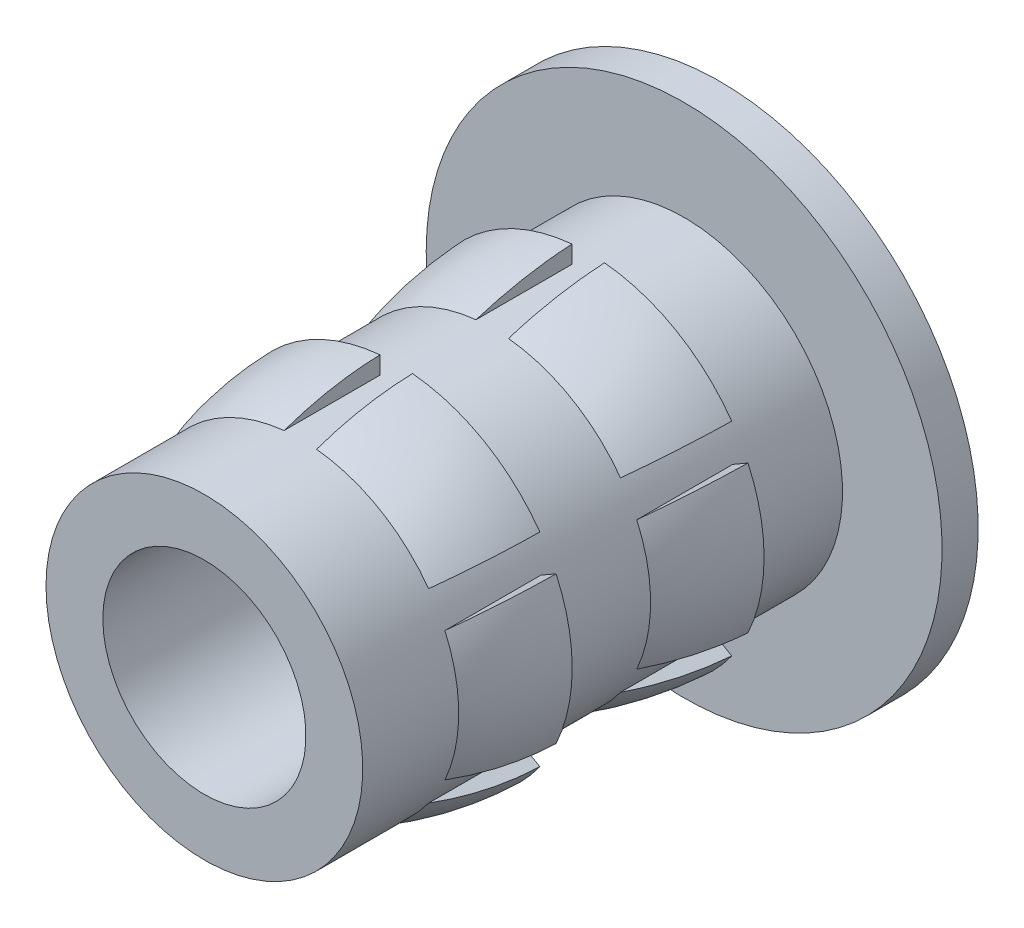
ISO-10303-21;
HEADER;
FILE_DESCRIPTION(('STEP AP214'),'2;1');
FILE_NAME('part.step','',(''),(''),'','','');
FILE_SCHEMA(('AUTOMOTIVE_DESIGN { 1 0 10303 214 1 1 1 1 }'));
ENDSEC;
DATA;
#1=APPLICATION_CONTEXT('core data for automotive mechanical design processes');
#2=APPLICATION_PROTOCOL_DEFINITION('international standard','automotive_design',2000,#1);
#3=PRODUCT_CONTEXT('',#1,'mechanical');
#4=PRODUCT('Part','Part','',(#3));
#5=PRODUCT_RELATED_PRODUCT_CATEGORY('part','',(#4));
#6=PRODUCT_DEFINITION_FORMATION('','',#4);
#7=PRODUCT_DEFINITION_CONTEXT('part definition',#1,'design');
#8=PRODUCT_DEFINITION('design','',#6,#7);
#9=PRODUCT_DEFINITION_SHAPE('','',#8);
#10=(LENGTH_UNIT() NAMED_UNIT(*) SI_UNIT(.MILLI.,.METRE.));
#11=(NAMED_UNIT(*) PLANE_ANGLE_UNIT() SI_UNIT($,.RADIAN.));
#12=(NAMED_UNIT(*) SI_UNIT($,.STERADIAN.) SOLID_ANGLE_UNIT());
#13=UNCERTAINTY_MEASURE_WITH_UNIT(LENGTH_MEASURE(1.E-05),#10,'distance_accuracy_value','');
#14=(GEOMETRIC_REPRESENTATION_CONTEXT(3) GLOBAL_UNCERTAINTY_ASSIGNED_CONTEXT((#13)) GLOBAL_UNIT_ASSIGNED_CONTEXT((#10,
#11,#12)) REPRESENTATION_CONTEXT('',''));
#15=CARTESIAN_POINT('',(0.,0.,0.));
#16=DIRECTION('',(0.,0.,1.));
#17=DIRECTION('',(1.,0.,0.));
#18=AXIS2_PLACEMENT_3D('',#15,#16,#17);
#19=CARTESIAN_POINT('',(11.03324757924,0.,-18.6426107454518));
#20=DIRECTION('',(0.,0.,1.));
#21=DIRECTION('',(1.,0.,0.));
#22=AXIS2_PLACEMENT_3D('',#19,#20,#21);
#23=PLANE('',#22);
#24=CARTESIAN_POINT('',(7.13434757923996,0.,-18.6426107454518));
#25=DIRECTION('',(0.,0.,-1.));
#26=DIRECTION('',(-1.,0.,0.));
#27=AXIS2_PLACEMENT_3D('',#24,#25,#26);
#28=CIRCLE('',#27,4.3307);
#29=CARTESIAN_POINT('',(3.19988351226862,-1.80968367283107,-18.6426107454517));
#30=VERTEX_POINT('',#29);
#31=CARTESIAN_POINT('',(3.19988351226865,1.80968367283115,-18.6426107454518));
#32=VERTEX_POINT('',#31);
#33=EDGE_CURVE('E547',#30,#32,#28,.T.);
#34=ORIENTED_EDGE('',*,*,#33,.T.);
#35=DIRECTION('',(0.866025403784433,-0.50000000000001,0.));
#36=VECTOR('',#35,1.);
#37=CARTESIAN_POINT('',(9.85852257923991,-2.03468338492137,-18.6426107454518));
#38=LINE('',#37,#36);
#39=CARTESIAN_POINT('',(3.57561777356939,1.5927533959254,-18.6426107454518));
#40=VERTEX_POINT('',#39);
#41=EDGE_CURVE('E814',#32,#40,#38,.T.);
#42=ORIENTED_EDGE('',*,*,#41,.T.);
#43=CARTESIAN_POINT('',(7.13434757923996,0.,-18.6426107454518));
#44=DIRECTION('',(0.,0.,-1.));
#45=DIRECTION('',(-1.,0.,0.));
#46=AXIS2_PLACEMENT_3D('',#43,#44,#45);
#47=CIRCLE('',#46,3.8989);
#48=CARTESIAN_POINT('',(3.57561777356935,-1.59275339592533,-18.6426107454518));
#49=VERTEX_POINT('',#48);
#50=EDGE_CURVE('E295',#49,#40,#47,.T.);
#51=ORIENTED_EDGE('',*,*,#50,.F.);
#52=DIRECTION('',(-0.866025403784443,-0.499999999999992,0.));
#53=VECTOR('',#52,1.);
#54=CARTESIAN_POINT('',(9.85852257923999,2.03468338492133,-18.6426107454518));
#55=LINE('',#54,#53);
#56=EDGE_CURVE('E825',#49,#30,#55,.T.);
#57=ORIENTED_EDGE('',*,*,#56,.T.);
#58=EDGE_LOOP('',(#34,#42,#51,#57));
#59=FACE_BOUND('',#58,.T.);
#60=ADVANCED_FACE('F41',(#59),#23,.F.);
#61=CARTESIAN_POINT('',(7.13434757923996,0.,-19.2037723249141));
#62=DIRECTION('',(0.,0.,-1.));
#63=DIRECTION('',(-1.,0.,0.));
#64=AXIS2_PLACEMENT_3D('',#61,#62,#63);
#65=DEGENERATE_TOROIDAL_SURFACE('',#64,5.41639569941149,9.76323598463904,.F.);
#66=CARTESIAN_POINT('',(7.13434757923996,0.,-16.2804107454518));
#67=DIRECTION('',(0.,0.,-1.));
#68=DIRECTION('',(-1.,0.,0.));
#69=AXIS2_PLACEMENT_3D('',#66,#67,#68);
#70=CIRCLE('',#69,3.8989);
#71=CARTESIAN_POINT('',(3.57561777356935,-1.59275339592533,-16.2804107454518));
#72=VERTEX_POINT('',#71);
#73=CARTESIAN_POINT('',(3.57561777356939,1.5927533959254,-16.2804107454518));
#74=VERTEX_POINT('',#73);
#75=EDGE_CURVE('E550',#72,#74,#70,.T.);
#76=ORIENTED_EDGE('',*,*,#75,.T.);
#77=CARTESIAN_POINT('',(3.57567241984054,1.59272184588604,-16.2802107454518));
#78=CARTESIAN_POINT('',(3.52327017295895,1.62297629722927,-16.471966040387));
#79=CARTESIAN_POINT('',(3.47604233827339,1.65024330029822,-16.6656048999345));
#80=CARTESIAN_POINT('',(3.39224170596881,1.69862561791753,-17.0551464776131));
#81=CARTESIAN_POINT('',(3.35562885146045,1.71976405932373,-17.2510377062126));
#82=CARTESIAN_POINT('',(3.2929615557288,1.75594503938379,-17.6450587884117));
#83=CARTESIAN_POINT('',(3.26690710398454,1.77098758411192,-17.8431886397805));
#84=CARTESIAN_POINT('',(3.22536331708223,1.79497290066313,-18.2416915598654));
#85=CARTESIAN_POINT('',(3.20991492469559,1.80389203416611,-18.4420703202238));
#86=CARTESIAN_POINT('',(3.19987349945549,1.80968945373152,-18.6428107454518));
#87=B_SPLINE_CURVE_WITH_KNOTS('',3,(#77,#78,#79,#80,#81,#82,#83,#84,#85,#86),.UNSPECIFIED.,.F.,
.F.,(4,2,2,2,4),(0.,0.603127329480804,1.2039481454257,1.80476836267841,2.40789508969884),.UNSPECIFIED.);
#88=EDGE_CURVE('E818',#74,#32,#87,.T.);
#89=ORIENTED_EDGE('',*,*,#88,.T.);
#90=ORIENTED_EDGE('',*,*,#33,.F.);
#91=CARTESIAN_POINT('',(3.19987349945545,-1.80968945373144,-18.6428107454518));
#92=CARTESIAN_POINT('',(3.20991492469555,-1.80389203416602,-18.4420703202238));
#93=CARTESIAN_POINT('',(3.22536331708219,-1.79497290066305,-18.2416915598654));
#94=CARTESIAN_POINT('',(3.2669071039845,-1.77098758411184,-17.8431886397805));
#95=CARTESIAN_POINT('',(3.29296155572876,-1.75594503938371,-17.6450587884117));
#96=CARTESIAN_POINT('',(3.35562885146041,-1.71976405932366,-17.2510377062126));
#97=CARTESIAN_POINT('',(3.39224170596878,-1.69862561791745,-17.0551464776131));
#98=CARTESIAN_POINT('',(3.47604233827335,-1.65024330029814,-16.6656048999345));
#99=CARTESIAN_POINT('',(3.52327017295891,-1.62297629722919,-16.471966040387));
#100=CARTESIAN_POINT('',(3.57567241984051,-1.59272184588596,-16.2802107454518));
#101=B_SPLINE_CURVE_WITH_KNOTS('',3,(#91,#92,#93,#94,#95,#96,#97,#98,#99,#100),.UNSPECIFIED.,
.F.,.F.,(4,2,2,2,4),(0.,0.603126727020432,1.20394694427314,1.80476776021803,2.40789508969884),.UNSPECIFIED.);
#102=EDGE_CURVE('E467',#30,#72,#101,.T.);
#103=ORIENTED_EDGE('',*,*,#102,.T.);
#104=EDGE_LOOP('',(#76,#89,#90,#103));
#105=FACE_BOUND('',#104,.T.);
#106=ADVANCED_FACE('F402',(#105),#65,.F.);
#107=CARTESIAN_POINT('',(11.03324757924,0.,-13.9182107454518));
#108=DIRECTION('',(0.,0.,1.));
#109=DIRECTION('',(1.,0.,0.));
#110=AXIS2_PLACEMENT_3D('',#107,#108,#109);
#111=PLANE('',#110);
#112=CARTESIAN_POINT('',(7.13434757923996,0.,-13.9182107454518));
#113=DIRECTION('',(0.,0.,-1.));
#114=DIRECTION('',(-1.,0.,0.));
#115=AXIS2_PLACEMENT_3D('',#112,#113,#114);
#116=CIRCLE('',#115,4.3307);
#117=CARTESIAN_POINT('',(3.19988351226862,-1.80968367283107,-13.9182107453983));
#118=VERTEX_POINT('',#117);
#119=CARTESIAN_POINT('',(3.19988351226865,1.80968367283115,-13.9182107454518));
#120=VERTEX_POINT('',#119);
#121=EDGE_CURVE('E785',#118,#120,#116,.T.);
#122=ORIENTED_EDGE('',*,*,#121,.T.);
#123=DIRECTION('',(0.866025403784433,-0.50000000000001,0.));
#124=VECTOR('',#123,1.);
#125=CARTESIAN_POINT('',(9.85852257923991,-2.03468338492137,-13.9182107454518));
#126=LINE('',#125,#124);
#127=CARTESIAN_POINT('',(3.57561777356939,1.5927533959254,-13.9182107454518));
#128=VERTEX_POINT('',#127);
#129=EDGE_CURVE('E1232',#120,#128,#126,.T.);
#130=ORIENTED_EDGE('',*,*,#129,.T.);
#131=CARTESIAN_POINT('',(7.13434757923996,0.,-13.9182107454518));
#132=DIRECTION('',(0.,0.,-1.));
#133=DIRECTION('',(-1.,0.,0.));
#134=AXIS2_PLACEMENT_3D('',#131,#132,#133);
#135=CIRCLE('',#134,3.8989);
#136=CARTESIAN_POINT('',(3.57561777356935,-1.59275339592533,-13.9182107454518));
#137=VERTEX_POINT('',#136);
#138=EDGE_CURVE('E736',#137,#128,#135,.T.);
#139=ORIENTED_EDGE('',*,*,#138,.F.);
#140=DIRECTION('',(-0.866025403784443,-0.499999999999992,0.));
#141=VECTOR('',#140,1.);
#142=CARTESIAN_POINT('',(9.85852257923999,2.03468338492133,-13.9182107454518));
#143=LINE('',#142,#141);
#144=EDGE_CURVE('E812',#137,#118,#143,.T.);
#145=ORIENTED_EDGE('',*,*,#144,.T.);
#146=EDGE_LOOP('',(#122,#130,#139,#145));
#147=FACE_BOUND('',#146,.T.);
#148=ADVANCED_FACE('F656',(#147),#111,.F.);
#149=CARTESIAN_POINT('',(7.13434757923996,0.,-14.1288940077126));
#150=DIRECTION('',(0.,0.,-1.));
#151=DIRECTION('',(-1.,0.,0.));
#152=AXIS2_PLACEMENT_3D('',#149,#150,#151);
#153=DEGENERATE_TOROIDAL_SURFACE('',#152,3.49907314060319,7.83260715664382,.F.);
#154=CARTESIAN_POINT('',(7.13434757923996,0.,-11.5560107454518));
#155=DIRECTION('',(0.,0.,-1.));
#156=DIRECTION('',(-1.,0.,0.));
#157=AXIS2_PLACEMENT_3D('',#154,#155,#156);
#158=CIRCLE('',#157,3.8989);
#159=CARTESIAN_POINT('',(3.57561777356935,-1.59275339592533,-11.5560107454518));
#160=VERTEX_POINT('',#159);
#161=CARTESIAN_POINT('',(3.57561777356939,1.5927533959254,-11.5560107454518));
#162=VERTEX_POINT('',#161);
#163=EDGE_CURVE('E712',#160,#162,#158,.T.);
#164=ORIENTED_EDGE('',*,*,#163,.T.);
#165=CARTESIAN_POINT('',(3.57567833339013,1.59271843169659,-11.5558107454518));
#166=CARTESIAN_POINT('',(3.51804652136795,1.62599217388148,-11.7460876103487));
#167=CARTESIAN_POINT('',(3.46683793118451,1.65555746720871,-11.9389545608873));
#168=CARTESIAN_POINT('',(3.37777548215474,1.70697769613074,-12.3275302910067));
#169=CARTESIAN_POINT('',(3.3398440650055,1.7288774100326,-12.5232153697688));
#170=CARTESIAN_POINT('',(3.27715399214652,1.76507154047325,-12.9173784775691));
#171=CARTESIAN_POINT('',(3.25239532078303,1.77936596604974,-13.1158565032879));
#172=CARTESIAN_POINT('',(3.21606696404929,1.80034015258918,-13.5156155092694));
#173=CARTESIAN_POINT('',(3.20457701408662,1.8069738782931,-13.7169061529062));
#174=CARTESIAN_POINT('',(3.19987883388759,1.80968637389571,-13.9184107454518));
#175=B_SPLINE_CURVE_WITH_KNOTS('',3,(#165,#166,#167,#168,#169,#170,#171,#172,#173,#174),
.UNSPECIFIED.,.F.,.F.,(4,2,2,2,4),(0.,0.604577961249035,1.20556292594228,1.80654717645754,
2.41112441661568),.UNSPECIFIED.);
#176=EDGE_CURVE('E279',#162,#120,#175,.T.);
#177=ORIENTED_EDGE('',*,*,#176,.T.);
#178=ORIENTED_EDGE('',*,*,#121,.F.);
#179=CARTESIAN_POINT('',(3.19987883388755,-1.80968637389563,-13.9184107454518));
#180=CARTESIAN_POINT('',(3.20457701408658,-1.80697387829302,-13.7169061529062));
#181=CARTESIAN_POINT('',(3.21606696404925,-1.8003401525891,-13.5156155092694));
#182=CARTESIAN_POINT('',(3.25239532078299,-1.77936596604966,-13.1158565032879));
#183=CARTESIAN_POINT('',(3.27715399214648,-1.76507154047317,-12.9173784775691));
#184=CARTESIAN_POINT('',(3.33984406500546,-1.72887741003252,-12.5232153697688));
#185=CARTESIAN_POINT('',(3.37777548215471,-1.70697769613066,-12.3275302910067));
#186=CARTESIAN_POINT('',(3.46683793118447,-1.65555746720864,-11.9389545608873));
#187=CARTESIAN_POINT('',(3.51804652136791,-1.62599217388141,-11.7460876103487));
#188=CARTESIAN_POINT('',(3.5756783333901,-1.59271843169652,-11.5558107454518));
#189=B_SPLINE_CURVE_WITH_KNOTS('',3,(#179,#180,#181,#182,#183,#184,#185,#186,#187,#188),
.UNSPECIFIED.,.F.,.F.,(4,2,2,2,4),(0.,0.604577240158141,1.2055614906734,1.80654645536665,
2.41112441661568),.UNSPECIFIED.);
#190=EDGE_CURVE('E715',#118,#160,#189,.T.);
#191=ORIENTED_EDGE('',*,*,#190,.T.);
#192=EDGE_LOOP('',(#164,#177,#178,#191));
#193=FACE_BOUND('',#192,.T.);
#194=ADVANCED_FACE('F649',(#193),#153,.F.);
#195=CARTESIAN_POINT('',(6.73434757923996,-4.31218766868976,-18.6426107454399));
#196=VERTEX_POINT('',#195);
#197=CARTESIAN_POINT('',(3.59988351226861,-2.50250399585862,-18.6426107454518));
#198=VERTEX_POINT('',#197);
#199=EDGE_CURVE('E342',#196,#198,#28,.T.);
#200=ORIENTED_EDGE('',*,*,#199,.T.);
#201=DIRECTION('',(0.866025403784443,0.499999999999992,0.));
#202=VECTOR('',#201,1.);
#203=CARTESIAN_POINT('',(10.25852257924,1.34186306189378,-18.6426107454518));
#204=LINE('',#203,#202);
#205=CARTESIAN_POINT('',(3.97561777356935,-2.28557371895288,-18.6426107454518));
#206=VERTEX_POINT('',#205);
#207=EDGE_CURVE('E341',#198,#206,#204,.T.);
#208=ORIENTED_EDGE('',*,*,#207,.T.);
#209=CARTESIAN_POINT('',(6.73434757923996,-3.87832711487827,-18.6426107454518));
#210=VERTEX_POINT('',#209);
#211=EDGE_CURVE('E300',#210,#206,#47,.T.);
#212=ORIENTED_EDGE('',*,*,#211,.F.);
#213=DIRECTION('',(0.,-1.,0.));
#214=VECTOR('',#213,1.);
#215=CARTESIAN_POINT('',(6.73434757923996,0.,-18.6426107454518));
#216=LINE('',#215,#214);
#217=EDGE_CURVE('E339',#210,#196,#216,.T.);
#218=ORIENTED_EDGE('',*,*,#217,.T.);
#219=EDGE_LOOP('',(#200,#208,#212,#218));
#220=FACE_BOUND('',#219,.T.);
#221=ADVANCED_FACE('F338',(#220),#23,.F.);
#222=CARTESIAN_POINT('',(6.73434757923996,-3.87832711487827,-16.2804107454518));
#223=VERTEX_POINT('',#222);
#224=CARTESIAN_POINT('',(3.97561777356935,-2.28557371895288,-16.2804107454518));
#225=VERTEX_POINT('',#224);
#226=EDGE_CURVE('E554',#223,#225,#70,.T.);
#227=ORIENTED_EDGE('',*,*,#226,.T.);
#228=CARTESIAN_POINT('',(3.9756724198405,-2.28554216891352,-16.2802107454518));
#229=CARTESIAN_POINT('',(3.92327017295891,-2.31579662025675,-16.471966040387));
#230=CARTESIAN_POINT('',(3.87604233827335,-2.3430636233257,-16.6656048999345));
#231=CARTESIAN_POINT('',(3.79224170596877,-2.39144594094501,-17.0551464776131));
#232=CARTESIAN_POINT('',(3.75562885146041,-2.41258438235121,-17.2510377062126));
#233=CARTESIAN_POINT('',(3.69296155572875,-2.44876536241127,-17.6450587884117));
#234=CARTESIAN_POINT('',(3.6669071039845,-2.4638079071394,-17.8431886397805));
#235=CARTESIAN_POINT('',(3.62536331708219,-2.48779322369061,-18.2416915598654));
#236=CARTESIAN_POINT('',(3.60991492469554,-2.49671235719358,-18.4420703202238));
#237=CARTESIAN_POINT('',(3.59987349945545,-2.502509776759,-18.6428107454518));
#238=B_SPLINE_CURVE_WITH_KNOTS('',3,(#228,#229,#230,#231,#232,#233,#234,#235,#236,#237),
.UNSPECIFIED.,.F.,.F.,(4,2,2,2,4),(0.,0.603127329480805,1.2039481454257,1.80476836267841,
2.40789508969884),.UNSPECIFIED.);
#239=EDGE_CURVE('E346',#225,#198,#238,.T.);
#240=ORIENTED_EDGE('',*,*,#239,.T.);
#241=ORIENTED_EDGE('',*,*,#199,.F.);
#242=CARTESIAN_POINT('',(6.73434757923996,-4.16853028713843,-17.4480529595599));
#243=CARTESIAN_POINT('',(6.73434757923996,-4.11936274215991,-17.1803347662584));
#244=CARTESIAN_POINT('',(6.73434757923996,-4.0589331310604,-16.9146496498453));
#245=CARTESIAN_POINT('',(6.73434757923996,-3.91593407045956,-16.3891799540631));
#246=CARTESIAN_POINT('',(6.73434757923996,-3.83335342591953,-16.1293984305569));
#247=CARTESIAN_POINT('',(6.73434757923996,-3.64620373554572,-15.6165615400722));
#248=CARTESIAN_POINT('',(6.73434757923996,-3.54153839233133,-15.363541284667));
#249=CARTESIAN_POINT('',(6.73434757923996,-3.31117898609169,-14.867353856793));
#250=CARTESIAN_POINT('',(6.73434757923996,-3.18549149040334,-14.6241836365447));
#251=CARTESIAN_POINT('',(6.73434757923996,-2.91375558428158,-14.1491857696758));
#252=CARTESIAN_POINT('',(6.73434757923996,-2.76768701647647,-13.9173696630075));
#253=CARTESIAN_POINT('',(6.73434757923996,-2.45604318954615,-13.4669402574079));
#254=CARTESIAN_POINT('',(6.73434757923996,-2.29045453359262,-13.248336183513));
#255=CARTESIAN_POINT('',(6.73434757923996,-2.02881489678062,-12.9327512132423));
#256=CARTESIAN_POINT('',(6.73434757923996,-1.93971625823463,-12.8299374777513));
#257=CARTESIAN_POINT('',(6.73434757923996,-1.75699031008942,-12.6283676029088));
#258=CARTESIAN_POINT('',(6.73434757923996,-1.66336228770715,-12.5296121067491));
#259=CARTESIAN_POINT('',(6.73434757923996,-1.47173023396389,-12.3367071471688));
#260=CARTESIAN_POINT('',(6.73434757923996,-1.37373219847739,-12.2425517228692));
#261=CARTESIAN_POINT('',(6.73434757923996,-1.17312488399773,-12.0593215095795));
#262=CARTESIAN_POINT('',(6.73434757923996,-1.07051748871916,-11.9702446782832));
#263=CARTESIAN_POINT('',(6.73434757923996,-0.93517045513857,-11.8598797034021));
#264=CARTESIAN_POINT('',(6.73434757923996,-0.90485552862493,-11.8356025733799));
#265=CARTESIAN_POINT('',(6.73434757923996,-0.843747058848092,-11.7876597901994));
#266=CARTESIAN_POINT('',(6.73434757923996,-0.812953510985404,-11.7639941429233));
#267=CARTESIAN_POINT('',(6.73434757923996,-0.719513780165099,-11.6938126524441));
#268=CARTESIAN_POINT('',(6.73434757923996,-0.65607257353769,-11.6483295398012));
#269=CARTESIAN_POINT('',(6.73434757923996,-0.55844889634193,-11.583117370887));
#270=CARTESIAN_POINT('',(6.73434757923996,-0.525335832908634,-11.5617890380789));
#271=CARTESIAN_POINT('',(6.73434757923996,-0.458184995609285,-11.5206510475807));
#272=CARTESIAN_POINT('',(6.73434757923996,-0.424147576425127,-11.5008408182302));
#273=CARTESIAN_POINT('',(6.73434757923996,-0.355035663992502,-11.4635302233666));
#274=CARTESIAN_POINT('',(6.73434757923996,-0.319967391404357,-11.4460185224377));
#275=CARTESIAN_POINT('',(6.73434757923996,-0.24832415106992,-11.4144915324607));
#276=CARTESIAN_POINT('',(6.73434757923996,-0.211752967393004,-11.4004680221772));
#277=CARTESIAN_POINT('',(6.73434757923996,-0.142382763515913,-11.379729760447));
#278=CARTESIAN_POINT('',(6.73434757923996,-0.109828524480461,-11.3722395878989));
#279=CARTESIAN_POINT('',(6.73434757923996,-0.0440189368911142,-11.3630361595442));
#280=CARTESIAN_POINT('',(6.73434757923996,-0.0107680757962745,-11.3612932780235));
#281=CARTESIAN_POINT('',(6.73434757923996,0.0554783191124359,-11.3640249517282));
#282=CARTESIAN_POINT('',(6.73434757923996,0.0884737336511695,-11.3685022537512));
#283=CARTESIAN_POINT('',(6.73434757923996,0.13717317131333,-11.378987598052));
#284=CARTESIAN_POINT('',(6.73434757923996,0.153323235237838,-11.3831298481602));
#285=CARTESIAN_POINT('',(6.73434757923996,0.1853166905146,-11.392469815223));
#286=CARTESIAN_POINT('',(6.73434757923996,0.201160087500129,-11.3976675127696));
#287=CARTESIAN_POINT('',(6.73434757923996,0.263363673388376,-11.4199635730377));
#288=CARTESIAN_POINT('',(6.73434757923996,0.308520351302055,-11.4403788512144));
#289=CARTESIAN_POINT('',(6.73434757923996,0.396793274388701,-11.4852580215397));
#290=CARTESIAN_POINT('',(6.73434757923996,0.439903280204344,-11.5097333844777));
#291=CARTESIAN_POINT('',(6.73434757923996,0.524934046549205,-11.5613170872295));
#292=CARTESIAN_POINT('',(6.73434757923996,0.566844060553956,-11.5884430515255));
#293=CARTESIAN_POINT('',(6.73434757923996,0.64945204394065,-11.6443383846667));
#294=CARTESIAN_POINT('',(6.73434757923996,0.690151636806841,-11.6731053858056));
#295=CARTESIAN_POINT('',(6.73434757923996,0.77196869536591,-11.7328885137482));
#296=CARTESIAN_POINT('',(6.73434757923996,0.813054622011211,-11.7639476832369));
#297=CARTESIAN_POINT('',(6.73434757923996,0.894376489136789,-11.82716183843));
#298=CARTESIAN_POINT('',(6.73434757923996,0.934612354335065,-11.8593169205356));
#299=CARTESIAN_POINT('',(6.73434757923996,1.05420261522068,-11.9572012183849));
#300=CARTESIAN_POINT('',(6.73434757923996,1.13241403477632,-12.024330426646));
#301=CARTESIAN_POINT('',(6.73434757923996,1.28624711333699,-12.1617501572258));
#302=CARTESIAN_POINT('',(6.73434757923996,1.3618638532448,-12.2320461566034));
#303=CARTESIAN_POINT('',(6.73434757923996,1.51045638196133,-12.3753398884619));
#304=CARTESIAN_POINT('',(6.73434757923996,1.58343267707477,-12.4483370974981));
#305=CARTESIAN_POINT('',(6.73434757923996,1.79803575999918,-12.6706039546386));
#306=CARTESIAN_POINT('',(6.73434757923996,1.93583620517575,-12.8235990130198));
#307=CARTESIAN_POINT('',(6.73434757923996,2.20088057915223,-13.1382093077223));
#308=CARTESIAN_POINT('',(6.73434757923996,2.32813308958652,-13.2998173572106));
#309=CARTESIAN_POINT('',(6.73434757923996,2.61027702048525,-13.6831144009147));
#310=CARTESIAN_POINT('',(6.73434757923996,2.76125708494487,-13.9077004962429));
#311=CARTESIAN_POINT('',(6.73434757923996,3.0438100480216,-14.3688970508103));
#312=CARTESIAN_POINT('',(6.73434757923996,3.1753728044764,-14.6055137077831));
#313=CARTESIAN_POINT('',(6.73434757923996,3.41826308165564,-15.0891029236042));
#314=CARTESIAN_POINT('',(6.73434757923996,3.52957794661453,-15.3360818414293));
#315=CARTESIAN_POINT('',(6.73434757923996,3.73112727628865,-15.8384479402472));
#316=CARTESIAN_POINT('',(6.73434757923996,3.82136506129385,-16.0938337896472));
#317=CARTESIAN_POINT('',(6.73434757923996,3.98027689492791,-16.6115474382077));
#318=CARTESIAN_POINT('',(6.73434757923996,4.04892621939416,-16.8738828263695));
#319=CARTESIAN_POINT('',(6.73434757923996,4.16408028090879,-17.4034638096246));
#320=CARTESIAN_POINT('',(6.73434757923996,4.21057737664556,-17.670711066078));
#321=CARTESIAN_POINT('',(6.73434757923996,4.28106417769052,-18.208048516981));
#322=CARTESIAN_POINT('',(6.73434757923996,4.30506288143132,-18.478137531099));
#323=CARTESIAN_POINT('',(6.73434757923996,4.33042295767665,-19.0193765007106));
#324=CARTESIAN_POINT('',(6.73434757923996,4.33178425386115,-19.2905264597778));
#325=CARTESIAN_POINT('',(6.73434757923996,4.31177832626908,-19.8342073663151));
#326=CARTESIAN_POINT('',(6.73434757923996,4.29022531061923,-20.1067314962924));
#327=CARTESIAN_POINT('',(6.73434757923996,4.22425903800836,-20.6489102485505));
#328=CARTESIAN_POINT('',(6.73434757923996,4.17985306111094,-20.9185657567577));
#329=CARTESIAN_POINT('',(6.73434757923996,4.0684380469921,-21.4534245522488));
#330=CARTESIAN_POINT('',(6.73434757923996,4.00140835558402,-21.7186235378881));
#331=CARTESIAN_POINT('',(6.73434757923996,3.84521672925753,-22.2424090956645));
#332=CARTESIAN_POINT('',(6.73434757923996,3.75605583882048,-22.5009959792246));
#333=CARTESIAN_POINT('',(6.73434757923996,3.55612101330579,-23.0099219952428));
#334=CARTESIAN_POINT('',(6.73434757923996,3.44532930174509,-23.2602541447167));
#335=CARTESIAN_POINT('',(6.73434757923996,3.20291998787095,-23.7506179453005));
#336=CARTESIAN_POINT('',(6.73434757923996,3.0713031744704,-23.9906499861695));
#337=CARTESIAN_POINT('',(6.73434757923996,2.78841539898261,-24.4580858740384));
#338=CARTESIAN_POINT('',(6.73434757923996,2.63718968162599,-24.6855171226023));
#339=CARTESIAN_POINT('',(6.73434757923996,2.31582306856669,-25.1264457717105));
#340=CARTESIAN_POINT('',(6.73434757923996,2.14569421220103,-25.3399519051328));
#341=CARTESIAN_POINT('',(6.73434757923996,1.87021592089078,-25.65593128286));
#342=CARTESIAN_POINT('',(6.73434757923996,1.77130618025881,-25.7640789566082));
#343=CARTESIAN_POINT('',(6.73434757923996,1.56825926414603,-25.9753955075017));
#344=CARTESIAN_POINT('',(6.73434757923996,1.4641217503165,-26.0785640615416));
#345=CARTESIAN_POINT('',(6.73434757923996,1.28151309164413,-26.2501122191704));
#346=CARTESIAN_POINT('',(6.73434757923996,1.20436147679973,-26.3199006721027));
#347=CARTESIAN_POINT('',(6.73434757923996,1.04733766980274,-26.4560708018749));
#348=CARTESIAN_POINT('',(6.73434757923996,0.96747072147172,-26.5224584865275));
#349=CARTESIAN_POINT('',(6.73434757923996,0.829045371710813,-26.631628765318));
#350=CARTESIAN_POINT('',(6.73434757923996,0.771337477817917,-26.6754843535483));
#351=CARTESIAN_POINT('',(6.73434757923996,0.683104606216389,-26.7393069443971));
#352=CARTESIAN_POINT('',(6.73434757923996,0.653329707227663,-26.7603101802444));
#353=CARTESIAN_POINT('',(6.73434757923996,0.593184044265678,-26.8014427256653));
#354=CARTESIAN_POINT('',(6.73434757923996,0.562813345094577,-26.8215721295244));
#355=CARTESIAN_POINT('',(6.73434757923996,0.500976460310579,-26.8609352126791));
#356=CARTESIAN_POINT('',(6.73434757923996,0.46950148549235,-26.8801551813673));
#357=CARTESIAN_POINT('',(6.73434757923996,0.405573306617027,-26.9170053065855));
#358=CARTESIAN_POINT('',(6.73434757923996,0.373119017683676,-26.9346336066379));
#359=CARTESIAN_POINT('',(6.73434757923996,0.307276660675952,-26.9673428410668));
#360=CARTESIAN_POINT('',(6.73434757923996,0.273899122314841,-26.982444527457));
#361=CARTESIAN_POINT('',(6.73434757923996,0.205725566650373,-27.0089034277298));
#362=CARTESIAN_POINT('',(6.73434757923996,0.170933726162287,-27.0202708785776));
#363=CARTESIAN_POINT('',(6.73434757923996,0.103993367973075,-27.0362672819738));
#364=CARTESIAN_POINT('',(6.73434757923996,0.0720043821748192,-27.0415234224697));
#365=CARTESIAN_POINT('',(6.73434757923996,0.00768561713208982,-27.0462362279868));
#366=CARTESIAN_POINT('',(6.73434757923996,-0.024642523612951,-27.0457136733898));
#367=CARTESIAN_POINT('',(6.73434757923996,-0.0964202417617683,-27.0382518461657));
#368=CARTESIAN_POINT('',(6.73434757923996,-0.135704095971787,-27.0297933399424));
#369=CARTESIAN_POINT('',(6.73434757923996,-0.193310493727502,-27.0125991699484));
#370=CARTESIAN_POINT('',(6.73434757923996,-0.21237583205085,-27.0060768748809));
#371=CARTESIAN_POINT('',(6.73434757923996,-0.250062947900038,-26.9918502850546));
#372=CARTESIAN_POINT('',(6.73434757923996,-0.268684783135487,-26.9841461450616));
#373=CARTESIAN_POINT('',(6.73434757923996,-0.317892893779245,-26.9623378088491));
#374=CARTESIAN_POINT('',(6.73434757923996,-0.348110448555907,-26.947411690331));
#375=CARTESIAN_POINT('',(6.73434757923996,-0.407643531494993,-26.9158429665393));
#376=CARTESIAN_POINT('',(6.73434757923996,-0.436958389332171,-26.8991991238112));
#377=CARTESIAN_POINT('',(6.73434757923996,-0.494919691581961,-26.8646590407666));
#378=CARTESIAN_POINT('',(6.73434757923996,-0.523564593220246,-26.8467602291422));
#379=CARTESIAN_POINT('',(6.73434757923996,-0.580260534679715,-26.8100423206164));
#380=CARTESIAN_POINT('',(6.73434757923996,-0.608311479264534,-26.7912230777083));
#381=CARTESIAN_POINT('',(6.73434757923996,-0.691922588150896,-26.7335486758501));
#382=CARTESIAN_POINT('',(6.73434757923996,-0.746732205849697,-26.6936054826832));
#383=CARTESIAN_POINT('',(6.73434757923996,-0.854713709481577,-26.6117415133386));
#384=CARTESIAN_POINT('',(6.73434757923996,-0.907887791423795,-26.5698235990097));
#385=CARTESIAN_POINT('',(6.73434757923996,-1.05149334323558,-26.4529562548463));
#386=CARTESIAN_POINT('',(6.73434757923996,-1.14059301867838,-26.3763667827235));
#387=CARTESIAN_POINT('',(6.73434757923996,-1.3152967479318,-26.2192791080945));
#388=CARTESIAN_POINT('',(6.73434757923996,-1.40089979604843,-26.1387797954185));
#389=CARTESIAN_POINT('',(6.73434757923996,-1.56885137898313,-25.9742117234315));
#390=CARTESIAN_POINT('',(6.73434757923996,-1.65119493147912,-25.8901378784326));
#391=CARTESIAN_POINT('',(6.73434757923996,-1.81250456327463,-25.7188403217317));
#392=CARTESIAN_POINT('',(6.73434757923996,-1.89147102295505,-25.6316169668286));
#393=CARTESIAN_POINT('',(6.73434757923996,-2.12280905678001,-25.366067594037));
#394=CARTESIAN_POINT('',(6.73434757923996,-2.27016279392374,-25.1833267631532));
#395=CARTESIAN_POINT('',(6.73434757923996,-2.55081456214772,-24.8075813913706));
#396=CARTESIAN_POINT('',(6.73434757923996,-2.68412170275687,-24.6145836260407));
#397=CARTESIAN_POINT('',(6.73434757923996,-2.9358361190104,-24.2199788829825));
#398=CARTESIAN_POINT('',(6.73434757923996,-3.05429023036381,-24.0184017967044));
#399=CARTESIAN_POINT('',(6.73434757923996,-3.27627116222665,-23.6071472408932));
#400=CARTESIAN_POINT('',(6.73434757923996,-3.37979528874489,-23.3974683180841));
#401=CARTESIAN_POINT('',(6.73434757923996,-3.57152296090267,-22.9708846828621));
#402=CARTESIAN_POINT('',(6.73434757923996,-3.65970611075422,-22.7539708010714));
#403=CARTESIAN_POINT('',(6.73434757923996,-3.8201494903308,-22.3143407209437));
#404=CARTESIAN_POINT('',(6.73434757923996,-3.89240971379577,-22.0916245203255));
#405=CARTESIAN_POINT('',(6.73434757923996,-4.03105116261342,-21.6050380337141));
#406=CARTESIAN_POINT('',(6.73434757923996,-4.09457972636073,-21.3403498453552));
#407=CARTESIAN_POINT('',(6.73434757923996,-4.1992116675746,-20.8065729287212));
#408=CARTESIAN_POINT('',(6.73434757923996,-4.24031389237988,-20.5374839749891));
#409=CARTESIAN_POINT('',(6.73434757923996,-4.29977071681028,-19.9972040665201));
#410=CARTESIAN_POINT('',(6.73434757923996,-4.31815837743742,-19.7260167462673));
#411=CARTESIAN_POINT('',(6.73434757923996,-4.33216347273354,-19.1831658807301));
#412=CARTESIAN_POINT('',(6.73434757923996,-4.32779166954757,-18.9115026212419));
#413=CARTESIAN_POINT('',(6.73434757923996,-4.30045913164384,-18.4404953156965));
#414=CARTESIAN_POINT('',(6.73434757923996,-4.28266416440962,-18.2408361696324));
#415=CARTESIAN_POINT('',(6.73434757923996,-4.23478413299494,-17.8431026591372));
#416=CARTESIAN_POINT('',(6.73434757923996,-4.20470547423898,-17.6450275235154));
#417=CARTESIAN_POINT('',(6.73434757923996,-4.16853028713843,-17.4480529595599));
#418=B_SPLINE_CURVE_WITH_KNOTS('',3,(#242,#243,#244,#245,#246,#247,#248,#249,#250,#251,#252,
#253,#254,#255,#256,#257,#258,#259,#260,#261,#262,#263,#264,#265,#266,#267,#268,#269,#270,#271,
#272,#273,#274,#275,#276,#277,#278,#279,#280,#281,#282,#283,#284,#285,#286,#287,#288,#289,#290,
#291,#292,#293,#294,#295,#296,#297,#298,#299,#300,#301,#302,#303,#304,#305,#306,#307,#308,#309,
#310,#311,#312,#313,#314,#315,#316,#317,#318,#319,#320,#321,#322,#323,#324,#325,#326,#327,#328,
#329,#330,#331,#332,#333,#334,#335,#336,#337,#338,#339,#340,#341,#342,#343,#344,#345,#346,#347,
#348,#349,#350,#351,#352,#353,#354,#355,#356,#357,#358,#359,#360,#361,#362,#363,#364,#365,#366,
#367,#368,#369,#370,#371,#372,#373,#374,#375,#376,#377,#378,#379,#380,#381,#382,#383,#384,#385,
#386,#387,#388,#389,#390,#391,#392,#393,#394,#395,#396,#397,#398,#399,#400,#401,#402,#403,#404,
#405,#406,#407,#408,#409,#410,#411,#412,#413,#414,#415,#416,#417),.UNSPECIFIED.,.T.,.F.,(4,2,2,
2,2,2,2,2,2,2,2,2,2,2,2,2,2,2,2,2,2,2,2,2,2,2,2,2,2,2,2,2,2,2,2,2,2,2,2,2,2,2,2,2,2,2,2,2,2,2,2,
2,2,2,2,2,2,2,2,2,2,2,2,2,2,2,2,2,2,2,2,2,2,2,2,2,2,2,2,2,2,2,2,2,2,2,2,4),(0.,
0.816406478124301,1.63322634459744,2.45368429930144,3.27388641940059,4.09490556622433,
4.91649150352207,5.32452888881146,5.73263069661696,6.14018883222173,6.54758189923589,
6.66408860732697,6.78059643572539,7.01463742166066,7.13277372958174,7.25086533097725,
7.36835072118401,7.4855565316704,7.58538259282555,7.68469326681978,7.78404780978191,
7.8340384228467,7.88402811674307,8.03223824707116,8.18087447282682,8.33057669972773,
8.48006814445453,8.63455865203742,8.78906278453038,9.09816679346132,9.40782763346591,
9.71742877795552,10.3346183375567,10.9513007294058,11.7621321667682,12.5733856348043,
13.3851444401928,14.1967752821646,15.0093322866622,15.8221693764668,16.6346812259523,
17.4471958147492,18.2663489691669,19.0852413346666,19.9048833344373,20.7244866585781,
21.5447664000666,22.3650150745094,23.1834037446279,24.0012741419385,24.440803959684,
24.8803622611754,25.1923877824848,25.5038415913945,25.7212189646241,25.8305193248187,
25.9398078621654,26.050412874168,26.1611452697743,26.2709180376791,26.3803873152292,
26.4771986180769,26.573661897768,26.6934221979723,26.7538509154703,26.8142717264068,
26.9152930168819,27.0163875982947,27.1176957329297,27.2190199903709,27.4224032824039,
27.6255003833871,27.9778242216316,28.3302486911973,28.6831925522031,29.0360965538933,
29.7396216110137,30.442687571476,31.1434776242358,31.8443939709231,32.5462351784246,
33.2480766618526,34.0637090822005,34.8793834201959,35.6938691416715,36.5079697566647,
37.1089565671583,37.7096303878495),.UNSPECIFIED.);
#419=EDGE_CURVE('E390',#196,#223,#418,.T.);
#420=ORIENTED_EDGE('',*,*,#419,.T.);
#421=EDGE_LOOP('',(#227,#240,#241,#420));
#422=FACE_BOUND('',#421,.T.);
#423=ADVANCED_FACE('F657',(#422),#65,.F.);
#424=CARTESIAN_POINT('',(6.73434757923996,-4.31218766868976,-13.9182107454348));
#425=VERTEX_POINT('',#424);
#426=CARTESIAN_POINT('',(3.59988351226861,-2.50250399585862,-13.9182107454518));
#427=VERTEX_POINT('',#426);
#428=EDGE_CURVE('E783',#425,#427,#116,.T.);
#429=ORIENTED_EDGE('',*,*,#428,.T.);
#430=DIRECTION('',(0.866025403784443,0.499999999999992,0.));
#431=VECTOR('',#430,1.);
#432=CARTESIAN_POINT('',(10.25852257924,1.34186306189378,-13.9182107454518));
#433=LINE('',#432,#431);
#434=CARTESIAN_POINT('',(3.97561777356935,-2.28557371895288,-13.9182107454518));
#435=VERTEX_POINT('',#434);
#436=EDGE_CURVE('E349',#427,#435,#433,.T.);
#437=ORIENTED_EDGE('',*,*,#436,.T.);
#438=CARTESIAN_POINT('',(6.73434757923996,-3.87832711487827,-13.9182107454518));
#439=VERTEX_POINT('',#438);
#440=EDGE_CURVE('E738',#439,#435,#135,.T.);
#441=ORIENTED_EDGE('',*,*,#440,.F.);
#442=DIRECTION('',(0.,-1.,0.));
#443=VECTOR('',#442,1.);
#444=CARTESIAN_POINT('',(6.73434757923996,0.,-13.9182107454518));
#445=LINE('',#444,#443);
#446=EDGE_CURVE('E369',#439,#425,#445,.T.);
#447=ORIENTED_EDGE('',*,*,#446,.T.);
#448=EDGE_LOOP('',(#429,#437,#441,#447));
#449=FACE_BOUND('',#448,.T.);
#450=ADVANCED_FACE('F695',(#449),#111,.F.);
#451=CARTESIAN_POINT('',(6.73434757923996,-3.87832711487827,-11.5560107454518));
#452=VERTEX_POINT('',#451);
#453=CARTESIAN_POINT('',(3.97561777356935,-2.28557371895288,-11.5560107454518));
#454=VERTEX_POINT('',#453);
#455=EDGE_CURVE('E718',#452,#454,#158,.T.);
#456=ORIENTED_EDGE('',*,*,#455,.T.);
#457=CARTESIAN_POINT('',(3.97567833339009,-2.28553875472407,-11.5558107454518));
#458=CARTESIAN_POINT('',(3.91804652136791,-2.31881249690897,-11.7460876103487));
#459=CARTESIAN_POINT('',(3.86683793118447,-2.3483777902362,-11.9389545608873));
#460=CARTESIAN_POINT('',(3.7777754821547,-2.39979801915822,-12.3275302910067));
#461=CARTESIAN_POINT('',(3.73984406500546,-2.42169773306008,-12.5232153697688));
#462=CARTESIAN_POINT('',(3.67715399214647,-2.45789186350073,-12.9173784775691));
#463=CARTESIAN_POINT('',(3.65239532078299,-2.47218628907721,-13.1158565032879));
#464=CARTESIAN_POINT('',(3.61606696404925,-2.49316047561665,-13.5156155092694));
#465=CARTESIAN_POINT('',(3.60457701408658,-2.49979420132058,-13.7169061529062));
#466=CARTESIAN_POINT('',(3.59987883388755,-2.50250669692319,-13.9184107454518));
#467=B_SPLINE_CURVE_WITH_KNOTS('',3,(#457,#458,#459,#460,#461,#462,#463,#464,#465,#466),
.UNSPECIFIED.,.F.,.F.,(4,2,2,2,4),(0.,0.604577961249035,1.20556292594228,1.80654717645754,
2.41112441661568),.UNSPECIFIED.);
#468=EDGE_CURVE('E828',#454,#427,#467,.T.);
#469=ORIENTED_EDGE('',*,*,#468,.T.);
#470=ORIENTED_EDGE('',*,*,#428,.F.);
#471=CARTESIAN_POINT('',(6.73434757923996,-4.18677036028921,-12.7203028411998));
#472=CARTESIAN_POINT('',(6.73434757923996,-4.14724292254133,-12.5050497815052));
#473=CARTESIAN_POINT('',(6.73434757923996,-4.0986521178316,-12.2915132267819));
#474=CARTESIAN_POINT('',(6.73434757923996,-3.98366145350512,-11.8692184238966));
#475=CARTESIAN_POINT('',(6.73434757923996,-3.9172582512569,-11.6604610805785));
#476=CARTESIAN_POINT('',(6.73434757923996,-3.7670014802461,-11.2489992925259));
#477=CARTESIAN_POINT('',(6.73434757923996,-3.68312359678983,-11.0463037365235));
#478=CARTESIAN_POINT('',(6.73434757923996,-3.49855144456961,-10.6487192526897));
#479=CARTESIAN_POINT('',(6.73434757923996,-3.39785738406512,-10.4538302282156));
#480=CARTESIAN_POINT('',(6.73434757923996,-3.18032476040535,-10.0732472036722));
#481=CARTESIAN_POINT('',(6.73434757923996,-3.06348411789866,-9.88755439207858));
#482=CARTESIAN_POINT('',(6.73434757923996,-2.81442363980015,-9.52672220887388));
#483=CARTESIAN_POINT('',(6.73434757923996,-2.68220062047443,-9.3515850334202));
#484=CARTESIAN_POINT('',(6.73434757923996,-2.40356320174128,-9.01364109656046));
#485=CARTESIAN_POINT('',(6.73434757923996,-2.2571805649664,-8.85080813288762));
#486=CARTESIAN_POINT('',(6.73434757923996,-1.95093077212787,-8.53850034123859));
#487=CARTESIAN_POINT('',(6.73434757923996,-1.79107250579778,-8.38901683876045));
#488=CARTESIAN_POINT('',(6.73434757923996,-1.52454954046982,-8.16144434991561));
#489=CARTESIAN_POINT('',(6.73434757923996,-1.42194275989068,-8.0785592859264));
#490=CARTESIAN_POINT('',(6.73434757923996,-1.21218164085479,-7.91890679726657));
#491=CARTESIAN_POINT('',(6.73434757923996,-1.10503178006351,-7.84213355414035));
#492=CARTESIAN_POINT('',(6.73434757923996,-0.950886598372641,-7.73932857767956));
#493=CARTESIAN_POINT('',(6.73434757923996,-0.905927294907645,-7.7102215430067));
#494=CARTESIAN_POINT('',(6.73434757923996,-0.815131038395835,-7.65341203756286));
#495=CARTESIAN_POINT('',(6.73434757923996,-0.769294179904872,-7.6257094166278));
#496=CARTESIAN_POINT('',(6.73434757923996,-0.676512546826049,-7.57193510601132));
#497=CARTESIAN_POINT('',(6.73434757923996,-0.629565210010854,-7.54586782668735));
#498=CARTESIAN_POINT('',(6.73434757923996,-0.534488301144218,-7.49599129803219));
#499=CARTESIAN_POINT('',(6.73434757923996,-0.486359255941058,-7.47218106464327));
#500=CARTESIAN_POINT('',(6.73434757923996,-0.412449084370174,-7.43877208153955));
#501=CARTESIAN_POINT('',(6.73434757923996,-0.387239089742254,-7.42791399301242));
#502=CARTESIAN_POINT('',(6.73434757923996,-0.336348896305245,-7.40737055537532));
#503=CARTESIAN_POINT('',(6.73434757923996,-0.310668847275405,-7.39768483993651));
#504=CARTESIAN_POINT('',(6.73434757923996,-0.258897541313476,-7.37991253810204));
#505=CARTESIAN_POINT('',(6.73434757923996,-0.232809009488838,-7.37181813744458));
#506=CARTESIAN_POINT('',(6.73434757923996,-0.180072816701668,-7.3576999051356));
#507=CARTESIAN_POINT('',(6.73434757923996,-0.153425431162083,-7.35167507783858));
#508=CARTESIAN_POINT('',(6.73434757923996,-0.105078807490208,-7.34325049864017));
#509=CARTESIAN_POINT('',(6.73434757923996,-0.0834657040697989,-7.34036465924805));
#510=CARTESIAN_POINT('',(6.73434757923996,-0.0400683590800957,-7.33655871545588));
#511=CARTESIAN_POINT('',(6.73434757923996,-0.0182841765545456,-7.33563796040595));
#512=CARTESIAN_POINT('',(6.73434757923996,0.0252724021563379,-7.33585629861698));
#513=CARTESIAN_POINT('',(6.73434757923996,0.0470447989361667,-7.33699527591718));
#514=CARTESIAN_POINT('',(6.73434757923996,0.0904010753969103,-7.34121583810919));
#515=CARTESIAN_POINT('',(6.73434757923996,0.111984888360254,-7.3442980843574));
#516=CARTESIAN_POINT('',(6.73434757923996,0.166639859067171,-7.35429592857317));
#517=CARTESIAN_POINT('',(6.73434757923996,0.199493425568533,-7.36238772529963));
#518=CARTESIAN_POINT('',(6.73434757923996,0.264350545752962,-7.38145374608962));
#519=CARTESIAN_POINT('',(6.73434757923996,0.296353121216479,-7.39243114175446));
#520=CARTESIAN_POINT('',(6.73434757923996,0.359863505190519,-7.41648350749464));
#521=CARTESIAN_POINT('',(6.73434757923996,0.391364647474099,-7.42957578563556));
#522=CARTESIAN_POINT('',(6.73434757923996,0.453696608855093,-7.45721040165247));
#523=CARTESIAN_POINT('',(6.73434757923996,0.484527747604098,-7.47175202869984));
#524=CARTESIAN_POINT('',(6.73434757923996,0.577785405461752,-7.51777199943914));
#525=CARTESIAN_POINT('',(6.73434757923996,0.639353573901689,-7.55098444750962));
#526=CARTESIAN_POINT('',(6.73434757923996,0.760799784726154,-7.62038880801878));
#527=CARTESIAN_POINT('',(6.73434757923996,0.82067681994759,-7.65658244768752));
#528=CARTESIAN_POINT('',(6.73434757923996,0.939060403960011,-7.7313685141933));
#529=CARTESIAN_POINT('',(6.73434757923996,0.99756433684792,-7.76996507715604));
#530=CARTESIAN_POINT('',(6.73434757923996,1.11318412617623,-7.8491424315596));
#531=CARTESIAN_POINT('',(6.73434757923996,1.1703003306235,-7.88972271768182));
#532=CARTESIAN_POINT('',(6.73434757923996,1.33955154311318,-8.01406460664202));
#533=CARTESIAN_POINT('',(6.73434757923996,1.44972565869,-8.10051477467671));
#534=CARTESIAN_POINT('',(6.73434757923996,1.66471957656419,-8.27959145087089));
#535=CARTESIAN_POINT('',(6.73434757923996,1.76954428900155,-8.3722121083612));
#536=CARTESIAN_POINT('',(6.73434757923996,2.02834462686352,-8.61420112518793));
#537=CARTESIAN_POINT('',(6.73434757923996,2.17869694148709,-8.76747585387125));
#538=CARTESIAN_POINT('',(6.73434757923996,2.46603915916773,-9.08622645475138));
#539=CARTESIAN_POINT('',(6.73434757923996,2.60301978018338,-9.25171066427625));
#540=CARTESIAN_POINT('',(6.73434757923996,2.86259212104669,-9.59339649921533));
#541=CARTESIAN_POINT('',(6.73434757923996,2.98519537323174,-9.76958936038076));
#542=CARTESIAN_POINT('',(6.73434757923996,3.21533683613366,-10.131495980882));
#543=CARTESIAN_POINT('',(6.73434757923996,3.32287827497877,-10.3172076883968));
#544=CARTESIAN_POINT('',(6.73434757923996,3.52272134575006,-10.6978186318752));
#545=CARTESIAN_POINT('',(6.73434757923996,3.61494582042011,-10.892758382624));
#546=CARTESIAN_POINT('',(6.73434757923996,3.78293212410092,-11.2896887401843));
#547=CARTESIAN_POINT('',(6.73434757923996,3.85868797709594,-11.4916818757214));
#548=CARTESIAN_POINT('',(6.73434757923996,3.99320470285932,-11.9012995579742));
#549=CARTESIAN_POINT('',(6.73434757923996,4.05196179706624,-12.1089253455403));
#550=CARTESIAN_POINT('',(6.73434757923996,4.15208345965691,-12.5284101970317));
#551=CARTESIAN_POINT('',(6.73434757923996,4.19344149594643,-12.7402708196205));
#552=CARTESIAN_POINT('',(6.73434757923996,4.25894171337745,-13.1698839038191));
#553=CARTESIAN_POINT('',(6.73434757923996,4.28281707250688,-13.3876770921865));
#554=CARTESIAN_POINT('',(6.73434757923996,4.31217206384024,-13.8245989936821));
#555=CARTESIAN_POINT('',(6.73434757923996,4.31764327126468,-14.043728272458));
#556=CARTESIAN_POINT('',(6.73434757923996,4.31013005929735,-14.4815873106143));
#557=CARTESIAN_POINT('',(6.73434757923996,4.29715263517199,-14.700317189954));
#558=CARTESIAN_POINT('',(6.73434757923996,4.25285484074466,-15.1358112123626));
#559=CARTESIAN_POINT('',(6.73434757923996,4.22154278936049,-15.3525762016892));
#560=CARTESIAN_POINT('',(6.73434757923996,4.1407284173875,-15.7830819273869));
#561=CARTESIAN_POINT('',(6.73434757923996,4.09119434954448,-15.9968167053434));
#562=CARTESIAN_POINT('',(6.73434757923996,3.97430877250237,-16.4192714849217));
#563=CARTESIAN_POINT('',(6.73434757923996,3.90696393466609,-16.627993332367));
#564=CARTESIAN_POINT('',(6.73434757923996,3.75482118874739,-17.0392650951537));
#565=CARTESIAN_POINT('',(6.73434757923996,3.67000219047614,-17.2418072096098));
#566=CARTESIAN_POINT('',(6.73434757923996,3.48358067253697,-17.6389222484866));
#567=CARTESIAN_POINT('',(6.73434757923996,3.38198448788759,-17.8334981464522));
#568=CARTESIAN_POINT('',(6.73434757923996,3.16274048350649,-18.2132420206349));
#569=CARTESIAN_POINT('',(6.73434757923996,3.04510166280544,-18.3984151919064));
#570=CARTESIAN_POINT('',(6.73434757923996,2.79448969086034,-18.7581380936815));
#571=CARTESIAN_POINT('',(6.73434757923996,2.66151345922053,-18.9326856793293));
#572=CARTESIAN_POINT('',(6.73434757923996,2.38140985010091,-19.269395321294));
#573=CARTESIAN_POINT('',(6.73434757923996,2.23431336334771,-19.4315830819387));
#574=CARTESIAN_POINT('',(6.73434757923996,1.92668354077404,-19.7425161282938));
#575=CARTESIAN_POINT('',(6.73434757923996,1.76615918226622,-19.8912702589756));
#576=CARTESIAN_POINT('',(6.73434757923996,1.49976154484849,-20.1166157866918));
#577=CARTESIAN_POINT('',(6.73434757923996,1.39799457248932,-20.1980913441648));
#578=CARTESIAN_POINT('',(6.73434757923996,1.2419924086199,-20.3157539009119));
#579=CARTESIAN_POINT('',(6.73434757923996,1.18945661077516,-20.3542005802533));
#580=CARTESIAN_POINT('',(6.73434757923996,1.08322742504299,-20.4294592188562));
#581=CARTESIAN_POINT('',(6.73434757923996,1.02953410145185,-20.4662712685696));
#582=CARTESIAN_POINT('',(6.73434757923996,0.930023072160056,-20.532045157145));
#583=CARTESIAN_POINT('',(6.73434757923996,0.884392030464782,-20.5612893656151));
#584=CARTESIAN_POINT('',(6.73434757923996,0.792218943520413,-20.6183036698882));
#585=CARTESIAN_POINT('',(6.73434757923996,0.745676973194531,-20.6460738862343));
#586=CARTESIAN_POINT('',(6.73434757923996,0.651398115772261,-20.6998866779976));
#587=CARTESIAN_POINT('',(6.73434757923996,0.603657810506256,-20.7259232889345));
#588=CARTESIAN_POINT('',(6.73434757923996,0.506917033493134,-20.7755272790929));
#589=CARTESIAN_POINT('',(6.73434757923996,0.457917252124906,-20.7990959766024));
#590=CARTESIAN_POINT('',(6.73434757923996,0.38325707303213,-20.8315156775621));
#591=CARTESIAN_POINT('',(6.73434757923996,0.35823332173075,-20.8418138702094));
#592=CARTESIAN_POINT('',(6.73434757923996,0.307705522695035,-20.8611465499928));
#593=CARTESIAN_POINT('',(6.73434757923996,0.282201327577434,-20.8701806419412));
#594=CARTESIAN_POINT('',(6.73434757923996,0.205221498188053,-20.8946320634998));
#595=CARTESIAN_POINT('',(6.73434757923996,0.152846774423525,-20.9076009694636));
#596=CARTESIAN_POINT('',(6.73434757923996,0.0778051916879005,-20.9180633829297));
#597=CARTESIAN_POINT('',(6.73434757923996,0.0557789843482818,-20.9201725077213));
#598=CARTESIAN_POINT('',(6.73434757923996,0.0116258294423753,-20.9222994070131));
#599=CARTESIAN_POINT('',(6.73434757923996,-0.0105010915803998,-20.922317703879));
#600=CARTESIAN_POINT('',(6.73434757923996,-0.0547143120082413,-20.9202580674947));
#601=CARTESIAN_POINT('',(6.73434757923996,-0.0768003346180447,-20.9181743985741));
#602=CARTESIAN_POINT('',(6.73434757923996,-0.12070926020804,-20.9121094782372));
#603=CARTESIAN_POINT('',(6.73434757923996,-0.142532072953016,-20.9081275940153));
#604=CARTESIAN_POINT('',(6.73434757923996,-0.210308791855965,-20.8932004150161));
#605=CARTESIAN_POINT('',(6.73434757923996,-0.255641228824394,-20.879472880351));
#606=CARTESIAN_POINT('',(6.73434757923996,-0.344777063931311,-20.8477093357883));
#607=CARTESIAN_POINT('',(6.73434757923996,-0.388576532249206,-20.8296630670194));
#608=CARTESIAN_POINT('',(6.73434757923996,-0.475431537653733,-20.7906741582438));
#609=CARTESIAN_POINT('',(6.73434757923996,-0.518473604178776,-20.7697018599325));
#610=CARTESIAN_POINT('',(6.73434757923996,-0.603515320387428,-20.7258829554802));
#611=CARTESIAN_POINT('',(6.73434757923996,-0.645516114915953,-20.7030385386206));
#612=CARTESIAN_POINT('',(6.73434757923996,-0.76198861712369,-20.6370648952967));
#613=CARTESIAN_POINT('',(6.73434757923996,-0.83555081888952,-20.5923309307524));
#614=CARTESIAN_POINT('',(6.73434757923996,-0.980511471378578,-20.4994634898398));
#615=CARTESIAN_POINT('',(6.73434757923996,-1.05190904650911,-20.4513286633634));
#616=CARTESIAN_POINT('',(6.73434757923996,-1.19278663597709,-20.3521021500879));
#617=CARTESIAN_POINT('',(6.73434757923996,-1.26226345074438,-20.3010059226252));
#618=CARTESIAN_POINT('',(6.73434757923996,-1.39921507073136,-20.1962324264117));
#619=CARTESIAN_POINT('',(6.73434757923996,-1.46669021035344,-20.1425555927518));
#620=CARTESIAN_POINT('',(6.73434757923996,-1.66545452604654,-19.978482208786));
#621=CARTESIAN_POINT('',(6.73434757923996,-1.79382370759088,-19.8645158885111));
#622=CARTESIAN_POINT('',(6.73434757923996,-2.04231043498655,-19.6281374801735));
#623=CARTESIAN_POINT('',(6.73434757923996,-2.1624338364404,-19.5057315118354));
#624=CARTESIAN_POINT('',(6.73434757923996,-2.42476520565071,-19.2197086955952));
#625=CARTESIAN_POINT('',(6.73434757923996,-2.56442810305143,-19.0537452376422));
#626=CARTESIAN_POINT('',(6.73434757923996,-2.82931541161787,-18.7105748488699));
#627=CARTESIAN_POINT('',(6.73434757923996,-2.95453332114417,-18.5333629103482));
#628=CARTESIAN_POINT('',(6.73434757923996,-3.18983379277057,-18.1687968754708));
#629=CARTESIAN_POINT('',(6.73434757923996,-3.29989436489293,-17.9814285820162));
#630=CARTESIAN_POINT('',(6.73434757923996,-3.50392028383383,-17.5981620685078));
#631=CARTESIAN_POINT('',(6.73434757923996,-3.59788793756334,-17.4022650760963));
#632=CARTESIAN_POINT('',(6.73434757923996,-3.76920711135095,-17.0030927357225));
#633=CARTESIAN_POINT('',(6.73434757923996,-3.84654118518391,-16.7998098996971));
#634=CARTESIAN_POINT('',(6.73434757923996,-3.98394542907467,-16.3874912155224));
#635=CARTESIAN_POINT('',(6.73434757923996,-4.04401542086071,-16.1784553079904));
#636=CARTESIAN_POINT('',(6.73434757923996,-4.14643265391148,-15.7562886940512));
#637=CARTESIAN_POINT('',(6.73434757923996,-4.18879661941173,-15.5431620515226));
#638=CARTESIAN_POINT('',(6.73434757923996,-4.25559124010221,-15.114183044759));
#639=CARTESIAN_POINT('',(6.73434757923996,-4.28002506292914,-14.8983311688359));
#640=CARTESIAN_POINT('',(6.73434757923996,-4.31867445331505,-14.3543855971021));
#641=CARTESIAN_POINT('',(6.73434757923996,-4.32125617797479,-14.0253988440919));
#642=CARTESIAN_POINT('',(6.73434757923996,-4.28494005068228,-13.3697557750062));
#643=CARTESIAN_POINT('',(6.73434757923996,-4.24604623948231,-13.0430992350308));
#644=CARTESIAN_POINT('',(6.73434757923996,-4.18677036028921,-12.7203028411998));
#645=B_SPLINE_CURVE_WITH_KNOTS('',3,(#471,#472,#473,#474,#475,#476,#477,#478,#479,#480,#481,
#482,#483,#484,#485,#486,#487,#488,#489,#490,#491,#492,#493,#494,#495,#496,#497,#498,#499,#500,
#501,#502,#503,#504,#505,#506,#507,#508,#509,#510,#511,#512,#513,#514,#515,#516,#517,#518,#519,
#520,#521,#522,#523,#524,#525,#526,#527,#528,#529,#530,#531,#532,#533,#534,#535,#536,#537,#538,
#539,#540,#541,#542,#543,#544,#545,#546,#547,#548,#549,#550,#551,#552,#553,#554,#555,#556,#557,
#558,#559,#560,#561,#562,#563,#564,#565,#566,#567,#568,#569,#570,#571,#572,#573,#574,#575,#576,
#577,#578,#579,#580,#581,#582,#583,#584,#585,#586,#587,#588,#589,#590,#591,#592,#593,#594,#595,
#596,#597,#598,#599,#600,#601,#602,#603,#604,#605,#606,#607,#608,#609,#610,#611,#612,#613,#614,
#615,#616,#617,#618,#619,#620,#621,#622,#623,#624,#625,#626,#627,#628,#629,#630,#631,#632,#633,
#634,#635,#636,#637,#638,#639,#640,#641,#642,#643,#644),.UNSPECIFIED.,.T.,.F.,(4,2,2,2,2,2,2,2,
2,2,2,2,2,2,2,2,2,2,2,2,2,2,2,2,2,2,2,2,2,2,2,2,2,2,2,2,2,2,2,2,2,2,2,2,2,2,2,2,2,2,2,2,2,2,2,2,
2,2,2,2,2,2,2,2,2,2,2,2,2,2,2,2,2,2,2,2,2,2,2,2,2,2,2,2,2,2,4),(0.,0.656274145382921,
1.31267153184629,1.96998841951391,2.62729716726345,3.28469064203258,3.94222042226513,
4.59830801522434,5.25396613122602,5.64950002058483,6.0446527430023,6.2053116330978,
6.3659533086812,6.52701108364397,6.68799831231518,6.77032405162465,6.85262400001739,
6.93450911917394,7.01635478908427,7.0816910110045,7.14700559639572,7.21231650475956,
7.2776496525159,7.37895079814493,7.48036375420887,7.58265315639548,7.68489263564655,
7.89461347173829,8.10445668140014,8.31467165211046,8.52483335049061,8.94467116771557,
9.36411642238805,10.007401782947,10.6511305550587,11.2943393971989,11.9374101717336,
12.5836280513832,13.2300800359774,13.876675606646,14.523513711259,15.1800291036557,
15.8368449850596,16.4934118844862,17.1496811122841,17.8070991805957,18.4642713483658,
19.1222413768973,19.7799635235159,20.4373182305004,21.0948051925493,21.7508852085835,
22.4065300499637,22.7974237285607,22.9927010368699,23.1879675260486,23.3505385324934,
23.5130962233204,23.6761870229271,23.8391902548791,23.9203351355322,24.0015053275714,
24.1624201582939,24.228713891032,24.2949910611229,24.361449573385,24.4279302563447,
24.5695975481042,24.7116047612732,24.8551730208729,24.9985757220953,25.2567242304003,
25.5149758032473,25.7736343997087,26.0322495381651,26.5467583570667,27.0608979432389,
27.7108111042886,28.3610156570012,29.0121537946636,29.663198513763,30.3149227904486,
30.9666537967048,31.6177678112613,32.2687667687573,33.2530202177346,34.2371777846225),.UNSPECIFIED.);
#646=EDGE_CURVE('E362',#425,#452,#645,.T.);
#647=ORIENTED_EDGE('',*,*,#646,.T.);
#648=EDGE_LOOP('',(#456,#469,#470,#647));
#649=FACE_BOUND('',#648,.T.);
#650=ADVANCED_FACE('F688',(#649),#153,.F.);
#651=CARTESIAN_POINT('',(10.6688116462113,-2.50250399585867,-18.6426107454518));
#652=VERTEX_POINT('',#651);
#653=CARTESIAN_POINT('',(7.53434757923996,-4.31218766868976,-18.6426107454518));
#654=VERTEX_POINT('',#653);
#655=EDGE_CURVE('E576',#652,#654,#28,.T.);
#656=ORIENTED_EDGE('',*,*,#655,.T.);
#657=DIRECTION('',(0.,1.,0.));
#658=VECTOR('',#657,1.);
#659=CARTESIAN_POINT('',(7.53434757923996,0.,-18.6426107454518));
#660=LINE('',#659,#658);
#661=CARTESIAN_POINT('',(7.53434757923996,-3.87832711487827,-18.6426107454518));
#662=VERTEX_POINT('',#661);
#663=EDGE_CURVE('E572',#654,#662,#660,.T.);
#664=ORIENTED_EDGE('',*,*,#663,.T.);
#665=CARTESIAN_POINT('',(10.2930773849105,-2.28557371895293,-18.6426107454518));
#666=VERTEX_POINT('',#665);
#667=EDGE_CURVE('E314',#666,#662,#47,.T.);
#668=ORIENTED_EDGE('',*,*,#667,.F.);
#669=DIRECTION('',(0.866025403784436,-0.500000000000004,0.));
#670=VECTOR('',#669,1.);
#671=CARTESIAN_POINT('',(9.85852257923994,-2.03468338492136,-18.6426107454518));
#672=LINE('',#671,#670);
#673=EDGE_CURVE('E767',#666,#652,#672,.T.);
#674=ORIENTED_EDGE('',*,*,#673,.T.);
#675=EDGE_LOOP('',(#656,#664,#668,#674));
#676=FACE_BOUND('',#675,.T.);
#677=ADVANCED_FACE('F574',(#676),#23,.F.);
#678=CARTESIAN_POINT('',(10.2930773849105,-2.28557371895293,-16.2804107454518));
#679=VERTEX_POINT('',#678);
#680=CARTESIAN_POINT('',(7.53434757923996,-3.87832711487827,-16.2804107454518));
#681=VERTEX_POINT('',#680);
#682=EDGE_CURVE('E549',#679,#681,#70,.T.);
#683=ORIENTED_EDGE('',*,*,#682,.T.);
#684=CARTESIAN_POINT('',(7.53434757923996,-4.16853028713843,-17.4480529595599));
#685=CARTESIAN_POINT('',(7.53434757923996,-4.2178395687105,-17.7165552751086));
#686=CARTESIAN_POINT('',(7.53434757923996,-4.25583184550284,-17.9871629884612));
#687=CARTESIAN_POINT('',(7.53434757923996,-4.30891691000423,-18.5307197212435));
#688=CARTESIAN_POINT('',(7.53434757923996,-4.3239997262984,-18.8036697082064));
#689=CARTESIAN_POINT('',(7.53434757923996,-4.33113958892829,-19.3502168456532));
#690=CARTESIAN_POINT('',(7.53434757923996,-4.32316775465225,-19.62381437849));
#691=CARTESIAN_POINT('',(7.53434757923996,-4.28418928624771,-20.169369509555));
#692=CARTESIAN_POINT('',(7.53434757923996,-4.25318208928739,-20.4413270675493));
#693=CARTESIAN_POINT('',(7.53434757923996,-4.16840171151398,-20.9813049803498));
#694=CARTESIAN_POINT('',(7.53434757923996,-4.11465843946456,-21.2493300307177));
#695=CARTESIAN_POINT('',(7.53434757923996,-3.98477335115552,-21.7799162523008));
#696=CARTESIAN_POINT('',(7.53434757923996,-3.90863004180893,-22.0424770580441));
#697=CARTESIAN_POINT('',(7.53434757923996,-3.73435772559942,-22.5605545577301));
#698=CARTESIAN_POINT('',(7.53434757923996,-3.63620213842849,-22.8160623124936));
#699=CARTESIAN_POINT('',(7.53434757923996,-3.41862256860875,-23.3178467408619));
#700=CARTESIAN_POINT('',(7.53434757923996,-3.29919926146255,-23.5641237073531));
#701=CARTESIAN_POINT('',(7.53434757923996,-3.03990605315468,-24.0455786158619));
#702=CARTESIAN_POINT('',(7.53434757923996,-2.90004242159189,-24.2807599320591));
#703=CARTESIAN_POINT('',(7.53434757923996,-2.60065779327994,-24.7383996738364));
#704=CARTESIAN_POINT('',(7.53434757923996,-2.44112805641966,-24.9608523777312));
#705=CARTESIAN_POINT('',(7.53434757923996,-2.10393795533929,-25.3903456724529));
#706=CARTESIAN_POINT('',(7.53434757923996,-1.92634555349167,-25.5974393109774));
#707=CARTESIAN_POINT('',(7.53434757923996,-1.6465986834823,-25.8952579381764));
#708=CARTESIAN_POINT('',(7.53434757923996,-1.55115936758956,-25.9923618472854));
#709=CARTESIAN_POINT('',(7.53434757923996,-1.3557529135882,-26.181888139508));
#710=CARTESIAN_POINT('',(7.53434757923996,-1.25578707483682,-26.2743118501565));
#711=CARTESIAN_POINT('',(7.53434757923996,-1.11945407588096,-26.393704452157));
#712=CARTESIAN_POINT('',(7.53434757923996,-1.08523058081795,-26.4231385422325));
#713=CARTESIAN_POINT('',(7.53434757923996,-1.01622080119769,-26.4813337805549));
#714=CARTESIAN_POINT('',(7.53434757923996,-0.981434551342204,-26.5100949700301));
#715=CARTESIAN_POINT('',(7.53434757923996,-0.876178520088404,-26.5952855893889));
#716=CARTESIAN_POINT('',(7.53434757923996,-0.804809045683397,-26.6506241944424));
#717=CARTESIAN_POINT('',(7.53434757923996,-0.700934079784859,-26.7265751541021));
#718=CARTESIAN_POINT('',(7.53434757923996,-0.669657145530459,-26.7488729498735));
#719=CARTESIAN_POINT('',(7.53434757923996,-0.606459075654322,-26.7925329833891));
#720=CARTESIAN_POINT('',(7.53434757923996,-0.574538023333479,-26.8138953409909));
#721=CARTESIAN_POINT('',(7.53434757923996,-0.509879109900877,-26.8554238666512));
#722=CARTESIAN_POINT('',(7.53434757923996,-0.477140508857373,-26.8755888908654));
#723=CARTESIAN_POINT('',(7.53434757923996,-0.410673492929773,-26.9142001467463));
#724=CARTESIAN_POINT('',(7.53434757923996,-0.376945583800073,-26.9326472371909));
#725=CARTESIAN_POINT('',(7.53434757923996,-0.306619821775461,-26.9677526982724));
#726=CARTESIAN_POINT('',(7.53434757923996,-0.269961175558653,-26.9842921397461));
#727=CARTESIAN_POINT('',(7.53434757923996,-0.19490590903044,-27.0127167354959));
#728=CARTESIAN_POINT('',(7.53434757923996,-0.156515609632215,-27.0246174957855));
#729=CARTESIAN_POINT('',(7.53434757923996,-0.085657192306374,-27.0394499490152));
#730=CARTESIAN_POINT('',(7.53434757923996,-0.0534769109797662,-27.0436697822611));
#731=CARTESIAN_POINT('',(7.53434757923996,0.0110634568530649,-27.0461939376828));
#732=CARTESIAN_POINT('',(7.53434757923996,0.0434230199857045,-27.0445107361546));
#733=CARTESIAN_POINT('',(7.53434757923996,0.117281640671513,-27.0343659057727));
#734=CARTESIAN_POINT('',(7.53434757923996,0.15849907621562,-27.0239620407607));
#735=CARTESIAN_POINT('',(7.53434757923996,0.218818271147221,-27.003827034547));
#736=CARTESIAN_POINT('',(7.53434757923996,0.238754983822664,-26.9963187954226));
#737=CARTESIAN_POINT('',(7.53434757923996,0.278149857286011,-26.9801316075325));
#738=CARTESIAN_POINT('',(7.53434757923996,0.297608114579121,-26.9714528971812));
#739=CARTESIAN_POINT('',(7.53434757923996,0.351458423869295,-26.9459178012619));
#740=CARTESIAN_POINT('',(7.53434757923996,0.385371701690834,-26.9280639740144));
#741=CARTESIAN_POINT('',(7.53434757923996,0.452153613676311,-26.890483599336));
#742=CARTESIAN_POINT('',(7.53434757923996,0.485021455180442,-26.8707556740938));
#743=CARTESIAN_POINT('',(7.53434757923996,0.549996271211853,-26.8299443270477));
#744=CARTESIAN_POINT('',(7.53434757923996,0.582101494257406,-26.8088581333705));
#745=CARTESIAN_POINT('',(7.53434757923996,0.645638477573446,-26.7656911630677));
#746=CARTESIAN_POINT('',(7.53434757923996,0.677070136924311,-26.7436102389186));
#747=CARTESIAN_POINT('',(7.53434757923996,0.770716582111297,-26.6760460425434));
#748=CARTESIAN_POINT('',(7.53434757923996,0.832075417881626,-26.6293756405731));
#749=CARTESIAN_POINT('',(7.53434757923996,0.952880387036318,-26.5338141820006));
#750=CARTESIAN_POINT('',(7.53434757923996,1.01232905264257,-26.4849262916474));
#751=CARTESIAN_POINT('',(7.53434757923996,1.16427167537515,-26.3558188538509));
#752=CARTESIAN_POINT('',(7.53434757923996,1.25553955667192,-26.2741519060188));
#753=CARTESIAN_POINT('',(7.53434757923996,1.43436019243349,-26.1068362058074));
#754=CARTESIAN_POINT('',(7.53434757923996,1.52191203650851,-26.0211864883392));
#755=CARTESIAN_POINT('',(7.53434757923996,1.77933045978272,-25.7586665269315));
#756=CARTESIAN_POINT('',(7.53434757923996,1.94375195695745,-25.5764050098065));
#757=CARTESIAN_POINT('',(7.53434757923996,2.25726522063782,-25.2001369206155));
#758=CARTESIAN_POINT('',(7.53434757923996,2.40640137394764,-25.0061671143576));
#759=CARTESIAN_POINT('',(7.53434757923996,2.68923787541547,-24.6074434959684));
#760=CARTESIAN_POINT('',(7.53434757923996,2.82294702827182,-24.4026959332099));
#761=CARTESIAN_POINT('',(7.53434757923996,3.0740766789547,-23.9841312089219));
#762=CARTESIAN_POINT('',(7.53434757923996,3.19153614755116,-23.7703374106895));
#763=CARTESIAN_POINT('',(7.53434757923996,3.4099698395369,-23.3344480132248));
#764=CARTESIAN_POINT('',(7.53434757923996,3.51094152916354,-23.1123511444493));
#765=CARTESIAN_POINT('',(7.53434757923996,3.69594695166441,-22.6609255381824));
#766=CARTESIAN_POINT('',(7.53434757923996,3.77996194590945,-22.4315891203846));
#767=CARTESIAN_POINT('',(7.53434757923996,3.93046641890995,-21.9672279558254));
#768=CARTESIAN_POINT('',(7.53434757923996,3.99695486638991,-21.7322028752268));
#769=CARTESIAN_POINT('',(7.53434757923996,4.11864387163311,-21.2305790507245));
#770=CARTESIAN_POINT('',(7.53434757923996,4.17167463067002,-20.9634511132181));
#771=CARTESIAN_POINT('',(7.53434757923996,4.25513985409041,-20.4256711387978));
#772=CARTESIAN_POINT('',(7.53434757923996,4.28557226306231,-20.1550187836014));
#773=CARTESIAN_POINT('',(7.53434757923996,4.32362257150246,-19.6121984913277));
#774=CARTESIAN_POINT('',(7.53434757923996,4.33124762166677,-19.3400310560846));
#775=CARTESIAN_POINT('',(7.53434757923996,4.32365073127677,-18.7960145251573));
#776=CARTESIAN_POINT('',(7.53434757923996,4.30842866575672,-18.5241654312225));
#777=CARTESIAN_POINT('',(7.53434757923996,4.25513287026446,-17.9815987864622));
#778=CARTESIAN_POINT('',(7.53434757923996,4.21696645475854,-17.7108903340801));
#779=CARTESIAN_POINT('',(7.53434757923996,4.11796517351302,-17.1736428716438));
#780=CARTESIAN_POINT('',(7.53434757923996,4.05712966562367,-16.9071039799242));
#781=CARTESIAN_POINT('',(7.53434757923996,3.91314523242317,-16.3798811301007));
#782=CARTESIAN_POINT('',(7.53434757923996,3.82997762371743,-16.1192022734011));
#783=CARTESIAN_POINT('',(7.53434757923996,3.6419196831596,-15.6058093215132));
#784=CARTESIAN_POINT('',(7.53434757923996,3.53702993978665,-15.3530950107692));
#785=CARTESIAN_POINT('',(7.53434757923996,3.30624658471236,-14.8574953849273));
#786=CARTESIAN_POINT('',(7.53434757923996,3.18035672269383,-14.6146083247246));
#787=CARTESIAN_POINT('',(7.53434757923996,2.90835191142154,-14.1403639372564));
#788=CARTESIAN_POINT('',(7.53434757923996,2.76223188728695,-13.9090095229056));
#789=CARTESIAN_POINT('',(7.53434757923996,2.45099498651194,-13.4601357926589));
#790=CARTESIAN_POINT('',(7.53434757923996,2.28592023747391,-13.2425874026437));
#791=CARTESIAN_POINT('',(7.53434757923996,2.02462416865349,-12.9278408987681));
#792=CARTESIAN_POINT('',(7.53434757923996,1.93526677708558,-12.8248769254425));
#793=CARTESIAN_POINT('',(7.53434757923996,1.75203244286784,-12.6230588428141));
#794=CARTESIAN_POINT('',(7.53434757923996,1.65815615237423,-12.5242041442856));
#795=CARTESIAN_POINT('',(7.53434757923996,1.47884297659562,-12.3440208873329));
#796=CARTESIAN_POINT('',(7.53434757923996,1.39397410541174,-12.2621259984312));
#797=CARTESIAN_POINT('',(7.53434757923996,1.22085636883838,-12.1021830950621));
#798=CARTESIAN_POINT('',(7.53434757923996,1.13261173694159,-12.0241305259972));
#799=CARTESIAN_POINT('',(7.53434757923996,0.979038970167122,-11.8950370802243));
#800=CARTESIAN_POINT('',(7.53434757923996,0.914673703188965,-11.8428488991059));
#801=CARTESIAN_POINT('',(7.53434757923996,0.783633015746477,-11.7411755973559));
#802=CARTESIAN_POINT('',(7.53434757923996,0.716953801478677,-11.6916952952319));
#803=CARTESIAN_POINT('',(7.53434757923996,0.616550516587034,-11.621856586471));
#804=CARTESIAN_POINT('',(7.53434757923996,0.583954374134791,-11.59987858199));
#805=CARTESIAN_POINT('',(7.53434757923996,0.517959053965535,-11.5571706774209));
#806=CARTESIAN_POINT('',(7.53434757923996,0.484560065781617,-11.5364404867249));
#807=CARTESIAN_POINT('',(7.53434757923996,0.416728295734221,-11.4967185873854));
#808=CARTESIAN_POINT('',(7.53434757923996,0.382295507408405,-11.4777268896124));
#809=CARTESIAN_POINT('',(7.53434757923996,0.312122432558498,-11.442398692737));
#810=CARTESIAN_POINT('',(7.53434757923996,0.276383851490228,-11.4260588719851));
#811=CARTESIAN_POINT('',(7.53434757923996,0.204392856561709,-11.3981293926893));
#812=CARTESIAN_POINT('',(7.53434757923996,0.168200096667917,-11.386396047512));
#813=CARTESIAN_POINT('',(7.53434757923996,0.112936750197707,-11.3735448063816));
#814=CARTESIAN_POINT('',(7.53434757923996,0.0944223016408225,-11.370056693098));
#815=CARTESIAN_POINT('',(7.53434757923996,0.0571468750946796,-11.3649016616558));
#816=CARTESIAN_POINT('',(7.53434757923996,0.0383860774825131,-11.3632334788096));
#817=CARTESIAN_POINT('',(7.53434757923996,0.000602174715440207,-11.3618629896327));
#818=CARTESIAN_POINT('',(7.53434757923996,-0.0184216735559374,-11.3621805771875));
#819=CARTESIAN_POINT('',(7.53434757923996,-0.0563316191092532,-11.3647971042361));
#820=CARTESIAN_POINT('',(7.53434757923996,-0.07521769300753,-11.3670963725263));
#821=CARTESIAN_POINT('',(7.53434757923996,-0.11281836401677,-11.3734902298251));
#822=CARTESIAN_POINT('',(7.53434757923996,-0.131530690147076,-11.3775978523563));
#823=CARTESIAN_POINT('',(7.53434757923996,-0.16855611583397,-11.3873145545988));
#824=CARTESIAN_POINT('',(7.53434757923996,-0.186869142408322,-11.3929239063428));
#825=CARTESIAN_POINT('',(7.53434757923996,-0.248506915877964,-11.4140369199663));
#826=CARTESIAN_POINT('',(7.53434757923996,-0.290849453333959,-11.432375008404));
#827=CARTESIAN_POINT('',(7.53434757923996,-0.373655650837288,-11.4729018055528));
#828=CARTESIAN_POINT('',(7.53434757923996,-0.414114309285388,-11.4951000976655));
#829=CARTESIAN_POINT('',(7.53434757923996,-0.493910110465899,-11.5420112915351));
#830=CARTESIAN_POINT('',(7.53434757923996,-0.533237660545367,-11.5667403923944));
#831=CARTESIAN_POINT('',(7.53434757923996,-0.610765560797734,-11.6177820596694));
#832=CARTESIAN_POINT('',(7.53434757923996,-0.648967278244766,-11.6440925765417));
#833=CARTESIAN_POINT('',(7.53434757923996,-0.72669499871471,-11.6994742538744));
#834=CARTESIAN_POINT('',(7.53434757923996,-0.766169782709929,-11.7286170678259));
#835=CARTESIAN_POINT('',(7.53434757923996,-0.844305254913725,-11.7879768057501));
#836=CARTESIAN_POINT('',(7.53434757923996,-0.882965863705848,-11.8181938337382));
#837=CARTESIAN_POINT('',(7.53434757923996,-0.997894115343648,-11.9102169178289));
#838=CARTESIAN_POINT('',(7.53434757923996,-1.07308120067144,-11.9733753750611));
#839=CARTESIAN_POINT('',(7.53434757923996,-1.22106116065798,-12.1026879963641));
#840=CARTESIAN_POINT('',(7.53434757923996,-1.29384940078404,-12.1688474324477));
#841=CARTESIAN_POINT('',(7.53434757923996,-1.43700339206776,-12.3036998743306));
#842=CARTESIAN_POINT('',(7.53434757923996,-1.50736965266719,-12.3723923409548));
#843=CARTESIAN_POINT('',(7.53434757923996,-1.71456826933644,-12.5815797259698));
#844=CARTESIAN_POINT('',(7.53434757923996,-1.84791705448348,-12.7255523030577));
#845=CARTESIAN_POINT('',(7.53434757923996,-2.10506607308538,-13.0215137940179));
#846=CARTESIAN_POINT('',(7.53434757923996,-2.22887462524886,-13.1734955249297));
#847=CARTESIAN_POINT('',(7.53434757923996,-2.51182294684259,-13.5437544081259));
#848=CARTESIAN_POINT('',(7.53434757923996,-2.66662254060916,-13.7653712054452));
#849=CARTESIAN_POINT('',(7.53434757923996,-2.9570619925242,-14.2209996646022));
#850=CARTESIAN_POINT('',(7.53434757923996,-3.09268888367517,-14.4550195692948));
#851=CARTESIAN_POINT('',(7.53434757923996,-3.34369036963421,-14.9333330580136));
#852=CARTESIAN_POINT('',(7.53434757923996,-3.45908827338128,-15.1776144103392));
#853=CARTESIAN_POINT('',(7.53434757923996,-3.66902137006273,-15.674828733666));
#854=CARTESIAN_POINT('',(7.53434757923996,-3.76356845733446,-15.9277566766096));
#855=CARTESIAN_POINT('',(7.53434757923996,-3.9150115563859,-16.3909045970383));
#856=CARTESIAN_POINT('',(7.53434757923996,-3.97565317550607,-16.5999088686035));
#857=CARTESIAN_POINT('',(7.53434757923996,-4.08276811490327,-17.0215142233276));
#858=CARTESIAN_POINT('',(7.53434757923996,-4.12924156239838,-17.2341152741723));
#859=CARTESIAN_POINT('',(7.53434757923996,-4.16853028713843,-17.4480529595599));
#860=B_SPLINE_CURVE_WITH_KNOTS('',3,(#684,#685,#686,#687,#688,#689,#690,#691,#692,#693,#694,
#695,#696,#697,#698,#699,#700,#701,#702,#703,#704,#705,#706,#707,#708,#709,#710,#711,#712,#713,
#714,#715,#716,#717,#718,#719,#720,#721,#722,#723,#724,#725,#726,#727,#728,#729,#730,#731,#732,
#733,#734,#735,#736,#737,#738,#739,#740,#741,#742,#743,#744,#745,#746,#747,#748,#749,#750,#751,
#752,#753,#754,#755,#756,#757,#758,#759,#760,#761,#762,#763,#764,#765,#766,#767,#768,#769,#770,
#771,#772,#773,#774,#775,#776,#777,#778,#779,#780,#781,#782,#783,#784,#785,#786,#787,#788,#789,
#790,#791,#792,#793,#794,#795,#796,#797,#798,#799,#800,#801,#802,#803,#804,#805,#806,#807,#808,
#809,#810,#811,#812,#813,#814,#815,#816,#817,#818,#819,#820,#821,#822,#823,#824,#825,#826,#827,
#828,#829,#830,#831,#832,#833,#834,#835,#836,#837,#838,#839,#840,#841,#842,#843,#844,#845,#846,
#847,#848,#849,#850,#851,#852,#853,#854,#855,#856,#857,#858,#859),.UNSPECIFIED.,.T.,.F.,(4,2,2,
2,2,2,2,2,2,2,2,2,2,2,2,2,2,2,2,2,2,2,2,2,2,2,2,2,2,2,2,2,2,2,2,2,2,2,2,2,2,2,2,2,2,2,2,2,2,2,2,
2,2,2,2,2,2,2,2,2,2,2,2,2,2,2,2,2,2,2,2,2,2,2,2,2,2,2,2,2,2,2,2,2,2,2,2,4),(0.,
0.818781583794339,1.63791944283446,2.45808388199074,3.27826836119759,4.09737724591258,
4.91654074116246,5.73669877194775,6.55683075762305,7.37671171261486,8.19695836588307,
9.01422556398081,9.4225711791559,9.83080031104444,9.96621323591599,10.1016178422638,
10.3724174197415,10.48764011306,10.6028479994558,10.7181642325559,10.8334225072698,
10.953903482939,11.0739755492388,11.1708626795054,11.2675451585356,11.394244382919,
11.4581394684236,11.5220215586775,11.6369007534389,11.7518650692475,11.8670719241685,
11.9822959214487,12.2134842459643,12.4443522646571,12.8116108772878,13.1789589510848,
13.9144767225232,14.6477942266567,15.3806911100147,16.11179867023,16.8430184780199,
17.5750419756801,18.3071085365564,19.1231527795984,19.9392712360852,20.7551337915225,
21.5710008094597,22.3901859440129,23.2093942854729,24.0292901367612,24.8491637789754,
25.6688911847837,26.4888245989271,27.3069697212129,27.7158556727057,28.1246827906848,
28.4784044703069,28.8316962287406,29.0802390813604,29.329210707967,29.4471309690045,
29.5650236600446,29.6829170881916,29.8006616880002,29.914368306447,29.970812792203,
30.0272180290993,30.0841892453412,30.1411699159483,30.1985681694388,30.2559768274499,
30.3939866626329,30.5323441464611,30.6716503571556,30.8107797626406,30.9579570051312,
31.1051485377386,31.3996315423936,31.6946535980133,31.9896132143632,32.5778689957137,
33.1656058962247,33.975558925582,34.7860571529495,35.5956152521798,36.4047103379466,
37.0571062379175,37.7094962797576),.UNSPECIFIED.);
#861=EDGE_CURVE('E460',#681,#654,#860,.T.);
#862=ORIENTED_EDGE('',*,*,#861,.T.);
#863=ORIENTED_EDGE('',*,*,#655,.F.);
#864=CARTESIAN_POINT('',(10.6688216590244,-2.50250977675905,-18.6428107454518));
#865=CARTESIAN_POINT('',(10.6587802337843,-2.49671235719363,-18.4420703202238));
#866=CARTESIAN_POINT('',(10.6433318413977,-2.48779322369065,-18.2416915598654));
#867=CARTESIAN_POINT('',(10.6017880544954,-2.46380790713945,-17.8431886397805));
#868=CARTESIAN_POINT('',(10.5757336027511,-2.44876536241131,-17.6450587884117));
#869=CARTESIAN_POINT('',(10.5130663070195,-2.41258438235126,-17.2510377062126));
#870=CARTESIAN_POINT('',(10.4764534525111,-2.39144594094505,-17.0551464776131));
#871=CARTESIAN_POINT('',(10.3926528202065,-2.34306362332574,-16.6656048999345));
#872=CARTESIAN_POINT('',(10.345424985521,-2.31579662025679,-16.471966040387));
#873=CARTESIAN_POINT('',(10.2930227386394,-2.28554216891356,-16.2802107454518));
#874=B_SPLINE_CURVE_WITH_KNOTS('',3,(#864,#865,#866,#867,#868,#869,#870,#871,#872,#873),
.UNSPECIFIED.,.F.,.F.,(4,2,2,2,4),(0.,0.603126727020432,1.20394694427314,1.80476776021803,
2.40789508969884),.UNSPECIFIED.);
#875=EDGE_CURVE('E443',#652,#679,#874,.T.);
#876=ORIENTED_EDGE('',*,*,#875,.T.);
#877=EDGE_LOOP('',(#683,#862,#863,#876));
#878=FACE_BOUND('',#877,.T.);
#879=ADVANCED_FACE('F565',(#878),#65,.F.);
#880=CARTESIAN_POINT('',(10.6688116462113,-2.50250399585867,-13.9182107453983));
#881=VERTEX_POINT('',#880);
#882=CARTESIAN_POINT('',(7.53434757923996,-4.31218766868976,-13.9182107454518));
#883=VERTEX_POINT('',#882);
#884=EDGE_CURVE('E777',#881,#883,#116,.T.);
#885=ORIENTED_EDGE('',*,*,#884,.T.);
#886=DIRECTION('',(0.,1.,0.));
#887=VECTOR('',#886,1.);
#888=CARTESIAN_POINT('',(7.53434757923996,0.,-13.9182107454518));
#889=LINE('',#888,#887);
#890=CARTESIAN_POINT('',(7.53434757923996,-3.87832711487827,-13.9182107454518));
#891=VERTEX_POINT('',#890);
#892=EDGE_CURVE('E579',#883,#891,#889,.T.);
#893=ORIENTED_EDGE('',*,*,#892,.T.);
#894=CARTESIAN_POINT('',(10.2930773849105,-2.28557371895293,-13.9182107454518));
#895=VERTEX_POINT('',#894);
#896=EDGE_CURVE('E741',#895,#891,#135,.T.);
#897=ORIENTED_EDGE('',*,*,#896,.F.);
#898=DIRECTION('',(0.866025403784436,-0.500000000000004,0.));
#899=VECTOR('',#898,1.);
#900=CARTESIAN_POINT('',(9.85852257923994,-2.03468338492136,-13.9182107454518));
#901=LINE('',#900,#899);
#902=EDGE_CURVE('E590',#895,#881,#901,.T.);
#903=ORIENTED_EDGE('',*,*,#902,.T.);
#904=EDGE_LOOP('',(#885,#893,#897,#903));
#905=FACE_BOUND('',#904,.T.);
#906=ADVANCED_FACE('F686',(#905),#111,.F.);
#907=CARTESIAN_POINT('',(10.2930773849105,-2.28557371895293,-11.5560107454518));
#908=VERTEX_POINT('',#907);
#909=CARTESIAN_POINT('',(7.53434757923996,-3.87832711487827,-11.5560107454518));
#910=VERTEX_POINT('',#909);
#911=EDGE_CURVE('E719',#908,#910,#158,.T.);
#912=ORIENTED_EDGE('',*,*,#911,.T.);
#913=CARTESIAN_POINT('',(7.53434757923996,-4.18677036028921,-12.7203028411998));
#914=CARTESIAN_POINT('',(7.53434757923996,-4.2263764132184,-12.9359645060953));
#915=CARTESIAN_POINT('',(7.53434757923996,-4.25687984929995,-13.1533010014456));
#916=CARTESIAN_POINT('',(7.53434757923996,-4.29946800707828,-13.5897786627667));
#917=CARTESIAN_POINT('',(7.53434757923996,-4.31155195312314,-13.8089199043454));
#918=CARTESIAN_POINT('',(7.53434757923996,-4.31721432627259,-14.2473789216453));
#919=CARTESIAN_POINT('',(7.53434757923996,-4.31079805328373,-14.4666966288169));
#920=CARTESIAN_POINT('',(7.53434757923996,-4.27951589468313,-14.9040124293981));
#921=CARTESIAN_POINT('',(7.53434757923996,-4.25464999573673,-15.1220105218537));
#922=CARTESIAN_POINT('',(7.53434757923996,-4.18664385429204,-15.5551224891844));
#923=CARTESIAN_POINT('',(7.53434757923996,-4.14350484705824,-15.7702365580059));
#924=CARTESIAN_POINT('',(7.53434757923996,-4.03925337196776,-16.1960595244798));
#925=CARTESIAN_POINT('',(7.53434757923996,-3.97814130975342,-16.4067685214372));
#926=CARTESIAN_POINT('',(7.53434757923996,-3.83833083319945,-16.8223891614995));
#927=CARTESIAN_POINT('',(7.53434757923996,-3.75962346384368,-17.0272977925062));
#928=CARTESIAN_POINT('',(7.53434757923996,-3.58518530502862,-17.4297308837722));
#929=CARTESIAN_POINT('',(7.53434757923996,-3.48945495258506,-17.6272555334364));
#930=CARTESIAN_POINT('',(7.53434757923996,-3.28166575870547,-18.0134221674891));
#931=CARTESIAN_POINT('',(7.53434757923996,-3.16961331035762,-18.2020675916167));
#932=CARTESIAN_POINT('',(7.53434757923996,-2.92995376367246,-18.5691035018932));
#933=CARTESIAN_POINT('',(7.53434757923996,-2.802352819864,-18.7474980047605));
#934=CARTESIAN_POINT('',(7.53434757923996,-2.53254558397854,-19.0925697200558));
#935=CARTESIAN_POINT('',(7.53434757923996,-2.39035482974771,-19.2592590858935));
#936=CARTESIAN_POINT('',(7.53434757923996,-2.09220215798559,-19.5796942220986));
#937=CARTESIAN_POINT('',(7.53434757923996,-1.9362485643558,-19.733447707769));
#938=CARTESIAN_POINT('',(7.53434757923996,-1.66917741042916,-19.9743297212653));
#939=CARTESIAN_POINT('',(7.53434757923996,-1.56185355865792,-20.0656968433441));
#940=CARTESIAN_POINT('',(7.53434757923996,-1.34214298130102,-20.24167269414));
#941=CARTESIAN_POINT('',(7.53434757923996,-1.22976748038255,-20.3262953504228));
#942=CARTESIAN_POINT('',(7.53434757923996,-1.0331034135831,-20.4643894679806));
#943=CARTESIAN_POINT('',(7.53434757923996,-0.95015281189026,-20.5197623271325));
#944=CARTESIAN_POINT('',(7.53434757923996,-0.823300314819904,-20.5993253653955));
#945=CARTESIAN_POINT('',(7.53434757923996,-0.780523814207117,-20.6253120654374));
#946=CARTESIAN_POINT('',(7.53434757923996,-0.694124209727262,-20.6758305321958));
#947=CARTESIAN_POINT('',(7.53434757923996,-0.650501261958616,-20.7003625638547));
#948=CARTESIAN_POINT('',(7.53434757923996,-0.572077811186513,-20.7423038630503));
#949=CARTESIAN_POINT('',(7.53434757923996,-0.537475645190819,-20.7600828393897));
#950=CARTESIAN_POINT('',(7.53434757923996,-0.467553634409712,-20.7941627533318));
#951=CARTESIAN_POINT('',(7.53434757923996,-0.432233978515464,-20.810464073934));
#952=CARTESIAN_POINT('',(7.53434757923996,-0.360888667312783,-20.8409330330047));
#953=CARTESIAN_POINT('',(7.53434757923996,-0.32486755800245,-20.855111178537));
#954=CARTESIAN_POINT('',(7.53434757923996,-0.251766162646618,-20.8804301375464));
#955=CARTESIAN_POINT('',(7.53434757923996,-0.21468706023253,-20.8915742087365));
#956=CARTESIAN_POINT('',(7.53434757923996,-0.153786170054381,-20.9058994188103));
#957=CARTESIAN_POINT('',(7.53434757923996,-0.130302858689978,-20.910496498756));
#958=CARTESIAN_POINT('',(7.53434757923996,-0.0830155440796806,-20.9175208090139));
#959=CARTESIAN_POINT('',(7.53434757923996,-0.0592117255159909,-20.919949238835));
#960=CARTESIAN_POINT('',(7.53434757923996,-0.0115647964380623,-20.9223560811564));
#961=CARTESIAN_POINT('',(7.53434757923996,0.0122778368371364,-20.9223435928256));
#962=CARTESIAN_POINT('',(7.53434757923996,0.0598403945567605,-20.9198931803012));
#963=CARTESIAN_POINT('',(7.53434757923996,0.083560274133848,-20.9174544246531));
#964=CARTESIAN_POINT('',(7.53434757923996,0.138969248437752,-20.9091891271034));
#965=CARTESIAN_POINT('',(7.53434757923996,0.170522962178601,-20.9024719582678));
#966=CARTESIAN_POINT('',(7.53434757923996,0.232857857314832,-20.8861059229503));
#967=CARTESIAN_POINT('',(7.53434757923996,0.263638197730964,-20.8764540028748));
#968=CARTESIAN_POINT('',(7.53434757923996,0.324813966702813,-20.8549636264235));
#969=CARTESIAN_POINT('',(7.53434757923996,0.355200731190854,-20.8431010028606));
#970=CARTESIAN_POINT('',(7.53434757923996,0.415315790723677,-20.8178676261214));
#971=CARTESIAN_POINT('',(7.53434757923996,0.445044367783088,-20.8044975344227));
#972=CARTESIAN_POINT('',(7.53434757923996,0.532759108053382,-20.7630371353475));
#973=CARTESIAN_POINT('',(7.53434757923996,0.589976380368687,-20.7333272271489));
#974=CARTESIAN_POINT('',(7.53434757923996,0.70287598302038,-20.6711007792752));
#975=CARTESIAN_POINT('',(7.53434757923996,0.758557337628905,-20.63858250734));
#976=CARTESIAN_POINT('',(7.53434757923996,0.868706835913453,-20.5713360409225));
#977=CARTESIAN_POINT('',(7.53434757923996,0.923172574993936,-20.5366039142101));
#978=CARTESIAN_POINT('',(7.53434757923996,1.03088836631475,-20.4653443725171));
#979=CARTESIAN_POINT('',(7.53434757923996,1.08413874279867,-20.4288174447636));
#980=CARTESIAN_POINT('',(7.53434757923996,1.24196878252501,-20.3169902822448));
#981=CARTESIAN_POINT('',(7.53434757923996,1.34486381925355,-20.2392968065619));
#982=CARTESIAN_POINT('',(7.53434757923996,1.54611864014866,-20.0784833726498));
#983=CARTESIAN_POINT('',(7.53434757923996,1.64448280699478,-19.9953688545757));
#984=CARTESIAN_POINT('',(7.53434757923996,1.899722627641,-19.7679521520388));
#985=CARTESIAN_POINT('',(7.53434757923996,2.05270558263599,-19.6192418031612));
#986=CARTESIAN_POINT('',(7.53434757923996,2.34571927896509,-19.3093996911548));
#987=CARTESIAN_POINT('',(7.53434757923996,2.48573999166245,-19.1482584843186));
#988=CARTESIAN_POINT('',(7.53434757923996,2.75182156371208,-18.8150017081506));
#989=CARTESIAN_POINT('',(7.53434757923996,2.87789138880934,-18.6428933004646));
#990=CARTESIAN_POINT('',(7.53434757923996,3.11536307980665,-18.2889039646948));
#991=CARTESIAN_POINT('',(7.53434757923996,3.22676846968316,-18.107025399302));
#992=CARTESIAN_POINT('',(7.53434757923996,3.43500123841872,-17.7333563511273));
#993=CARTESIAN_POINT('',(7.53434757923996,3.53171585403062,-17.5415030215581));
#994=CARTESIAN_POINT('',(7.53434757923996,3.70897906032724,-17.1503860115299));
#995=CARTESIAN_POINT('',(7.53434757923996,3.78952180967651,-16.9511196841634));
#996=CARTESIAN_POINT('',(7.53434757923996,3.9338950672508,-16.5465313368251));
#997=CARTESIAN_POINT('',(7.53434757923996,3.99771881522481,-16.3412069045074));
#998=CARTESIAN_POINT('',(7.53434757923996,4.10818865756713,-15.9259827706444));
#999=CARTESIAN_POINT('',(7.53434757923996,4.15483424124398,-15.7160829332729));
#1000=CARTESIAN_POINT('',(7.53434757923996,4.23134544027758,-15.2891782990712));
#1001=CARTESIAN_POINT('',(7.53434757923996,4.26087992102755,-15.0721140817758));
#1002=CARTESIAN_POINT('',(7.53434757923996,4.30159038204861,-14.6362643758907));
#1003=CARTESIAN_POINT('',(7.53434757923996,4.31276572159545,-14.4174788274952));
#1004=CARTESIAN_POINT('',(7.53434757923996,4.31667815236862,-13.979810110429));
#1005=CARTESIAN_POINT('',(7.53434757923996,4.30942092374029,-13.7609269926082));
#1006=CARTESIAN_POINT('',(7.53434757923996,4.2765304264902,-13.3245456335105));
#1007=CARTESIAN_POINT('',(7.53434757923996,4.25089713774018,-13.1070473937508));
#1008=CARTESIAN_POINT('',(7.53434757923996,4.1813702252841,-12.6745918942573));
#1009=CARTESIAN_POINT('',(7.53434757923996,4.1374442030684,-12.4596398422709));
#1010=CARTESIAN_POINT('',(7.53434757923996,4.03163495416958,-12.0342066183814));
#1011=CARTESIAN_POINT('',(7.53434757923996,3.96975211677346,-11.823725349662));
#1012=CARTESIAN_POINT('',(7.53434757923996,3.82841913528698,-11.4086185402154));
#1013=CARTESIAN_POINT('',(7.53434757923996,3.74895953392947,-11.2039962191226));
#1014=CARTESIAN_POINT('',(7.53434757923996,3.57304249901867,-10.8021988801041));
#1015=CARTESIAN_POINT('',(7.53434757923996,3.47658550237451,-10.6050236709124));
#1016=CARTESIAN_POINT('',(7.53434757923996,3.26737597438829,-10.219621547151));
#1017=CARTESIAN_POINT('',(7.53434757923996,3.15463019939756,-10.0313909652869));
#1018=CARTESIAN_POINT('',(7.53434757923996,2.91361936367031,-9.66524379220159));
#1019=CARTESIAN_POINT('',(7.53434757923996,2.78536045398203,-9.48732315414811));
#1020=CARTESIAN_POINT('',(7.53434757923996,2.5142823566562,-9.14326551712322));
#1021=CARTESIAN_POINT('',(7.53434757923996,2.37147936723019,-8.97711575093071));
#1022=CARTESIAN_POINT('',(7.53434757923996,2.07214258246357,-8.65781967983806));
#1023=CARTESIAN_POINT('',(7.53434757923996,1.91561717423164,-8.50466554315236));
#1024=CARTESIAN_POINT('',(7.53434757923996,1.64857263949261,-8.26567606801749));
#1025=CARTESIAN_POINT('',(7.53434757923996,1.54188588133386,-8.17552503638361));
#1026=CARTESIAN_POINT('',(7.53434757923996,1.32353764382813,-8.00189865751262));
#1027=CARTESIAN_POINT('',(7.53434757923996,1.2118868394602,-7.91840997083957));
#1028=CARTESIAN_POINT('',(7.53434757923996,1.01669720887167,-7.78232581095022));
#1029=CARTESIAN_POINT('',(7.53434757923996,0.934483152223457,-7.72783468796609));
#1030=CARTESIAN_POINT('',(7.53434757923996,0.808770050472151,-7.64958270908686));
#1031=CARTESIAN_POINT('',(7.53434757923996,0.766382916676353,-7.62403359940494));
#1032=CARTESIAN_POINT('',(7.53434757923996,0.680768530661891,-7.57439042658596));
#1033=CARTESIAN_POINT('',(7.53434757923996,0.637541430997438,-7.55029610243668));
#1034=CARTESIAN_POINT('',(7.53434757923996,0.560334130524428,-7.50941345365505));
#1035=CARTESIAN_POINT('',(7.53434757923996,0.526560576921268,-7.492236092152));
#1036=CARTESIAN_POINT('',(7.53434757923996,0.458319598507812,-7.459325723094));
#1037=CARTESIAN_POINT('',(7.53434757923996,0.423852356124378,-7.44359234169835));
#1038=CARTESIAN_POINT('',(7.53434757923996,0.35423386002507,-7.4142014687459));
#1039=CARTESIAN_POINT('',(7.53434757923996,0.319086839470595,-7.40053408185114));
#1040=CARTESIAN_POINT('',(7.53434757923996,0.247780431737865,-7.37613814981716));
#1041=CARTESIAN_POINT('',(7.53434757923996,0.211622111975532,-7.36540662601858));
#1042=CARTESIAN_POINT('',(7.53434757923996,0.151894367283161,-7.35150168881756));
#1043=CARTESIAN_POINT('',(7.53434757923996,0.128638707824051,-7.34700152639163));
#1044=CARTESIAN_POINT('',(7.53434757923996,0.0818159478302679,-7.3401343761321));
#1045=CARTESIAN_POINT('',(7.53434757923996,0.0582490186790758,-7.33776626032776));
#1046=CARTESIAN_POINT('',(7.53434757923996,0.0110767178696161,-7.33543177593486));
#1047=CARTESIAN_POINT('',(7.53434757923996,-0.0125282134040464,-7.33545683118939));
#1048=CARTESIAN_POINT('',(7.53434757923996,-0.0596175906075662,-7.33788384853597));
#1049=CARTESIAN_POINT('',(7.53434757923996,-0.0831019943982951,-7.34028659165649));
#1050=CARTESIAN_POINT('',(7.53434757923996,-0.138100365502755,-7.34844097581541));
#1051=CARTESIAN_POINT('',(7.53434757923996,-0.169479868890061,-7.35508342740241));
#1052=CARTESIAN_POINT('',(7.53434757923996,-0.231475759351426,-7.37127928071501));
#1053=CARTESIAN_POINT('',(7.53434757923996,-0.26209132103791,-7.38083569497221));
#1054=CARTESIAN_POINT('',(7.53434757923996,-0.322935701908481,-7.40212148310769));
#1055=CARTESIAN_POINT('',(7.53434757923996,-0.35315609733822,-7.41387445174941));
#1056=CARTESIAN_POINT('',(7.53434757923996,-0.412943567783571,-7.43888247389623));
#1057=CARTESIAN_POINT('',(7.53434757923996,-0.442510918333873,-7.45213687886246));
#1058=CARTESIAN_POINT('',(7.53434757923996,-0.529786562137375,-7.4932635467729));
#1059=CARTESIAN_POINT('',(7.53434757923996,-0.586729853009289,-7.5227521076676));
#1060=CARTESIAN_POINT('',(7.53434757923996,-0.699090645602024,-7.58452620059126));
#1061=CARTESIAN_POINT('',(7.53434757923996,-0.754507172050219,-7.61681346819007));
#1062=CARTESIAN_POINT('',(7.53434757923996,-0.864136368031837,-7.68358706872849));
#1063=CARTESIAN_POINT('',(7.53434757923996,-0.918346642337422,-7.71807732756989));
#1064=CARTESIAN_POINT('',(7.53434757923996,-1.02556163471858,-7.78884201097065));
#1065=CARTESIAN_POINT('',(7.53434757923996,-1.07856667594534,-7.825115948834));
#1066=CARTESIAN_POINT('',(7.53434757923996,-1.23569623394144,-7.93618098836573));
#1067=CARTESIAN_POINT('',(7.53434757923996,-1.33815134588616,-8.01334927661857));
#1068=CARTESIAN_POINT('',(7.53434757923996,-1.53857244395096,-8.17306942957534));
#1069=CARTESIAN_POINT('',(7.53434757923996,-1.6365427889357,-8.25561586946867));
#1070=CARTESIAN_POINT('',(7.53434757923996,-1.8915629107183,-8.48214414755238));
#1071=CARTESIAN_POINT('',(7.53434757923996,-2.04470534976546,-8.63056447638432));
#1072=CARTESIAN_POINT('',(7.53434757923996,-2.33806395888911,-8.93984037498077));
#1073=CARTESIAN_POINT('',(7.53434757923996,-2.47827003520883,-9.10070547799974));
#1074=CARTESIAN_POINT('',(7.53434757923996,-2.74473509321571,-9.43340769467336));
#1075=CARTESIAN_POINT('',(7.53434757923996,-2.87100436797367,-9.60523656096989));
#1076=CARTESIAN_POINT('',(7.53434757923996,-3.10890297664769,-9.95867958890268));
#1077=CARTESIAN_POINT('',(7.53434757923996,-3.22053592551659,-10.1402913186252));
#1078=CARTESIAN_POINT('',(7.53434757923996,-3.42844765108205,-10.5119988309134));
#1079=CARTESIAN_POINT('',(7.53434757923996,-3.52473291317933,-10.7020909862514));
#1080=CARTESIAN_POINT('',(7.53434757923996,-3.70141712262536,-11.0895996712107));
#1081=CARTESIAN_POINT('',(7.53434757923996,-3.78181048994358,-11.2870187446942));
#1082=CARTESIAN_POINT('',(7.53434757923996,-3.92617781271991,-11.6878685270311));
#1083=CARTESIAN_POINT('',(7.53434757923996,-3.99014464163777,-11.8913018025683));
#1084=CARTESIAN_POINT('',(7.53434757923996,-4.10119688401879,-12.3027303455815));
#1085=CARTESIAN_POINT('',(7.53434757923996,-4.14828173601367,-12.5107257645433));
#1086=CARTESIAN_POINT('',(7.53434757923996,-4.18677036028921,-12.7203028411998));
#1087=B_SPLINE_CURVE_WITH_KNOTS('',3,(#913,#914,#915,#916,#917,#918,#919,#920,#921,#922,#923,
#924,#925,#926,#927,#928,#929,#930,#931,#932,#933,#934,#935,#936,#937,#938,#939,#940,#941,#942,
#943,#944,#945,#946,#947,#948,#949,#950,#951,#952,#953,#954,#955,#956,#957,#958,#959,#960,#961,
#962,#963,#964,#965,#966,#967,#968,#969,#970,#971,#972,#973,#974,#975,#976,#977,#978,#979,#980,
#981,#982,#983,#984,#985,#986,#987,#988,#989,#990,#991,#992,#993,#994,#995,#996,#997,#998,#999,
#1000,#1001,#1002,#1003,#1004,#1005,#1006,#1007,#1008,#1009,#1010,#1011,#1012,#1013,#1014,#1015,
#1016,#1017,#1018,#1019,#1020,#1021,#1022,#1023,#1024,#1025,#1026,#1027,#1028,#1029,#1030,#1031,
#1032,#1033,#1034,#1035,#1036,#1037,#1038,#1039,#1040,#1041,#1042,#1043,#1044,#1045,#1046,#1047,
#1048,#1049,#1050,#1051,#1052,#1053,#1054,#1055,#1056,#1057,#1058,#1059,#1060,#1061,#1062,#1063,
#1064,#1065,#1066,#1067,#1068,#1069,#1070,#1071,#1072,#1073,#1074,#1075,#1076,#1077,#1078,#1079,
#1080,#1081,#1082,#1083,#1084,#1085,#1086),.UNSPECIFIED.,.T.,.F.,(4,2,2,2,2,2,2,2,2,2,2,2,2,2,2,
2,2,2,2,2,2,2,2,2,2,2,2,2,2,2,2,2,2,2,2,2,2,2,2,2,2,2,2,2,2,2,2,2,2,2,2,2,2,2,2,2,2,2,2,2,2,2,2,
2,2,2,2,2,2,2,2,2,2,2,2,2,2,2,2,2,2,2,2,2,2,2,4),(0.,0.657615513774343,1.31525871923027,
1.97271354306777,2.63016884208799,3.28757970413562,3.94497572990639,4.60270709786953,
5.26042158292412,5.91787914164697,6.57507730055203,7.23158268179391,7.88769368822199,
8.31032433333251,8.73205831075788,9.03112205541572,9.18125501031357,9.33136053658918,
9.44804318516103,9.56469550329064,9.68074997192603,9.79667933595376,9.86838499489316,
9.94005096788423,10.0114497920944,10.0828730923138,10.1794501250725,10.27612799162,
10.3739323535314,10.4716939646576,10.6649678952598,10.8583619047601,11.0521095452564,
11.2458048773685,11.6323619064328,12.0185368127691,12.6577497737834,13.2974532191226,
13.9367431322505,14.5758791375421,15.2196968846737,15.8637467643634,16.5080566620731,
17.1523857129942,17.8087998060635,18.4652368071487,19.1214715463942,19.7777070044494,
20.4351097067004,21.0924981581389,21.7502411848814,22.4079673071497,23.0654213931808,
23.7226156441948,24.3790857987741,25.0351574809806,25.4539757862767,25.8719333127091,
26.1676933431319,26.3161472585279,26.4645744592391,26.5782227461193,26.6918415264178,
26.8048975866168,26.9178385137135,26.9888199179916,27.0597637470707,27.1304533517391,
27.2011661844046,27.2971877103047,27.3933088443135,27.490528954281,27.5877072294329,
27.7799459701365,27.9723047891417,28.1650165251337,28.3576759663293,28.7422332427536,
29.1264084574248,29.7653583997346,30.404802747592,31.0437716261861,31.6825823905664,
32.3211224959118,32.9598864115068,33.5989269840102,34.237988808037),.UNSPECIFIED.);
#1088=EDGE_CURVE('E782',#910,#883,#1087,.T.);
#1089=ORIENTED_EDGE('',*,*,#1088,.T.);
#1090=ORIENTED_EDGE('',*,*,#884,.F.);
#1091=CARTESIAN_POINT('',(10.6688163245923,-2.50250669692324,-13.9184107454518));
#1092=CARTESIAN_POINT('',(10.6641181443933,-2.49979420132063,-13.7169061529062));
#1093=CARTESIAN_POINT('',(10.6526281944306,-2.4931604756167,-13.5156155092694));
#1094=CARTESIAN_POINT('',(10.6162998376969,-2.47218628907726,-13.1158565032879));
#1095=CARTESIAN_POINT('',(10.5915411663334,-2.45789186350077,-12.9173784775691));
#1096=CARTESIAN_POINT('',(10.5288510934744,-2.42169773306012,-12.5232153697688));
#1097=CARTESIAN_POINT('',(10.4909196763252,-2.39979801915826,-12.3275302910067));
#1098=CARTESIAN_POINT('',(10.4018572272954,-2.34837779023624,-11.9389545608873));
#1099=CARTESIAN_POINT('',(10.350648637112,-2.31881249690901,-11.7460876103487));
#1100=CARTESIAN_POINT('',(10.2930168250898,-2.28553875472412,-11.5558107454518));
#1101=B_SPLINE_CURVE_WITH_KNOTS('',3,(#1091,#1092,#1093,#1094,#1095,#1096,#1097,#1098,#1099,
#1100),.UNSPECIFIED.,.F.,.F.,(4,2,2,2,4),(0.,0.604577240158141,1.2055614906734,1.80654645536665,
2.41112441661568),.UNSPECIFIED.);
#1102=EDGE_CURVE('E585',#881,#908,#1101,.T.);
#1103=ORIENTED_EDGE('',*,*,#1102,.T.);
#1104=EDGE_LOOP('',(#912,#1089,#1090,#1103));
#1105=FACE_BOUND('',#1104,.T.);
#1106=ADVANCED_FACE('F678',(#1105),#153,.F.);
#1107=CARTESIAN_POINT('',(11.0688116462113,1.80968367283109,-18.6426107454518));
#1108=VERTEX_POINT('',#1107);
#1109=CARTESIAN_POINT('',(11.0688116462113,-1.80968367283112,-18.6426107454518));
#1110=VERTEX_POINT('',#1109);
#1111=EDGE_CURVE('E302',#1108,#1110,#28,.T.);
#1112=ORIENTED_EDGE('',*,*,#1111,.T.);
#1113=DIRECTION('',(-0.866025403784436,0.500000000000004,0.));
#1114=VECTOR('',#1113,1.);
#1115=CARTESIAN_POINT('',(10.2585225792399,-1.34186306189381,-18.6426107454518));
#1116=LINE('',#1115,#1114);
#1117=CARTESIAN_POINT('',(10.6930773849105,-1.59275339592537,-18.6426107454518));
#1118=VERTEX_POINT('',#1117);
#1119=EDGE_CURVE('E766',#1110,#1118,#1116,.T.);
#1120=ORIENTED_EDGE('',*,*,#1119,.T.);
#1121=CARTESIAN_POINT('',(10.6930773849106,1.59275339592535,-18.6426107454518));
#1122=VERTEX_POINT('',#1121);
#1123=EDGE_CURVE('E307',#1122,#1118,#47,.T.);
#1124=ORIENTED_EDGE('',*,*,#1123,.F.);
#1125=DIRECTION('',(0.86602540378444,0.499999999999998,0.));
#1126=VECTOR('',#1125,1.);
#1127=CARTESIAN_POINT('',(10.25852257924,1.34186306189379,-18.6426107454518));
#1128=LINE('',#1127,#1126);
#1129=EDGE_CURVE('E612',#1122,#1108,#1128,.T.);
#1130=ORIENTED_EDGE('',*,*,#1129,.T.);
#1131=EDGE_LOOP('',(#1112,#1120,#1124,#1130));
#1132=FACE_BOUND('',#1131,.T.);
#1133=ADVANCED_FACE('F669',(#1132),#23,.F.);
#1134=CARTESIAN_POINT('',(10.6930773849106,1.59275339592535,-16.2804107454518));
#1135=VERTEX_POINT('',#1134);
#1136=CARTESIAN_POINT('',(10.6930773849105,-1.59275339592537,-16.2804107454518));
#1137=VERTEX_POINT('',#1136);
#1138=EDGE_CURVE('E542',#1135,#1137,#70,.T.);
#1139=ORIENTED_EDGE('',*,*,#1138,.T.);
#1140=CARTESIAN_POINT('',(10.6930227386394,-1.59272184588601,-16.2802107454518));
#1141=CARTESIAN_POINT('',(10.745424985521,-1.62297629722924,-16.471966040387));
#1142=CARTESIAN_POINT('',(10.7926528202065,-1.65024330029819,-16.6656048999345));
#1143=CARTESIAN_POINT('',(10.8764534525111,-1.6986256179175,-17.0551464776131));
#1144=CARTESIAN_POINT('',(10.9130663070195,-1.71976405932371,-17.2510377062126));
#1145=CARTESIAN_POINT('',(10.9757336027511,-1.75594503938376,-17.6450587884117));
#1146=CARTESIAN_POINT('',(11.0017880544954,-1.7709875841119,-17.8431886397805));
#1147=CARTESIAN_POINT('',(11.0433318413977,-1.7949729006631,-18.2416915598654));
#1148=CARTESIAN_POINT('',(11.0587802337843,-1.80389203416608,-18.4420703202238));
#1149=CARTESIAN_POINT('',(11.0688216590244,-1.8096894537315,-18.6428107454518));
#1150=B_SPLINE_CURVE_WITH_KNOTS('',3,(#1140,#1141,#1142,#1143,#1144,#1145,#1146,#1147,#1148,
#1149),.UNSPECIFIED.,.F.,.F.,(4,2,2,2,4),(0.,0.603127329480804,1.2039481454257,1.80476836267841,
2.40789508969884),.UNSPECIFIED.);
#1151=EDGE_CURVE('E451',#1137,#1110,#1150,.T.);
#1152=ORIENTED_EDGE('',*,*,#1151,.T.);
#1153=ORIENTED_EDGE('',*,*,#1111,.F.);
#1154=CARTESIAN_POINT('',(11.0688216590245,1.80968945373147,-18.6428107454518));
#1155=CARTESIAN_POINT('',(11.0587802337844,1.80389203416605,-18.4420703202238));
#1156=CARTESIAN_POINT('',(11.0433318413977,1.79497290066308,-18.2416915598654));
#1157=CARTESIAN_POINT('',(11.0017880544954,1.77098758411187,-17.8431886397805));
#1158=CARTESIAN_POINT('',(10.9757336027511,1.75594503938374,-17.6450587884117));
#1159=CARTESIAN_POINT('',(10.9130663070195,1.71976405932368,-17.2510377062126));
#1160=CARTESIAN_POINT('',(10.8764534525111,1.69862561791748,-17.0551464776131));
#1161=CARTESIAN_POINT('',(10.7926528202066,1.65024330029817,-16.6656048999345));
#1162=CARTESIAN_POINT('',(10.745424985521,1.62297629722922,-16.471966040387));
#1163=CARTESIAN_POINT('',(10.6930227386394,1.59272184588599,-16.2802107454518));
#1164=B_SPLINE_CURVE_WITH_KNOTS('',3,(#1154,#1155,#1156,#1157,#1158,#1159,#1160,#1161,#1162,
#1163),.UNSPECIFIED.,.F.,.F.,(4,2,2,2,4),(0.,0.603126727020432,1.20394694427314,
1.80476776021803,2.40789508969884),.UNSPECIFIED.);
#1165=EDGE_CURVE('E425',#1108,#1135,#1164,.T.);
#1166=ORIENTED_EDGE('',*,*,#1165,.T.);
#1167=EDGE_LOOP('',(#1139,#1152,#1153,#1166));
#1168=FACE_BOUND('',#1167,.T.);
#1169=ADVANCED_FACE('F675',(#1168),#65,.F.);
#1170=CARTESIAN_POINT('',(11.0688116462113,1.80968367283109,-13.9182107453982));
#1171=VERTEX_POINT('',#1170);
#1172=CARTESIAN_POINT('',(11.0688116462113,-1.80968367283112,-13.9182107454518));
#1173=VERTEX_POINT('',#1172);
#1174=EDGE_CURVE('E535',#1171,#1173,#116,.T.);
#1175=ORIENTED_EDGE('',*,*,#1174,.T.);
#1176=DIRECTION('',(-0.866025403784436,0.500000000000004,0.));
#1177=VECTOR('',#1176,1.);
#1178=CARTESIAN_POINT('',(10.2585225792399,-1.34186306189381,-13.9182107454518));
#1179=LINE('',#1178,#1177);
#1180=CARTESIAN_POINT('',(10.6930773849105,-1.59275339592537,-13.9182107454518));
#1181=VERTEX_POINT('',#1180);
#1182=EDGE_CURVE('E761',#1173,#1181,#1179,.T.);
#1183=ORIENTED_EDGE('',*,*,#1182,.T.);
#1184=CARTESIAN_POINT('',(10.6930773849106,1.59275339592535,-13.9182107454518));
#1185=VERTEX_POINT('',#1184);
#1186=EDGE_CURVE('E539',#1185,#1181,#135,.T.);
#1187=ORIENTED_EDGE('',*,*,#1186,.F.);
#1188=DIRECTION('',(0.86602540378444,0.499999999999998,0.));
#1189=VECTOR('',#1188,1.);
#1190=CARTESIAN_POINT('',(10.25852257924,1.34186306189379,-13.9182107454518));
#1191=LINE('',#1190,#1189);
#1192=EDGE_CURVE('E759',#1185,#1171,#1191,.T.);
#1193=ORIENTED_EDGE('',*,*,#1192,.T.);
#1194=EDGE_LOOP('',(#1175,#1183,#1187,#1193));
#1195=FACE_BOUND('',#1194,.T.);
#1196=ADVANCED_FACE('F676',(#1195),#111,.F.);
#1197=CARTESIAN_POINT('',(10.6930773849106,1.59275339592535,-11.5560107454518));
#1198=VERTEX_POINT('',#1197);
#1199=CARTESIAN_POINT('',(10.6930773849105,-1.59275339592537,-11.5560107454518));
#1200=VERTEX_POINT('',#1199);
#1201=EDGE_CURVE('E530',#1198,#1200,#158,.T.);
#1202=ORIENTED_EDGE('',*,*,#1201,.T.);
#1203=CARTESIAN_POINT('',(10.6930168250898,-1.59271843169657,-11.5558107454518));
#1204=CARTESIAN_POINT('',(10.750648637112,-1.62599217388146,-11.7460876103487));
#1205=CARTESIAN_POINT('',(10.8018572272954,-1.65555746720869,-11.9389545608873));
#1206=CARTESIAN_POINT('',(10.8909196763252,-1.70697769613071,-12.3275302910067));
#1207=CARTESIAN_POINT('',(10.9288510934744,-1.72887741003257,-12.5232153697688));
#1208=CARTESIAN_POINT('',(10.9915411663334,-1.76507154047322,-12.9173784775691));
#1209=CARTESIAN_POINT('',(11.0162998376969,-1.77936596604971,-13.1158565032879));
#1210=CARTESIAN_POINT('',(11.0526281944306,-1.80034015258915,-13.5156155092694));
#1211=CARTESIAN_POINT('',(11.0641181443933,-1.80697387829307,-13.7169061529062));
#1212=CARTESIAN_POINT('',(11.0688163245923,-1.80968637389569,-13.9184107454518));
#1213=B_SPLINE_CURVE_WITH_KNOTS('',3,(#1203,#1204,#1205,#1206,#1207,#1208,#1209,#1210,#1211,
#1212),.UNSPECIFIED.,.F.,.F.,(4,2,2,2,4),(0.,0.604577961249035,1.20556292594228,
1.80654717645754,2.41112441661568),.UNSPECIFIED.);
#1214=EDGE_CURVE('E764',#1200,#1173,#1213,.T.);
#1215=ORIENTED_EDGE('',*,*,#1214,.T.);
#1216=ORIENTED_EDGE('',*,*,#1174,.F.);
#1217=CARTESIAN_POINT('',(11.0688163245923,1.80968637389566,-13.9184107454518));
#1218=CARTESIAN_POINT('',(11.0641181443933,1.80697387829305,-13.7169061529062));
#1219=CARTESIAN_POINT('',(11.0526281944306,1.80034015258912,-13.5156155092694));
#1220=CARTESIAN_POINT('',(11.0162998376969,1.77936596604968,-13.1158565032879));
#1221=CARTESIAN_POINT('',(10.9915411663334,1.7650715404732,-12.9173784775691));
#1222=CARTESIAN_POINT('',(10.9288510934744,1.72887741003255,-12.5232153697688));
#1223=CARTESIAN_POINT('',(10.8909196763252,1.70697769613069,-12.3275302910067));
#1224=CARTESIAN_POINT('',(10.8018572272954,1.65555746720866,-11.9389545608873));
#1225=CARTESIAN_POINT('',(10.750648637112,1.62599217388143,-11.7460876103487));
#1226=CARTESIAN_POINT('',(10.6930168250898,1.59271843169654,-11.5558107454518));
#1227=B_SPLINE_CURVE_WITH_KNOTS('',3,(#1217,#1218,#1219,#1220,#1221,#1222,#1223,#1224,#1225,
#1226),.UNSPECIFIED.,.F.,.F.,(4,2,2,2,4),(0.,0.604577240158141,1.2055614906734,1.80654645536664,
2.41112441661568),.UNSPECIFIED.);
#1228=EDGE_CURVE('E847',#1171,#1198,#1227,.T.);
#1229=ORIENTED_EDGE('',*,*,#1228,.T.);
#1230=EDGE_LOOP('',(#1202,#1215,#1216,#1229));
#1231=FACE_BOUND('',#1230,.T.);
#1232=ADVANCED_FACE('F668',(#1231),#153,.F.);
#1233=CARTESIAN_POINT('',(7.53434757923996,4.31218766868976,-18.6426107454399));
#1234=VERTEX_POINT('',#1233);
#1235=CARTESIAN_POINT('',(10.6688116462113,2.50250399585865,-18.6426107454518));
#1236=VERTEX_POINT('',#1235);
#1237=EDGE_CURVE('E296',#1234,#1236,#28,.T.);
#1238=ORIENTED_EDGE('',*,*,#1237,.T.);
#1239=DIRECTION('',(-0.86602540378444,-0.499999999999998,0.));
#1240=VECTOR('',#1239,1.);
#1241=CARTESIAN_POINT('',(9.85852257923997,2.03468338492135,-18.6426107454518));
#1242=LINE('',#1241,#1240);
#1243=CARTESIAN_POINT('',(10.2930773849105,2.2855737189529,-18.6426107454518));
#1244=VERTEX_POINT('',#1243);
#1245=EDGE_CURVE('E616',#1236,#1244,#1242,.T.);
#1246=ORIENTED_EDGE('',*,*,#1245,.T.);
#1247=CARTESIAN_POINT('',(7.53434757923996,3.87832711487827,-18.6426107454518));
#1248=VERTEX_POINT('',#1247);
#1249=EDGE_CURVE('E298',#1248,#1244,#47,.T.);
#1250=ORIENTED_EDGE('',*,*,#1249,.F.);
#1251=DIRECTION('',(0.,1.,0.));
#1252=VECTOR('',#1251,1.);
#1253=CARTESIAN_POINT('',(7.53434757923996,0.,-18.6426107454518));
#1254=LINE('',#1253,#1252);
#1255=EDGE_CURVE('E731',#1248,#1234,#1254,.T.);
#1256=ORIENTED_EDGE('',*,*,#1255,.T.);
#1257=EDGE_LOOP('',(#1238,#1246,#1250,#1256));
#1258=FACE_BOUND('',#1257,.T.);
#1259=ADVANCED_FACE('F662',(#1258),#23,.F.);
#1260=CARTESIAN_POINT('',(7.53434757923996,3.87832711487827,-16.2804107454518));
#1261=VERTEX_POINT('',#1260);
#1262=CARTESIAN_POINT('',(10.2930773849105,2.2855737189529,-16.2804107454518));
#1263=VERTEX_POINT('',#1262);
#1264=EDGE_CURVE('E540',#1261,#1263,#70,.T.);
#1265=ORIENTED_EDGE('',*,*,#1264,.T.);
#1266=CARTESIAN_POINT('',(10.2930227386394,2.28554216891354,-16.2802107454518));
#1267=CARTESIAN_POINT('',(10.345424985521,2.31579662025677,-16.471966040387));
#1268=CARTESIAN_POINT('',(10.3926528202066,2.34306362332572,-16.6656048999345));
#1269=CARTESIAN_POINT('',(10.4764534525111,2.39144594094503,-17.0551464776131));
#1270=CARTESIAN_POINT('',(10.5130663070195,2.41258438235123,-17.2510377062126));
#1271=CARTESIAN_POINT('',(10.5757336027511,2.44876536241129,-17.6450587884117));
#1272=CARTESIAN_POINT('',(10.6017880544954,2.46380790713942,-17.8431886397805));
#1273=CARTESIAN_POINT('',(10.6433318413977,2.48779322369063,-18.2416915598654));
#1274=CARTESIAN_POINT('',(10.6587802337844,2.4967123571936,-18.4420703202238));
#1275=CARTESIAN_POINT('',(10.6688216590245,2.50250977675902,-18.6428107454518));
#1276=B_SPLINE_CURVE_WITH_KNOTS('',3,(#1266,#1267,#1268,#1269,#1270,#1271,#1272,#1273,#1274,
#1275),.UNSPECIFIED.,.F.,.F.,(4,2,2,2,4),(0.,0.603127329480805,1.2039481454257,1.80476836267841,
2.40789508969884),.UNSPECIFIED.);
#1277=EDGE_CURVE('E434',#1263,#1236,#1276,.T.);
#1278=ORIENTED_EDGE('',*,*,#1277,.T.);
#1279=ORIENTED_EDGE('',*,*,#1237,.F.);
#1280=CARTESIAN_POINT('',(7.53434757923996,4.16853028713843,-17.4480529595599));
#1281=CARTESIAN_POINT('',(7.53434757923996,4.11936274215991,-17.1803347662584));
#1282=CARTESIAN_POINT('',(7.53434757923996,4.0589331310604,-16.9146496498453));
#1283=CARTESIAN_POINT('',(7.53434757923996,3.91593407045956,-16.3891799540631));
#1284=CARTESIAN_POINT('',(7.53434757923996,3.83335342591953,-16.1293984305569));
#1285=CARTESIAN_POINT('',(7.53434757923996,3.64620373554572,-15.6165615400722));
#1286=CARTESIAN_POINT('',(7.53434757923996,3.54153839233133,-15.363541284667));
#1287=CARTESIAN_POINT('',(7.53434757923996,3.31117898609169,-14.867353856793));
#1288=CARTESIAN_POINT('',(7.53434757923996,3.18549149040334,-14.6241836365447));
#1289=CARTESIAN_POINT('',(7.53434757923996,2.91375558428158,-14.1491857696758));
#1290=CARTESIAN_POINT('',(7.53434757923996,2.76768701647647,-13.9173696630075));
#1291=CARTESIAN_POINT('',(7.53434757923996,2.45604318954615,-13.4669402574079));
#1292=CARTESIAN_POINT('',(7.53434757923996,2.29045453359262,-13.248336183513));
#1293=CARTESIAN_POINT('',(7.53434757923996,2.02881489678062,-12.9327512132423));
#1294=CARTESIAN_POINT('',(7.53434757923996,1.93971625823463,-12.8299374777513));
#1295=CARTESIAN_POINT('',(7.53434757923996,1.75699031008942,-12.6283676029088));
#1296=CARTESIAN_POINT('',(7.53434757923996,1.66336228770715,-12.5296121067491));
#1297=CARTESIAN_POINT('',(7.53434757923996,1.47173023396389,-12.3367071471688));
#1298=CARTESIAN_POINT('',(7.53434757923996,1.37373219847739,-12.2425517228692));
#1299=CARTESIAN_POINT('',(7.53434757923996,1.17312488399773,-12.0593215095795));
#1300=CARTESIAN_POINT('',(7.53434757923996,1.07051748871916,-11.9702446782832));
#1301=CARTESIAN_POINT('',(7.53434757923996,0.93517045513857,-11.8598797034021));
#1302=CARTESIAN_POINT('',(7.53434757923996,0.90485552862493,-11.8356025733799));
#1303=CARTESIAN_POINT('',(7.53434757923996,0.843747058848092,-11.7876597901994));
#1304=CARTESIAN_POINT('',(7.53434757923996,0.812953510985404,-11.7639941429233));
#1305=CARTESIAN_POINT('',(7.53434757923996,0.719513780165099,-11.6938126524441));
#1306=CARTESIAN_POINT('',(7.53434757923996,0.65607257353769,-11.6483295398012));
#1307=CARTESIAN_POINT('',(7.53434757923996,0.55844889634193,-11.583117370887));
#1308=CARTESIAN_POINT('',(7.53434757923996,0.525335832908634,-11.5617890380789));
#1309=CARTESIAN_POINT('',(7.53434757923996,0.458184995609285,-11.5206510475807));
#1310=CARTESIAN_POINT('',(7.53434757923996,0.424147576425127,-11.5008408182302));
#1311=CARTESIAN_POINT('',(7.53434757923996,0.355035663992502,-11.4635302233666));
#1312=CARTESIAN_POINT('',(7.53434757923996,0.319967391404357,-11.4460185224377));
#1313=CARTESIAN_POINT('',(7.53434757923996,0.24832415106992,-11.4144915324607));
#1314=CARTESIAN_POINT('',(7.53434757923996,0.211752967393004,-11.4004680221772));
#1315=CARTESIAN_POINT('',(7.53434757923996,0.142382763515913,-11.379729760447));
#1316=CARTESIAN_POINT('',(7.53434757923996,0.109828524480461,-11.3722395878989));
#1317=CARTESIAN_POINT('',(7.53434757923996,0.0440189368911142,-11.3630361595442));
#1318=CARTESIAN_POINT('',(7.53434757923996,0.0107680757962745,-11.3612932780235));
#1319=CARTESIAN_POINT('',(7.53434757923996,-0.0554783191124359,-11.3640249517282));
#1320=CARTESIAN_POINT('',(7.53434757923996,-0.0884737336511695,-11.3685022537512));
#1321=CARTESIAN_POINT('',(7.53434757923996,-0.13717317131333,-11.378987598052));
#1322=CARTESIAN_POINT('',(7.53434757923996,-0.153323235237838,-11.3831298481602));
#1323=CARTESIAN_POINT('',(7.53434757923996,-0.1853166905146,-11.392469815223));
#1324=CARTESIAN_POINT('',(7.53434757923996,-0.201160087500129,-11.3976675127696));
#1325=CARTESIAN_POINT('',(7.53434757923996,-0.263363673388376,-11.4199635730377));
#1326=CARTESIAN_POINT('',(7.53434757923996,-0.308520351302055,-11.4403788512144));
#1327=CARTESIAN_POINT('',(7.53434757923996,-0.396793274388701,-11.4852580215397));
#1328=CARTESIAN_POINT('',(7.53434757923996,-0.439903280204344,-11.5097333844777));
#1329=CARTESIAN_POINT('',(7.53434757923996,-0.524934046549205,-11.5613170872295));
#1330=CARTESIAN_POINT('',(7.53434757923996,-0.566844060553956,-11.5884430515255));
#1331=CARTESIAN_POINT('',(7.53434757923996,-0.64945204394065,-11.6443383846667));
#1332=CARTESIAN_POINT('',(7.53434757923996,-0.690151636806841,-11.6731053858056));
#1333=CARTESIAN_POINT('',(7.53434757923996,-0.77196869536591,-11.7328885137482));
#1334=CARTESIAN_POINT('',(7.53434757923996,-0.813054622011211,-11.7639476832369));
#1335=CARTESIAN_POINT('',(7.53434757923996,-0.894376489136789,-11.82716183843));
#1336=CARTESIAN_POINT('',(7.53434757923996,-0.934612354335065,-11.8593169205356));
#1337=CARTESIAN_POINT('',(7.53434757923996,-1.05420261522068,-11.9572012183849));
#1338=CARTESIAN_POINT('',(7.53434757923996,-1.13241403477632,-12.024330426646));
#1339=CARTESIAN_POINT('',(7.53434757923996,-1.28624711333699,-12.1617501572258));
#1340=CARTESIAN_POINT('',(7.53434757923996,-1.3618638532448,-12.2320461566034));
#1341=CARTESIAN_POINT('',(7.53434757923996,-1.51045638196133,-12.3753398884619));
#1342=CARTESIAN_POINT('',(7.53434757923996,-1.58343267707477,-12.4483370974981));
#1343=CARTESIAN_POINT('',(7.53434757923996,-1.79803575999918,-12.6706039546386));
#1344=CARTESIAN_POINT('',(7.53434757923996,-1.93583620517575,-12.8235990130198));
#1345=CARTESIAN_POINT('',(7.53434757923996,-2.20088057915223,-13.1382093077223));
#1346=CARTESIAN_POINT('',(7.53434757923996,-2.32813308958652,-13.2998173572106));
#1347=CARTESIAN_POINT('',(7.53434757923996,-2.61027702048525,-13.6831144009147));
#1348=CARTESIAN_POINT('',(7.53434757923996,-2.76125708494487,-13.9077004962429));
#1349=CARTESIAN_POINT('',(7.53434757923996,-3.0438100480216,-14.3688970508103));
#1350=CARTESIAN_POINT('',(7.53434757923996,-3.1753728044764,-14.6055137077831));
#1351=CARTESIAN_POINT('',(7.53434757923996,-3.41826308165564,-15.0891029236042));
#1352=CARTESIAN_POINT('',(7.53434757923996,-3.52957794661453,-15.3360818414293));
#1353=CARTESIAN_POINT('',(7.53434757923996,-3.73112727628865,-15.8384479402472));
#1354=CARTESIAN_POINT('',(7.53434757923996,-3.82136506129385,-16.0938337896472));
#1355=CARTESIAN_POINT('',(7.53434757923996,-3.98027689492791,-16.6115474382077));
#1356=CARTESIAN_POINT('',(7.53434757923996,-4.04892621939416,-16.8738828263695));
#1357=CARTESIAN_POINT('',(7.53434757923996,-4.16408028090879,-17.4034638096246));
#1358=CARTESIAN_POINT('',(7.53434757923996,-4.21057737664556,-17.670711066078));
#1359=CARTESIAN_POINT('',(7.53434757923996,-4.28106417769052,-18.208048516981));
#1360=CARTESIAN_POINT('',(7.53434757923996,-4.30506288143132,-18.478137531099));
#1361=CARTESIAN_POINT('',(7.53434757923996,-4.33042295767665,-19.0193765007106));
#1362=CARTESIAN_POINT('',(7.53434757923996,-4.33178425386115,-19.2905264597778));
#1363=CARTESIAN_POINT('',(7.53434757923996,-4.31177832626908,-19.8342073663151));
#1364=CARTESIAN_POINT('',(7.53434757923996,-4.29022531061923,-20.1067314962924));
#1365=CARTESIAN_POINT('',(7.53434757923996,-4.22425903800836,-20.6489102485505));
#1366=CARTESIAN_POINT('',(7.53434757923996,-4.17985306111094,-20.9185657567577));
#1367=CARTESIAN_POINT('',(7.53434757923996,-4.0684380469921,-21.4534245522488));
#1368=CARTESIAN_POINT('',(7.53434757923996,-4.00140835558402,-21.7186235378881));
#1369=CARTESIAN_POINT('',(7.53434757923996,-3.84521672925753,-22.2424090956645));
#1370=CARTESIAN_POINT('',(7.53434757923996,-3.75605583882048,-22.5009959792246));
#1371=CARTESIAN_POINT('',(7.53434757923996,-3.55612101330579,-23.0099219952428));
#1372=CARTESIAN_POINT('',(7.53434757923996,-3.44532930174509,-23.2602541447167));
#1373=CARTESIAN_POINT('',(7.53434757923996,-3.20291998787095,-23.7506179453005));
#1374=CARTESIAN_POINT('',(7.53434757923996,-3.0713031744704,-23.9906499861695));
#1375=CARTESIAN_POINT('',(7.53434757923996,-2.78841539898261,-24.4580858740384));
#1376=CARTESIAN_POINT('',(7.53434757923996,-2.63718968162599,-24.6855171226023));
#1377=CARTESIAN_POINT('',(7.53434757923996,-2.31582306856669,-25.1264457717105));
#1378=CARTESIAN_POINT('',(7.53434757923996,-2.14569421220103,-25.3399519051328));
#1379=CARTESIAN_POINT('',(7.53434757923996,-1.87021592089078,-25.65593128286));
#1380=CARTESIAN_POINT('',(7.53434757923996,-1.77130618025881,-25.7640789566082));
#1381=CARTESIAN_POINT('',(7.53434757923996,-1.56825926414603,-25.9753955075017));
#1382=CARTESIAN_POINT('',(7.53434757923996,-1.4641217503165,-26.0785640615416));
#1383=CARTESIAN_POINT('',(7.53434757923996,-1.28151309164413,-26.2501122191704));
#1384=CARTESIAN_POINT('',(7.53434757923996,-1.20436147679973,-26.3199006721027));
#1385=CARTESIAN_POINT('',(7.53434757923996,-1.04733766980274,-26.4560708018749));
#1386=CARTESIAN_POINT('',(7.53434757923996,-0.96747072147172,-26.5224584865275));
#1387=CARTESIAN_POINT('',(7.53434757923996,-0.829045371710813,-26.631628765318));
#1388=CARTESIAN_POINT('',(7.53434757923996,-0.771337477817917,-26.6754843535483));
#1389=CARTESIAN_POINT('',(7.53434757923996,-0.683104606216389,-26.7393069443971));
#1390=CARTESIAN_POINT('',(7.53434757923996,-0.653329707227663,-26.7603101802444));
#1391=CARTESIAN_POINT('',(7.53434757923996,-0.593184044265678,-26.8014427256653));
#1392=CARTESIAN_POINT('',(7.53434757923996,-0.562813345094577,-26.8215721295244));
#1393=CARTESIAN_POINT('',(7.53434757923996,-0.500976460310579,-26.8609352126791));
#1394=CARTESIAN_POINT('',(7.53434757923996,-0.46950148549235,-26.8801551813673));
#1395=CARTESIAN_POINT('',(7.53434757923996,-0.405573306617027,-26.9170053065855));
#1396=CARTESIAN_POINT('',(7.53434757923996,-0.373119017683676,-26.9346336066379));
#1397=CARTESIAN_POINT('',(7.53434757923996,-0.307276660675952,-26.9673428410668));
#1398=CARTESIAN_POINT('',(7.53434757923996,-0.273899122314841,-26.982444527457));
#1399=CARTESIAN_POINT('',(7.53434757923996,-0.205725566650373,-27.0089034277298));
#1400=CARTESIAN_POINT('',(7.53434757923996,-0.170933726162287,-27.0202708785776));
#1401=CARTESIAN_POINT('',(7.53434757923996,-0.103993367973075,-27.0362672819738));
#1402=CARTESIAN_POINT('',(7.53434757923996,-0.0720043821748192,-27.0415234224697));
#1403=CARTESIAN_POINT('',(7.53434757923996,-0.00768561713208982,-27.0462362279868));
#1404=CARTESIAN_POINT('',(7.53434757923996,0.024642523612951,-27.0457136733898));
#1405=CARTESIAN_POINT('',(7.53434757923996,0.0964202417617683,-27.0382518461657));
#1406=CARTESIAN_POINT('',(7.53434757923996,0.135704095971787,-27.0297933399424));
#1407=CARTESIAN_POINT('',(7.53434757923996,0.193310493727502,-27.0125991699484));
#1408=CARTESIAN_POINT('',(7.53434757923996,0.21237583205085,-27.0060768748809));
#1409=CARTESIAN_POINT('',(7.53434757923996,0.250062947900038,-26.9918502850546));
#1410=CARTESIAN_POINT('',(7.53434757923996,0.268684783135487,-26.9841461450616));
#1411=CARTESIAN_POINT('',(7.53434757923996,0.317892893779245,-26.9623378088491));
#1412=CARTESIAN_POINT('',(7.53434757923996,0.348110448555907,-26.947411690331));
#1413=CARTESIAN_POINT('',(7.53434757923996,0.407643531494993,-26.9158429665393));
#1414=CARTESIAN_POINT('',(7.53434757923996,0.436958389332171,-26.8991991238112));
#1415=CARTESIAN_POINT('',(7.53434757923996,0.494919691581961,-26.8646590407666));
#1416=CARTESIAN_POINT('',(7.53434757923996,0.523564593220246,-26.8467602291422));
#1417=CARTESIAN_POINT('',(7.53434757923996,0.580260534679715,-26.8100423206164));
#1418=CARTESIAN_POINT('',(7.53434757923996,0.608311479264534,-26.7912230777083));
#1419=CARTESIAN_POINT('',(7.53434757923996,0.691922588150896,-26.7335486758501));
#1420=CARTESIAN_POINT('',(7.53434757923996,0.746732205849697,-26.6936054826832));
#1421=CARTESIAN_POINT('',(7.53434757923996,0.854713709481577,-26.6117415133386));
#1422=CARTESIAN_POINT('',(7.53434757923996,0.907887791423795,-26.5698235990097));
#1423=CARTESIAN_POINT('',(7.53434757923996,1.05149334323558,-26.4529562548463));
#1424=CARTESIAN_POINT('',(7.53434757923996,1.14059301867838,-26.3763667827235));
#1425=CARTESIAN_POINT('',(7.53434757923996,1.3152967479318,-26.2192791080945));
#1426=CARTESIAN_POINT('',(7.53434757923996,1.40089979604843,-26.1387797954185));
#1427=CARTESIAN_POINT('',(7.53434757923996,1.56885137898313,-25.9742117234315));
#1428=CARTESIAN_POINT('',(7.53434757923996,1.65119493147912,-25.8901378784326));
#1429=CARTESIAN_POINT('',(7.53434757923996,1.81250456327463,-25.7188403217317));
#1430=CARTESIAN_POINT('',(7.53434757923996,1.89147102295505,-25.6316169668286));
#1431=CARTESIAN_POINT('',(7.53434757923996,2.12280905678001,-25.366067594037));
#1432=CARTESIAN_POINT('',(7.53434757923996,2.27016279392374,-25.1833267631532));
#1433=CARTESIAN_POINT('',(7.53434757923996,2.55081456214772,-24.8075813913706));
#1434=CARTESIAN_POINT('',(7.53434757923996,2.68412170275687,-24.6145836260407));
#1435=CARTESIAN_POINT('',(7.53434757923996,2.9358361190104,-24.2199788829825));
#1436=CARTESIAN_POINT('',(7.53434757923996,3.05429023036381,-24.0184017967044));
#1437=CARTESIAN_POINT('',(7.53434757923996,3.27627116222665,-23.6071472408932));
#1438=CARTESIAN_POINT('',(7.53434757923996,3.37979528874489,-23.3974683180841));
#1439=CARTESIAN_POINT('',(7.53434757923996,3.57152296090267,-22.9708846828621));
#1440=CARTESIAN_POINT('',(7.53434757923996,3.65970611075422,-22.7539708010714));
#1441=CARTESIAN_POINT('',(7.53434757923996,3.8201494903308,-22.3143407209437));
#1442=CARTESIAN_POINT('',(7.53434757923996,3.89240971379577,-22.0916245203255));
#1443=CARTESIAN_POINT('',(7.53434757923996,4.03105116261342,-21.6050380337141));
#1444=CARTESIAN_POINT('',(7.53434757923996,4.09457972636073,-21.3403498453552));
#1445=CARTESIAN_POINT('',(7.53434757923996,4.1992116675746,-20.8065729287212));
#1446=CARTESIAN_POINT('',(7.53434757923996,4.24031389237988,-20.5374839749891));
#1447=CARTESIAN_POINT('',(7.53434757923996,4.29977071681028,-19.9972040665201));
#1448=CARTESIAN_POINT('',(7.53434757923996,4.31815837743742,-19.7260167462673));
#1449=CARTESIAN_POINT('',(7.53434757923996,4.33216347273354,-19.1831658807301));
#1450=CARTESIAN_POINT('',(7.53434757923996,4.32779166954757,-18.9115026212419));
#1451=CARTESIAN_POINT('',(7.53434757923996,4.30045913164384,-18.4404953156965));
#1452=CARTESIAN_POINT('',(7.53434757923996,4.28266416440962,-18.2408361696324));
#1453=CARTESIAN_POINT('',(7.53434757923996,4.23478413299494,-17.8431026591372));
#1454=CARTESIAN_POINT('',(7.53434757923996,4.20470547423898,-17.6450275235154));
#1455=CARTESIAN_POINT('',(7.53434757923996,4.16853028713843,-17.4480529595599));
#1456=B_SPLINE_CURVE_WITH_KNOTS('',3,(#1280,#1281,#1282,#1283,#1284,#1285,#1286,#1287,#1288,
#1289,#1290,#1291,#1292,#1293,#1294,#1295,#1296,#1297,#1298,#1299,#1300,#1301,#1302,#1303,#1304,
#1305,#1306,#1307,#1308,#1309,#1310,#1311,#1312,#1313,#1314,#1315,#1316,#1317,#1318,#1319,#1320,
#1321,#1322,#1323,#1324,#1325,#1326,#1327,#1328,#1329,#1330,#1331,#1332,#1333,#1334,#1335,#1336,
#1337,#1338,#1339,#1340,#1341,#1342,#1343,#1344,#1345,#1346,#1347,#1348,#1349,#1350,#1351,#1352,
#1353,#1354,#1355,#1356,#1357,#1358,#1359,#1360,#1361,#1362,#1363,#1364,#1365,#1366,#1367,#1368,
#1369,#1370,#1371,#1372,#1373,#1374,#1375,#1376,#1377,#1378,#1379,#1380,#1381,#1382,#1383,#1384,
#1385,#1386,#1387,#1388,#1389,#1390,#1391,#1392,#1393,#1394,#1395,#1396,#1397,#1398,#1399,#1400,
#1401,#1402,#1403,#1404,#1405,#1406,#1407,#1408,#1409,#1410,#1411,#1412,#1413,#1414,#1415,#1416,
#1417,#1418,#1419,#1420,#1421,#1422,#1423,#1424,#1425,#1426,#1427,#1428,#1429,#1430,#1431,#1432,
#1433,#1434,#1435,#1436,#1437,#1438,#1439,#1440,#1441,#1442,#1443,#1444,#1445,#1446,#1447,#1448,
#1449,#1450,#1451,#1452,#1453,#1454,#1455),.UNSPECIFIED.,.T.,.F.,(4,2,2,2,2,2,2,2,2,2,2,2,2,2,2,
2,2,2,2,2,2,2,2,2,2,2,2,2,2,2,2,2,2,2,2,2,2,2,2,2,2,2,2,2,2,2,2,2,2,2,2,2,2,2,2,2,2,2,2,2,2,2,2,
2,2,2,2,2,2,2,2,2,2,2,2,2,2,2,2,2,2,2,2,2,2,2,2,4),(0.,0.816406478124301,1.63322634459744,
2.45368429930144,3.27388641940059,4.09490556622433,4.91649150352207,5.32452888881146,
5.73263069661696,6.14018883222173,6.54758189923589,6.66408860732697,6.78059643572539,
7.01463742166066,7.13277372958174,7.25086533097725,7.36835072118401,7.4855565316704,
7.58538259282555,7.68469326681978,7.78404780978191,7.8340384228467,7.88402811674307,
8.03223824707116,8.18087447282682,8.33057669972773,8.48006814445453,8.63455865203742,
8.78906278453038,9.09816679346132,9.40782763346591,9.71742877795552,10.3346183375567,
10.9513007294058,11.7621321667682,12.5733856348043,13.3851444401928,14.1967752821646,
15.0093322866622,15.8221693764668,16.6346812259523,17.4471958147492,18.2663489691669,
19.0852413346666,19.9048833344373,20.7244866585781,21.5447664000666,22.3650150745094,
23.1834037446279,24.0012741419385,24.440803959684,24.8803622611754,25.1923877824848,
25.5038415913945,25.7212189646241,25.8305193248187,25.9398078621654,26.050412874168,
26.1611452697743,26.2709180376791,26.3803873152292,26.4771986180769,26.573661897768,
26.6934221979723,26.7538509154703,26.8142717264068,26.9152930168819,27.0163875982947,
27.1176957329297,27.2190199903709,27.4224032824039,27.6255003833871,27.9778242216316,
28.3302486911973,28.6831925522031,29.0360965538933,29.7396216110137,30.442687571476,
31.1434776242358,31.8443939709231,32.5462351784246,33.2480766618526,34.0637090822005,
34.8793834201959,35.6938691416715,36.5079697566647,37.1089565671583,37.7096303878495),.UNSPECIFIED.);
#1457=EDGE_CURVE('E407',#1234,#1261,#1456,.T.);
#1458=ORIENTED_EDGE('',*,*,#1457,.T.);
#1459=EDGE_LOOP('',(#1265,#1278,#1279,#1458));
#1460=FACE_BOUND('',#1459,.T.);
#1461=ADVANCED_FACE('F403',(#1460),#65,.F.);
#1462=CARTESIAN_POINT('',(7.53434757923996,4.31218766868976,-13.9182107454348));
#1463=VERTEX_POINT('',#1462);
#1464=CARTESIAN_POINT('',(10.6688116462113,2.50250399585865,-13.9182107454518));
#1465=VERTEX_POINT('',#1464);
#1466=EDGE_CURVE('E531',#1463,#1465,#116,.T.);
#1467=ORIENTED_EDGE('',*,*,#1466,.T.);
#1468=DIRECTION('',(-0.86602540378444,-0.499999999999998,0.));
#1469=VECTOR('',#1468,1.);
#1470=CARTESIAN_POINT('',(9.85852257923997,2.03468338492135,-13.9182107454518));
#1471=LINE('',#1470,#1469);
#1472=CARTESIAN_POINT('',(10.2930773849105,2.2855737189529,-13.9182107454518));
#1473=VERTEX_POINT('',#1472);
#1474=EDGE_CURVE('E611',#1465,#1473,#1471,.T.);
#1475=ORIENTED_EDGE('',*,*,#1474,.T.);
#1476=CARTESIAN_POINT('',(7.53434757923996,3.87832711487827,-13.9182107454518));
#1477=VERTEX_POINT('',#1476);
#1478=EDGE_CURVE('E536',#1477,#1473,#135,.T.);
#1479=ORIENTED_EDGE('',*,*,#1478,.F.);
#1480=DIRECTION('',(0.,1.,0.));
#1481=VECTOR('',#1480,1.);
#1482=CARTESIAN_POINT('',(7.53434757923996,0.,-13.9182107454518));
#1483=LINE('',#1482,#1481);
#1484=EDGE_CURVE('E632',#1477,#1463,#1483,.T.);
#1485=ORIENTED_EDGE('',*,*,#1484,.T.);
#1486=EDGE_LOOP('',(#1467,#1475,#1479,#1485));
#1487=FACE_BOUND('',#1486,.T.);
#1488=ADVANCED_FACE('F674',(#1487),#111,.F.);
#1489=CARTESIAN_POINT('',(7.53434757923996,3.87832711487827,-11.5560107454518));
#1490=VERTEX_POINT('',#1489);
#1491=CARTESIAN_POINT('',(10.2930773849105,2.2855737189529,-11.5560107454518));
#1492=VERTEX_POINT('',#1491);
#1493=EDGE_CURVE('E526',#1490,#1492,#158,.T.);
#1494=ORIENTED_EDGE('',*,*,#1493,.T.);
#1495=CARTESIAN_POINT('',(10.2930168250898,2.28553875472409,-11.5558107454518));
#1496=CARTESIAN_POINT('',(10.350648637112,2.31881249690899,-11.7460876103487));
#1497=CARTESIAN_POINT('',(10.4018572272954,2.34837779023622,-11.9389545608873));
#1498=CARTESIAN_POINT('',(10.4909196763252,2.39979801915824,-12.3275302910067));
#1499=CARTESIAN_POINT('',(10.5288510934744,2.4216977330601,-12.5232153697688));
#1500=CARTESIAN_POINT('',(10.5915411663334,2.45789186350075,-12.9173784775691));
#1501=CARTESIAN_POINT('',(10.6162998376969,2.47218628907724,-13.115856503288));
#1502=CARTESIAN_POINT('',(10.6526281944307,2.49316047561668,-13.5156155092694));
#1503=CARTESIAN_POINT('',(10.6641181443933,2.4997942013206,-13.7169061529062));
#1504=CARTESIAN_POINT('',(10.6688163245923,2.50250669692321,-13.9184107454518));
#1505=B_SPLINE_CURVE_WITH_KNOTS('',3,(#1495,#1496,#1497,#1498,#1499,#1500,#1501,#1502,#1503,
#1504),.UNSPECIFIED.,.F.,.F.,(4,2,2,2,4),(0.,0.604577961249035,1.20556292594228,
1.80654717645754,2.41112441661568),.UNSPECIFIED.);
#1506=EDGE_CURVE('E606',#1492,#1465,#1505,.T.);
#1507=ORIENTED_EDGE('',*,*,#1506,.T.);
#1508=ORIENTED_EDGE('',*,*,#1466,.F.);
#1509=CARTESIAN_POINT('',(7.53434757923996,4.18677036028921,-12.7203028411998));
#1510=CARTESIAN_POINT('',(7.53434757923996,4.14724292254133,-12.5050497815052));
#1511=CARTESIAN_POINT('',(7.53434757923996,4.0986521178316,-12.2915132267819));
#1512=CARTESIAN_POINT('',(7.53434757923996,3.98366145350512,-11.8692184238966));
#1513=CARTESIAN_POINT('',(7.53434757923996,3.9172582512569,-11.6604610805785));
#1514=CARTESIAN_POINT('',(7.53434757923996,3.7670014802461,-11.2489992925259));
#1515=CARTESIAN_POINT('',(7.53434757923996,3.68312359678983,-11.0463037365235));
#1516=CARTESIAN_POINT('',(7.53434757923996,3.49855144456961,-10.6487192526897));
#1517=CARTESIAN_POINT('',(7.53434757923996,3.39785738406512,-10.4538302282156));
#1518=CARTESIAN_POINT('',(7.53434757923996,3.18032476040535,-10.0732472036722));
#1519=CARTESIAN_POINT('',(7.53434757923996,3.06348411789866,-9.88755439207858));
#1520=CARTESIAN_POINT('',(7.53434757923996,2.81442363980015,-9.52672220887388));
#1521=CARTESIAN_POINT('',(7.53434757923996,2.68220062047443,-9.3515850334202));
#1522=CARTESIAN_POINT('',(7.53434757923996,2.40356320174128,-9.01364109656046));
#1523=CARTESIAN_POINT('',(7.53434757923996,2.2571805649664,-8.85080813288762));
#1524=CARTESIAN_POINT('',(7.53434757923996,1.95093077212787,-8.53850034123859));
#1525=CARTESIAN_POINT('',(7.53434757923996,1.79107250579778,-8.38901683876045));
#1526=CARTESIAN_POINT('',(7.53434757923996,1.52454954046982,-8.16144434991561));
#1527=CARTESIAN_POINT('',(7.53434757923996,1.42194275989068,-8.0785592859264));
#1528=CARTESIAN_POINT('',(7.53434757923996,1.21218164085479,-7.91890679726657));
#1529=CARTESIAN_POINT('',(7.53434757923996,1.10503178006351,-7.84213355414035));
#1530=CARTESIAN_POINT('',(7.53434757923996,0.950886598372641,-7.73932857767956));
#1531=CARTESIAN_POINT('',(7.53434757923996,0.905927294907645,-7.7102215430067));
#1532=CARTESIAN_POINT('',(7.53434757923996,0.815131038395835,-7.65341203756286));
#1533=CARTESIAN_POINT('',(7.53434757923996,0.769294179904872,-7.6257094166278));
#1534=CARTESIAN_POINT('',(7.53434757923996,0.676512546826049,-7.57193510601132));
#1535=CARTESIAN_POINT('',(7.53434757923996,0.629565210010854,-7.54586782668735));
#1536=CARTESIAN_POINT('',(7.53434757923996,0.534488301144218,-7.49599129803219));
#1537=CARTESIAN_POINT('',(7.53434757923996,0.486359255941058,-7.47218106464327));
#1538=CARTESIAN_POINT('',(7.53434757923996,0.412449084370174,-7.43877208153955));
#1539=CARTESIAN_POINT('',(7.53434757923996,0.387239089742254,-7.42791399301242));
#1540=CARTESIAN_POINT('',(7.53434757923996,0.336348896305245,-7.40737055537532));
#1541=CARTESIAN_POINT('',(7.53434757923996,0.310668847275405,-7.39768483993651));
#1542=CARTESIAN_POINT('',(7.53434757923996,0.258897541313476,-7.37991253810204));
#1543=CARTESIAN_POINT('',(7.53434757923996,0.232809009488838,-7.37181813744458));
#1544=CARTESIAN_POINT('',(7.53434757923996,0.180072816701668,-7.3576999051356));
#1545=CARTESIAN_POINT('',(7.53434757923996,0.153425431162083,-7.35167507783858));
#1546=CARTESIAN_POINT('',(7.53434757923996,0.105078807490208,-7.34325049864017));
#1547=CARTESIAN_POINT('',(7.53434757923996,0.0834657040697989,-7.34036465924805));
#1548=CARTESIAN_POINT('',(7.53434757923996,0.0400683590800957,-7.33655871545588));
#1549=CARTESIAN_POINT('',(7.53434757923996,0.0182841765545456,-7.33563796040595));
#1550=CARTESIAN_POINT('',(7.53434757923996,-0.0252724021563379,-7.33585629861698));
#1551=CARTESIAN_POINT('',(7.53434757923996,-0.0470447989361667,-7.33699527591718));
#1552=CARTESIAN_POINT('',(7.53434757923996,-0.0904010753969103,-7.34121583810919));
#1553=CARTESIAN_POINT('',(7.53434757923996,-0.111984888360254,-7.3442980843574));
#1554=CARTESIAN_POINT('',(7.53434757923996,-0.166639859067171,-7.35429592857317));
#1555=CARTESIAN_POINT('',(7.53434757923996,-0.199493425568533,-7.36238772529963));
#1556=CARTESIAN_POINT('',(7.53434757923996,-0.264350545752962,-7.38145374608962));
#1557=CARTESIAN_POINT('',(7.53434757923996,-0.296353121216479,-7.39243114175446));
#1558=CARTESIAN_POINT('',(7.53434757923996,-0.359863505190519,-7.41648350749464));
#1559=CARTESIAN_POINT('',(7.53434757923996,-0.391364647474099,-7.42957578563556));
#1560=CARTESIAN_POINT('',(7.53434757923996,-0.453696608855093,-7.45721040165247));
#1561=CARTESIAN_POINT('',(7.53434757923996,-0.484527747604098,-7.47175202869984));
#1562=CARTESIAN_POINT('',(7.53434757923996,-0.577785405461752,-7.51777199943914));
#1563=CARTESIAN_POINT('',(7.53434757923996,-0.639353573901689,-7.55098444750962));
#1564=CARTESIAN_POINT('',(7.53434757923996,-0.760799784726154,-7.62038880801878));
#1565=CARTESIAN_POINT('',(7.53434757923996,-0.82067681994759,-7.65658244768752));
#1566=CARTESIAN_POINT('',(7.53434757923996,-0.939060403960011,-7.7313685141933));
#1567=CARTESIAN_POINT('',(7.53434757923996,-0.99756433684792,-7.76996507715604));
#1568=CARTESIAN_POINT('',(7.53434757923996,-1.11318412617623,-7.8491424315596));
#1569=CARTESIAN_POINT('',(7.53434757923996,-1.1703003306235,-7.88972271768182));
#1570=CARTESIAN_POINT('',(7.53434757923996,-1.33955154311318,-8.01406460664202));
#1571=CARTESIAN_POINT('',(7.53434757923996,-1.44972565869,-8.10051477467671));
#1572=CARTESIAN_POINT('',(7.53434757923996,-1.66471957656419,-8.27959145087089));
#1573=CARTESIAN_POINT('',(7.53434757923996,-1.76954428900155,-8.3722121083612));
#1574=CARTESIAN_POINT('',(7.53434757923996,-2.02834462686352,-8.61420112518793));
#1575=CARTESIAN_POINT('',(7.53434757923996,-2.17869694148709,-8.76747585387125));
#1576=CARTESIAN_POINT('',(7.53434757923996,-2.46603915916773,-9.08622645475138));
#1577=CARTESIAN_POINT('',(7.53434757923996,-2.60301978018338,-9.25171066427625));
#1578=CARTESIAN_POINT('',(7.53434757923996,-2.86259212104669,-9.59339649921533));
#1579=CARTESIAN_POINT('',(7.53434757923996,-2.98519537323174,-9.76958936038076));
#1580=CARTESIAN_POINT('',(7.53434757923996,-3.21533683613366,-10.131495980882));
#1581=CARTESIAN_POINT('',(7.53434757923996,-3.32287827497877,-10.3172076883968));
#1582=CARTESIAN_POINT('',(7.53434757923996,-3.52272134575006,-10.6978186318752));
#1583=CARTESIAN_POINT('',(7.53434757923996,-3.61494582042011,-10.892758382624));
#1584=CARTESIAN_POINT('',(7.53434757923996,-3.78293212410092,-11.2896887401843));
#1585=CARTESIAN_POINT('',(7.53434757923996,-3.85868797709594,-11.4916818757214));
#1586=CARTESIAN_POINT('',(7.53434757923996,-3.99320470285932,-11.9012995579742));
#1587=CARTESIAN_POINT('',(7.53434757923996,-4.05196179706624,-12.1089253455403));
#1588=CARTESIAN_POINT('',(7.53434757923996,-4.15208345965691,-12.5284101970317));
#1589=CARTESIAN_POINT('',(7.53434757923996,-4.19344149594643,-12.7402708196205));
#1590=CARTESIAN_POINT('',(7.53434757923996,-4.25894171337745,-13.1698839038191));
#1591=CARTESIAN_POINT('',(7.53434757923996,-4.28281707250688,-13.3876770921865));
#1592=CARTESIAN_POINT('',(7.53434757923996,-4.31217206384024,-13.8245989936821));
#1593=CARTESIAN_POINT('',(7.53434757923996,-4.31764327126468,-14.043728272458));
#1594=CARTESIAN_POINT('',(7.53434757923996,-4.31013005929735,-14.4815873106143));
#1595=CARTESIAN_POINT('',(7.53434757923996,-4.29715263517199,-14.700317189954));
#1596=CARTESIAN_POINT('',(7.53434757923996,-4.25285484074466,-15.1358112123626));
#1597=CARTESIAN_POINT('',(7.53434757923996,-4.22154278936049,-15.3525762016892));
#1598=CARTESIAN_POINT('',(7.53434757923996,-4.1407284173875,-15.7830819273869));
#1599=CARTESIAN_POINT('',(7.53434757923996,-4.09119434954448,-15.9968167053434));
#1600=CARTESIAN_POINT('',(7.53434757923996,-3.97430877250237,-16.4192714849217));
#1601=CARTESIAN_POINT('',(7.53434757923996,-3.90696393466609,-16.627993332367));
#1602=CARTESIAN_POINT('',(7.53434757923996,-3.75482118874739,-17.0392650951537));
#1603=CARTESIAN_POINT('',(7.53434757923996,-3.67000219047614,-17.2418072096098));
#1604=CARTESIAN_POINT('',(7.53434757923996,-3.48358067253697,-17.6389222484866));
#1605=CARTESIAN_POINT('',(7.53434757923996,-3.38198448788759,-17.8334981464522));
#1606=CARTESIAN_POINT('',(7.53434757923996,-3.16274048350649,-18.2132420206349));
#1607=CARTESIAN_POINT('',(7.53434757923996,-3.04510166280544,-18.3984151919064));
#1608=CARTESIAN_POINT('',(7.53434757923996,-2.79448969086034,-18.7581380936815));
#1609=CARTESIAN_POINT('',(7.53434757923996,-2.66151345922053,-18.9326856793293));
#1610=CARTESIAN_POINT('',(7.53434757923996,-2.38140985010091,-19.269395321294));
#1611=CARTESIAN_POINT('',(7.53434757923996,-2.23431336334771,-19.4315830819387));
#1612=CARTESIAN_POINT('',(7.53434757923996,-1.92668354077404,-19.7425161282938));
#1613=CARTESIAN_POINT('',(7.53434757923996,-1.76615918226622,-19.8912702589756));
#1614=CARTESIAN_POINT('',(7.53434757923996,-1.49976154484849,-20.1166157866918));
#1615=CARTESIAN_POINT('',(7.53434757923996,-1.39799457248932,-20.1980913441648));
#1616=CARTESIAN_POINT('',(7.53434757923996,-1.2419924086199,-20.3157539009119));
#1617=CARTESIAN_POINT('',(7.53434757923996,-1.18945661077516,-20.3542005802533));
#1618=CARTESIAN_POINT('',(7.53434757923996,-1.08322742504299,-20.4294592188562));
#1619=CARTESIAN_POINT('',(7.53434757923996,-1.02953410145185,-20.4662712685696));
#1620=CARTESIAN_POINT('',(7.53434757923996,-0.930023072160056,-20.532045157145));
#1621=CARTESIAN_POINT('',(7.53434757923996,-0.884392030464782,-20.5612893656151));
#1622=CARTESIAN_POINT('',(7.53434757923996,-0.792218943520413,-20.6183036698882));
#1623=CARTESIAN_POINT('',(7.53434757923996,-0.745676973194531,-20.6460738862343));
#1624=CARTESIAN_POINT('',(7.53434757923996,-0.651398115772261,-20.6998866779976));
#1625=CARTESIAN_POINT('',(7.53434757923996,-0.603657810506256,-20.7259232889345));
#1626=CARTESIAN_POINT('',(7.53434757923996,-0.506917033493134,-20.7755272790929));
#1627=CARTESIAN_POINT('',(7.53434757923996,-0.457917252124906,-20.7990959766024));
#1628=CARTESIAN_POINT('',(7.53434757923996,-0.38325707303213,-20.8315156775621));
#1629=CARTESIAN_POINT('',(7.53434757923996,-0.35823332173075,-20.8418138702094));
#1630=CARTESIAN_POINT('',(7.53434757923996,-0.307705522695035,-20.8611465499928));
#1631=CARTESIAN_POINT('',(7.53434757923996,-0.282201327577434,-20.8701806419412));
#1632=CARTESIAN_POINT('',(7.53434757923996,-0.205221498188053,-20.8946320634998));
#1633=CARTESIAN_POINT('',(7.53434757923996,-0.152846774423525,-20.9076009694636));
#1634=CARTESIAN_POINT('',(7.53434757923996,-0.0778051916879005,-20.9180633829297));
#1635=CARTESIAN_POINT('',(7.53434757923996,-0.0557789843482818,-20.9201725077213));
#1636=CARTESIAN_POINT('',(7.53434757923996,-0.0116258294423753,-20.9222994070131));
#1637=CARTESIAN_POINT('',(7.53434757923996,0.0105010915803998,-20.922317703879));
#1638=CARTESIAN_POINT('',(7.53434757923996,0.0547143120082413,-20.9202580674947));
#1639=CARTESIAN_POINT('',(7.53434757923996,0.0768003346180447,-20.9181743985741));
#1640=CARTESIAN_POINT('',(7.53434757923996,0.12070926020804,-20.9121094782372));
#1641=CARTESIAN_POINT('',(7.53434757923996,0.142532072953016,-20.9081275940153));
#1642=CARTESIAN_POINT('',(7.53434757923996,0.210308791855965,-20.8932004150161));
#1643=CARTESIAN_POINT('',(7.53434757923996,0.255641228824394,-20.879472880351));
#1644=CARTESIAN_POINT('',(7.53434757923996,0.344777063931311,-20.8477093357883));
#1645=CARTESIAN_POINT('',(7.53434757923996,0.388576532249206,-20.8296630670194));
#1646=CARTESIAN_POINT('',(7.53434757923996,0.475431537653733,-20.7906741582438));
#1647=CARTESIAN_POINT('',(7.53434757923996,0.518473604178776,-20.7697018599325));
#1648=CARTESIAN_POINT('',(7.53434757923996,0.603515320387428,-20.7258829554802));
#1649=CARTESIAN_POINT('',(7.53434757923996,0.645516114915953,-20.7030385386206));
#1650=CARTESIAN_POINT('',(7.53434757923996,0.76198861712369,-20.6370648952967));
#1651=CARTESIAN_POINT('',(7.53434757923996,0.83555081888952,-20.5923309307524));
#1652=CARTESIAN_POINT('',(7.53434757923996,0.980511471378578,-20.4994634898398));
#1653=CARTESIAN_POINT('',(7.53434757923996,1.05190904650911,-20.4513286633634));
#1654=CARTESIAN_POINT('',(7.53434757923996,1.19278663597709,-20.3521021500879));
#1655=CARTESIAN_POINT('',(7.53434757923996,1.26226345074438,-20.3010059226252));
#1656=CARTESIAN_POINT('',(7.53434757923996,1.39921507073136,-20.1962324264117));
#1657=CARTESIAN_POINT('',(7.53434757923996,1.46669021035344,-20.1425555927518));
#1658=CARTESIAN_POINT('',(7.53434757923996,1.66545452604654,-19.978482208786));
#1659=CARTESIAN_POINT('',(7.53434757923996,1.79382370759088,-19.8645158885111));
#1660=CARTESIAN_POINT('',(7.53434757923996,2.04231043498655,-19.6281374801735));
#1661=CARTESIAN_POINT('',(7.53434757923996,2.1624338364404,-19.5057315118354));
#1662=CARTESIAN_POINT('',(7.53434757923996,2.42476520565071,-19.2197086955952));
#1663=CARTESIAN_POINT('',(7.53434757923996,2.56442810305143,-19.0537452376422));
#1664=CARTESIAN_POINT('',(7.53434757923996,2.82931541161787,-18.7105748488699));
#1665=CARTESIAN_POINT('',(7.53434757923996,2.95453332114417,-18.5333629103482));
#1666=CARTESIAN_POINT('',(7.53434757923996,3.18983379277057,-18.1687968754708));
#1667=CARTESIAN_POINT('',(7.53434757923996,3.29989436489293,-17.9814285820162));
#1668=CARTESIAN_POINT('',(7.53434757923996,3.50392028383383,-17.5981620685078));
#1669=CARTESIAN_POINT('',(7.53434757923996,3.59788793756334,-17.4022650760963));
#1670=CARTESIAN_POINT('',(7.53434757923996,3.76920711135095,-17.0030927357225));
#1671=CARTESIAN_POINT('',(7.53434757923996,3.84654118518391,-16.7998098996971));
#1672=CARTESIAN_POINT('',(7.53434757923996,3.98394542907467,-16.3874912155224));
#1673=CARTESIAN_POINT('',(7.53434757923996,4.04401542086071,-16.1784553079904));
#1674=CARTESIAN_POINT('',(7.53434757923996,4.14643265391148,-15.7562886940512));
#1675=CARTESIAN_POINT('',(7.53434757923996,4.18879661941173,-15.5431620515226));
#1676=CARTESIAN_POINT('',(7.53434757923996,4.25559124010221,-15.114183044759));
#1677=CARTESIAN_POINT('',(7.53434757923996,4.28002506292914,-14.8983311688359));
#1678=CARTESIAN_POINT('',(7.53434757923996,4.31867445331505,-14.3543855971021));
#1679=CARTESIAN_POINT('',(7.53434757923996,4.32125617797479,-14.0253988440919));
#1680=CARTESIAN_POINT('',(7.53434757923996,4.28494005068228,-13.3697557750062));
#1681=CARTESIAN_POINT('',(7.53434757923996,4.24604623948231,-13.0430992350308));
#1682=CARTESIAN_POINT('',(7.53434757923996,4.18677036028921,-12.7203028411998));
#1683=B_SPLINE_CURVE_WITH_KNOTS('',3,(#1509,#1510,#1511,#1512,#1513,#1514,#1515,#1516,#1517,
#1518,#1519,#1520,#1521,#1522,#1523,#1524,#1525,#1526,#1527,#1528,#1529,#1530,#1531,#1532,#1533,
#1534,#1535,#1536,#1537,#1538,#1539,#1540,#1541,#1542,#1543,#1544,#1545,#1546,#1547,#1548,#1549,
#1550,#1551,#1552,#1553,#1554,#1555,#1556,#1557,#1558,#1559,#1560,#1561,#1562,#1563,#1564,#1565,
#1566,#1567,#1568,#1569,#1570,#1571,#1572,#1573,#1574,#1575,#1576,#1577,#1578,#1579,#1580,#1581,
#1582,#1583,#1584,#1585,#1586,#1587,#1588,#1589,#1590,#1591,#1592,#1593,#1594,#1595,#1596,#1597,
#1598,#1599,#1600,#1601,#1602,#1603,#1604,#1605,#1606,#1607,#1608,#1609,#1610,#1611,#1612,#1613,
#1614,#1615,#1616,#1617,#1618,#1619,#1620,#1621,#1622,#1623,#1624,#1625,#1626,#1627,#1628,#1629,
#1630,#1631,#1632,#1633,#1634,#1635,#1636,#1637,#1638,#1639,#1640,#1641,#1642,#1643,#1644,#1645,
#1646,#1647,#1648,#1649,#1650,#1651,#1652,#1653,#1654,#1655,#1656,#1657,#1658,#1659,#1660,#1661,
#1662,#1663,#1664,#1665,#1666,#1667,#1668,#1669,#1670,#1671,#1672,#1673,#1674,#1675,#1676,#1677,
#1678,#1679,#1680,#1681,#1682),.UNSPECIFIED.,.T.,.F.,(4,2,2,2,2,2,2,2,2,2,2,2,2,2,2,2,2,2,2,2,2,
2,2,2,2,2,2,2,2,2,2,2,2,2,2,2,2,2,2,2,2,2,2,2,2,2,2,2,2,2,2,2,2,2,2,2,2,2,2,2,2,2,2,2,2,2,2,2,2,
2,2,2,2,2,2,2,2,2,2,2,2,2,2,2,2,2,4),(0.,0.656274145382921,1.31267153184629,1.96998841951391,
2.62729716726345,3.28469064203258,3.94222042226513,4.59830801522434,5.25396613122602,
5.64950002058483,6.0446527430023,6.2053116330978,6.3659533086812,6.52701108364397,
6.68799831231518,6.77032405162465,6.85262400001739,6.93450911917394,7.01635478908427,
7.0816910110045,7.14700559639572,7.21231650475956,7.2776496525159,7.37895079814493,
7.48036375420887,7.58265315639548,7.68489263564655,7.89461347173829,8.10445668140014,
8.31467165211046,8.52483335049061,8.94467116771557,9.36411642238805,10.007401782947,
10.6511305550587,11.2943393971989,11.9374101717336,12.5836280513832,13.2300800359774,
13.876675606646,14.523513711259,15.1800291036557,15.8368449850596,16.4934118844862,
17.1496811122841,17.8070991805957,18.4642713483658,19.1222413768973,19.7799635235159,
20.4373182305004,21.0948051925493,21.7508852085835,22.4065300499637,22.7974237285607,
22.9927010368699,23.1879675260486,23.3505385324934,23.5130962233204,23.6761870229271,
23.8391902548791,23.9203351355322,24.0015053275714,24.1624201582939,24.228713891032,
24.2949910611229,24.361449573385,24.4279302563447,24.5695975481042,24.7116047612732,
24.8551730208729,24.9985757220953,25.2567242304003,25.5149758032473,25.7736343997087,
26.0322495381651,26.5467583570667,27.0608979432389,27.7108111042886,28.3610156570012,
29.0121537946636,29.663198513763,30.3149227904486,30.9666537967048,31.6177678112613,
32.2687667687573,33.2530202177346,34.2371777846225),.UNSPECIFIED.);
#1684=EDGE_CURVE('E628',#1463,#1490,#1683,.T.);
#1685=ORIENTED_EDGE('',*,*,#1684,.T.);
#1686=EDGE_LOOP('',(#1494,#1507,#1508,#1685));
#1687=FACE_BOUND('',#1686,.T.);
#1688=ADVANCED_FACE('F650',(#1687),#153,.F.);
#1689=CARTESIAN_POINT('',(7.13434757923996,0.,-55.2887828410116));
#1690=DIRECTION('',(0.,0.,-1.));
#1691=DIRECTION('',(-1.,0.,0.));
#1692=AXIS2_PLACEMENT_3D('',#1689,#1690,#1691);
#1693=CYLINDRICAL_SURFACE('',#1692,6.35);
#1694=CARTESIAN_POINT('',(7.13434757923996,0.,-21.8938107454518));
#1695=DIRECTION('',(0.,0.,-1.));
#1696=DIRECTION('',(-1.,0.,0.));
#1697=AXIS2_PLACEMENT_3D('',#1694,#1695,#1696);
#1698=CIRCLE('',#1697,6.35);
#1699=CARTESIAN_POINT('',(0.784347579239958,0.,-21.8938107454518));
#1700=VERTEX_POINT('',#1699);
#1701=EDGE_CURVE('E518',#1700,#1700,#1698,.T.);
#1702=ORIENTED_EDGE('',*,*,#1701,.F.);
#1703=EDGE_LOOP('',(#1702));
#1704=FACE_BOUND('',#1703,.T.);
#1705=CARTESIAN_POINT('',(7.13434757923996,0.,-21.0048107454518));
#1706=DIRECTION('',(0.,0.,-1.));
#1707=DIRECTION('',(-1.,0.,0.));
#1708=AXIS2_PLACEMENT_3D('',#1705,#1706,#1707);
#1709=CIRCLE('',#1708,6.35);
#1710=CARTESIAN_POINT('',(0.784347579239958,0.,-21.0048107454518));
#1711=VERTEX_POINT('',#1710);
#1712=EDGE_CURVE('E11',#1711,#1711,#1709,.T.);
#1713=ORIENTED_EDGE('',*,*,#1712,.T.);
#1714=EDGE_LOOP('',(#1713));
#1715=FACE_BOUND('',#1714,.T.);
#1716=ADVANCED_FACE('F43',(#1704,#1715),#1693,.T.);
#1717=CARTESIAN_POINT('',(13.48434757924,0.,-21.0048107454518));
#1718=DIRECTION('',(0.,0.,-1.));
#1719=DIRECTION('',(-1.,0.,0.));
#1720=AXIS2_PLACEMENT_3D('',#1717,#1718,#1719);
#1721=PLANE('',#1720);
#1722=ORIENTED_EDGE('',*,*,#1712,.F.);
#1723=EDGE_LOOP('',(#1722));
#1724=FACE_BOUND('',#1723,.T.);
#1725=CARTESIAN_POINT('',(7.13434757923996,0.,-21.0048107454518));
#1726=DIRECTION('',(0.,0.,-1.));
#1727=DIRECTION('',(-1.,0.,0.));
#1728=AXIS2_PLACEMENT_3D('',#1725,#1726,#1727);
#1729=CIRCLE('',#1728,3.8989);
#1730=CARTESIAN_POINT('',(3.23544757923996,0.,-21.0048107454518));
#1731=VERTEX_POINT('',#1730);
#1732=EDGE_CURVE('E50',#1731,#1731,#1729,.T.);
#1733=ORIENTED_EDGE('',*,*,#1732,.T.);
#1734=EDGE_LOOP('',(#1733));
#1735=FACE_BOUND('',#1734,.T.);
#1736=ADVANCED_FACE('F661',(#1724,#1735),#1721,.F.);
#1737=CARTESIAN_POINT('',(3.97561777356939,2.28557371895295,-18.6426107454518));
#1738=VERTEX_POINT('',#1737);
#1739=CARTESIAN_POINT('',(6.73434757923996,3.87832711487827,-18.6426107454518));
#1740=VERTEX_POINT('',#1739);
#1741=EDGE_CURVE('E286',#1738,#1740,#47,.T.);
#1742=ORIENTED_EDGE('',*,*,#1741,.F.);
#1743=DIRECTION('',(-0.866025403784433,0.50000000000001,0.));
#1744=VECTOR('',#1743,1.);
#1745=CARTESIAN_POINT('',(10.2585225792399,-1.34186306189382,-18.6426107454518));
#1746=LINE('',#1745,#1744);
#1747=CARTESIAN_POINT('',(3.59988351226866,2.50250399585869,-18.6426107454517));
#1748=VERTEX_POINT('',#1747);
#1749=EDGE_CURVE('E273',#1738,#1748,#1746,.T.);
#1750=ORIENTED_EDGE('',*,*,#1749,.T.);
#1751=CARTESIAN_POINT('',(6.73434757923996,4.31218766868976,-18.6426107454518));
#1752=VERTEX_POINT('',#1751);
#1753=EDGE_CURVE('E304',#1748,#1752,#28,.T.);
#1754=ORIENTED_EDGE('',*,*,#1753,.T.);
#1755=DIRECTION('',(0.,-1.,0.));
#1756=VECTOR('',#1755,1.);
#1757=CARTESIAN_POINT('',(6.73434757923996,0.,-18.6426107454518));
#1758=LINE('',#1757,#1756);
#1759=EDGE_CURVE('E294',#1752,#1740,#1758,.T.);
#1760=ORIENTED_EDGE('',*,*,#1759,.T.);
#1761=EDGE_LOOP('',(#1742,#1750,#1754,#1760));
#1762=FACE_BOUND('',#1761,.T.);
#1763=ADVANCED_FACE('F292',(#1762),#23,.F.);
#1764=ORIENTED_EDGE('',*,*,#1753,.F.);
#1765=CARTESIAN_POINT('',(3.5998734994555,2.50250977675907,-18.6428107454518));
#1766=CARTESIAN_POINT('',(3.6099149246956,2.49671235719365,-18.4420703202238));
#1767=CARTESIAN_POINT('',(3.62536331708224,2.48779322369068,-18.2416915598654));
#1768=CARTESIAN_POINT('',(3.66690710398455,2.46380790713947,-17.8431886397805));
#1769=CARTESIAN_POINT('',(3.69296155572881,2.44876536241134,-17.6450587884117));
#1770=CARTESIAN_POINT('',(3.75562885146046,2.41258438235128,-17.2510377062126));
#1771=CARTESIAN_POINT('',(3.79224170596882,2.39144594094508,-17.0551464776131));
#1772=CARTESIAN_POINT('',(3.8760423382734,2.34306362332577,-16.6656048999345));
#1773=CARTESIAN_POINT('',(3.92327017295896,2.31579662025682,-16.471966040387));
#1774=CARTESIAN_POINT('',(3.97567241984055,2.28554216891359,-16.2802107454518));
#1775=B_SPLINE_CURVE_WITH_KNOTS('',3,(#1765,#1766,#1767,#1768,#1769,#1770,#1771,#1772,#1773,
#1774),.UNSPECIFIED.,.F.,.F.,(4,2,2,2,4),(0.,0.603126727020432,1.20394694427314,
1.80476776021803,2.40789508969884),.UNSPECIFIED.);
#1776=CARTESIAN_POINT('',(3.97561777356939,2.28557371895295,-16.2804107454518));
#1777=VERTEX_POINT('',#1776);
#1778=EDGE_CURVE('E275',#1748,#1777,#1775,.T.);
#1779=ORIENTED_EDGE('',*,*,#1778,.T.);
#1780=CARTESIAN_POINT('',(6.73434757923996,3.87832711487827,-16.2804107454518));
#1781=VERTEX_POINT('',#1780);
#1782=EDGE_CURVE('E288',#1777,#1781,#70,.T.);
#1783=ORIENTED_EDGE('',*,*,#1782,.T.);
#1784=CARTESIAN_POINT('',(6.73434757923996,4.16853028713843,-17.4480529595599));
#1785=CARTESIAN_POINT('',(6.73434757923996,4.2178395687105,-17.7165552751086));
#1786=CARTESIAN_POINT('',(6.73434757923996,4.25583184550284,-17.9871629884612));
#1787=CARTESIAN_POINT('',(6.73434757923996,4.30891691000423,-18.5307197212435));
#1788=CARTESIAN_POINT('',(6.73434757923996,4.3239997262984,-18.8036697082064));
#1789=CARTESIAN_POINT('',(6.73434757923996,4.33113958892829,-19.3502168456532));
#1790=CARTESIAN_POINT('',(6.73434757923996,4.32316775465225,-19.62381437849));
#1791=CARTESIAN_POINT('',(6.73434757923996,4.28418928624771,-20.169369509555));
#1792=CARTESIAN_POINT('',(6.73434757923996,4.25318208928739,-20.4413270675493));
#1793=CARTESIAN_POINT('',(6.73434757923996,4.16840171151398,-20.9813049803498));
#1794=CARTESIAN_POINT('',(6.73434757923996,4.11465843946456,-21.2493300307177));
#1795=CARTESIAN_POINT('',(6.73434757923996,3.98477335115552,-21.7799162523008));
#1796=CARTESIAN_POINT('',(6.73434757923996,3.90863004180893,-22.0424770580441));
#1797=CARTESIAN_POINT('',(6.73434757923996,3.73435772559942,-22.5605545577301));
#1798=CARTESIAN_POINT('',(6.73434757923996,3.63620213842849,-22.8160623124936));
#1799=CARTESIAN_POINT('',(6.73434757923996,3.41862256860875,-23.3178467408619));
#1800=CARTESIAN_POINT('',(6.73434757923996,3.29919926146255,-23.5641237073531));
#1801=CARTESIAN_POINT('',(6.73434757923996,3.03990605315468,-24.0455786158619));
#1802=CARTESIAN_POINT('',(6.73434757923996,2.90004242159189,-24.2807599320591));
#1803=CARTESIAN_POINT('',(6.73434757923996,2.60065779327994,-24.7383996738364));
#1804=CARTESIAN_POINT('',(6.73434757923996,2.44112805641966,-24.9608523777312));
#1805=CARTESIAN_POINT('',(6.73434757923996,2.10393795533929,-25.3903456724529));
#1806=CARTESIAN_POINT('',(6.73434757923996,1.92634555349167,-25.5974393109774));
#1807=CARTESIAN_POINT('',(6.73434757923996,1.6465986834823,-25.8952579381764));
#1808=CARTESIAN_POINT('',(6.73434757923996,1.55115936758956,-25.9923618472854));
#1809=CARTESIAN_POINT('',(6.73434757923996,1.3557529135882,-26.181888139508));
#1810=CARTESIAN_POINT('',(6.73434757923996,1.25578707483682,-26.2743118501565));
#1811=CARTESIAN_POINT('',(6.73434757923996,1.11945407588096,-26.393704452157));
#1812=CARTESIAN_POINT('',(6.73434757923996,1.08523058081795,-26.4231385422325));
#1813=CARTESIAN_POINT('',(6.73434757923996,1.01622080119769,-26.4813337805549));
#1814=CARTESIAN_POINT('',(6.73434757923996,0.981434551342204,-26.5100949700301));
#1815=CARTESIAN_POINT('',(6.73434757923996,0.876178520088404,-26.5952855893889));
#1816=CARTESIAN_POINT('',(6.73434757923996,0.804809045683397,-26.6506241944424));
#1817=CARTESIAN_POINT('',(6.73434757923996,0.700934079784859,-26.7265751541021));
#1818=CARTESIAN_POINT('',(6.73434757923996,0.669657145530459,-26.7488729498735));
#1819=CARTESIAN_POINT('',(6.73434757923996,0.606459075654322,-26.7925329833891));
#1820=CARTESIAN_POINT('',(6.73434757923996,0.574538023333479,-26.8138953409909));
#1821=CARTESIAN_POINT('',(6.73434757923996,0.509879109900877,-26.8554238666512));
#1822=CARTESIAN_POINT('',(6.73434757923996,0.477140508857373,-26.8755888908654));
#1823=CARTESIAN_POINT('',(6.73434757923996,0.410673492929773,-26.9142001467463));
#1824=CARTESIAN_POINT('',(6.73434757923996,0.376945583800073,-26.9326472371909));
#1825=CARTESIAN_POINT('',(6.73434757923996,0.306619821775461,-26.9677526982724));
#1826=CARTESIAN_POINT('',(6.73434757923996,0.269961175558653,-26.9842921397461));
#1827=CARTESIAN_POINT('',(6.73434757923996,0.19490590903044,-27.0127167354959));
#1828=CARTESIAN_POINT('',(6.73434757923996,0.156515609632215,-27.0246174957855));
#1829=CARTESIAN_POINT('',(6.73434757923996,0.085657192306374,-27.0394499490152));
#1830=CARTESIAN_POINT('',(6.73434757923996,0.0534769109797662,-27.0436697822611));
#1831=CARTESIAN_POINT('',(6.73434757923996,-0.0110634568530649,-27.0461939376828));
#1832=CARTESIAN_POINT('',(6.73434757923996,-0.0434230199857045,-27.0445107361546));
#1833=CARTESIAN_POINT('',(6.73434757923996,-0.117281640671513,-27.0343659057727));
#1834=CARTESIAN_POINT('',(6.73434757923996,-0.15849907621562,-27.0239620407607));
#1835=CARTESIAN_POINT('',(6.73434757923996,-0.218818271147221,-27.003827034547));
#1836=CARTESIAN_POINT('',(6.73434757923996,-0.238754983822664,-26.9963187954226));
#1837=CARTESIAN_POINT('',(6.73434757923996,-0.278149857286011,-26.9801316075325));
#1838=CARTESIAN_POINT('',(6.73434757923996,-0.297608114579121,-26.9714528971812));
#1839=CARTESIAN_POINT('',(6.73434757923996,-0.351458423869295,-26.9459178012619));
#1840=CARTESIAN_POINT('',(6.73434757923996,-0.385371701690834,-26.9280639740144));
#1841=CARTESIAN_POINT('',(6.73434757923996,-0.452153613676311,-26.890483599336));
#1842=CARTESIAN_POINT('',(6.73434757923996,-0.485021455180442,-26.8707556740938));
#1843=CARTESIAN_POINT('',(6.73434757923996,-0.549996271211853,-26.8299443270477));
#1844=CARTESIAN_POINT('',(6.73434757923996,-0.582101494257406,-26.8088581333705));
#1845=CARTESIAN_POINT('',(6.73434757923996,-0.645638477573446,-26.7656911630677));
#1846=CARTESIAN_POINT('',(6.73434757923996,-0.677070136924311,-26.7436102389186));
#1847=CARTESIAN_POINT('',(6.73434757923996,-0.770716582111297,-26.6760460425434));
#1848=CARTESIAN_POINT('',(6.73434757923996,-0.832075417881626,-26.6293756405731));
#1849=CARTESIAN_POINT('',(6.73434757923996,-0.952880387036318,-26.5338141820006));
#1850=CARTESIAN_POINT('',(6.73434757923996,-1.01232905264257,-26.4849262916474));
#1851=CARTESIAN_POINT('',(6.73434757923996,-1.16427167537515,-26.3558188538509));
#1852=CARTESIAN_POINT('',(6.73434757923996,-1.25553955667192,-26.2741519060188));
#1853=CARTESIAN_POINT('',(6.73434757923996,-1.43436019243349,-26.1068362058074));
#1854=CARTESIAN_POINT('',(6.73434757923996,-1.52191203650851,-26.0211864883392));
#1855=CARTESIAN_POINT('',(6.73434757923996,-1.77933045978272,-25.7586665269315));
#1856=CARTESIAN_POINT('',(6.73434757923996,-1.94375195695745,-25.5764050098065));
#1857=CARTESIAN_POINT('',(6.73434757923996,-2.25726522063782,-25.2001369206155));
#1858=CARTESIAN_POINT('',(6.73434757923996,-2.40640137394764,-25.0061671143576));
#1859=CARTESIAN_POINT('',(6.73434757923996,-2.68923787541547,-24.6074434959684));
#1860=CARTESIAN_POINT('',(6.73434757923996,-2.82294702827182,-24.4026959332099));
#1861=CARTESIAN_POINT('',(6.73434757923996,-3.0740766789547,-23.9841312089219));
#1862=CARTESIAN_POINT('',(6.73434757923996,-3.19153614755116,-23.7703374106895));
#1863=CARTESIAN_POINT('',(6.73434757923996,-3.4099698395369,-23.3344480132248));
#1864=CARTESIAN_POINT('',(6.73434757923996,-3.51094152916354,-23.1123511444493));
#1865=CARTESIAN_POINT('',(6.73434757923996,-3.69594695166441,-22.6609255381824));
#1866=CARTESIAN_POINT('',(6.73434757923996,-3.77996194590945,-22.4315891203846));
#1867=CARTESIAN_POINT('',(6.73434757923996,-3.93046641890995,-21.9672279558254));
#1868=CARTESIAN_POINT('',(6.73434757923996,-3.99695486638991,-21.7322028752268));
#1869=CARTESIAN_POINT('',(6.73434757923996,-4.11864387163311,-21.2305790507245));
#1870=CARTESIAN_POINT('',(6.73434757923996,-4.17167463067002,-20.9634511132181));
#1871=CARTESIAN_POINT('',(6.73434757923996,-4.25513985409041,-20.4256711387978));
#1872=CARTESIAN_POINT('',(6.73434757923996,-4.28557226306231,-20.1550187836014));
#1873=CARTESIAN_POINT('',(6.73434757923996,-4.32362257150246,-19.6121984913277));
#1874=CARTESIAN_POINT('',(6.73434757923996,-4.33124762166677,-19.3400310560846));
#1875=CARTESIAN_POINT('',(6.73434757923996,-4.32365073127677,-18.7960145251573));
#1876=CARTESIAN_POINT('',(6.73434757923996,-4.30842866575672,-18.5241654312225));
#1877=CARTESIAN_POINT('',(6.73434757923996,-4.25513287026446,-17.9815987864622));
#1878=CARTESIAN_POINT('',(6.73434757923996,-4.21696645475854,-17.7108903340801));
#1879=CARTESIAN_POINT('',(6.73434757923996,-4.11796517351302,-17.1736428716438));
#1880=CARTESIAN_POINT('',(6.73434757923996,-4.05712966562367,-16.9071039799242));
#1881=CARTESIAN_POINT('',(6.73434757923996,-3.91314523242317,-16.3798811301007));
#1882=CARTESIAN_POINT('',(6.73434757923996,-3.82997762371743,-16.1192022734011));
#1883=CARTESIAN_POINT('',(6.73434757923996,-3.6419196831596,-15.6058093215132));
#1884=CARTESIAN_POINT('',(6.73434757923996,-3.53702993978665,-15.3530950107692));
#1885=CARTESIAN_POINT('',(6.73434757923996,-3.30624658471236,-14.8574953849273));
#1886=CARTESIAN_POINT('',(6.73434757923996,-3.18035672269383,-14.6146083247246));
#1887=CARTESIAN_POINT('',(6.73434757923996,-2.90835191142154,-14.1403639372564));
#1888=CARTESIAN_POINT('',(6.73434757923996,-2.76223188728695,-13.9090095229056));
#1889=CARTESIAN_POINT('',(6.73434757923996,-2.45099498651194,-13.4601357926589));
#1890=CARTESIAN_POINT('',(6.73434757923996,-2.28592023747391,-13.2425874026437));
#1891=CARTESIAN_POINT('',(6.73434757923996,-2.02462416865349,-12.9278408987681));
#1892=CARTESIAN_POINT('',(6.73434757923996,-1.93526677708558,-12.8248769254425));
#1893=CARTESIAN_POINT('',(6.73434757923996,-1.75203244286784,-12.6230588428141));
#1894=CARTESIAN_POINT('',(6.73434757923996,-1.65815615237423,-12.5242041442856));
#1895=CARTESIAN_POINT('',(6.73434757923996,-1.47884297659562,-12.3440208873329));
#1896=CARTESIAN_POINT('',(6.73434757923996,-1.39397410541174,-12.2621259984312));
#1897=CARTESIAN_POINT('',(6.73434757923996,-1.22085636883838,-12.1021830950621));
#1898=CARTESIAN_POINT('',(6.73434757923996,-1.13261173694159,-12.0241305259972));
#1899=CARTESIAN_POINT('',(6.73434757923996,-0.979038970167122,-11.8950370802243));
#1900=CARTESIAN_POINT('',(6.73434757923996,-0.914673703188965,-11.8428488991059));
#1901=CARTESIAN_POINT('',(6.73434757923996,-0.783633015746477,-11.7411755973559));
#1902=CARTESIAN_POINT('',(6.73434757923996,-0.716953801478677,-11.6916952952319));
#1903=CARTESIAN_POINT('',(6.73434757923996,-0.616550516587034,-11.621856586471));
#1904=CARTESIAN_POINT('',(6.73434757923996,-0.583954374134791,-11.59987858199));
#1905=CARTESIAN_POINT('',(6.73434757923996,-0.517959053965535,-11.5571706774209));
#1906=CARTESIAN_POINT('',(6.73434757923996,-0.484560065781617,-11.5364404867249));
#1907=CARTESIAN_POINT('',(6.73434757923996,-0.416728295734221,-11.4967185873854));
#1908=CARTESIAN_POINT('',(6.73434757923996,-0.382295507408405,-11.4777268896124));
#1909=CARTESIAN_POINT('',(6.73434757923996,-0.312122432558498,-11.442398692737));
#1910=CARTESIAN_POINT('',(6.73434757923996,-0.276383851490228,-11.4260588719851));
#1911=CARTESIAN_POINT('',(6.73434757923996,-0.204392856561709,-11.3981293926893));
#1912=CARTESIAN_POINT('',(6.73434757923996,-0.168200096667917,-11.386396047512));
#1913=CARTESIAN_POINT('',(6.73434757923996,-0.112936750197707,-11.3735448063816));
#1914=CARTESIAN_POINT('',(6.73434757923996,-0.0944223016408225,-11.370056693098));
#1915=CARTESIAN_POINT('',(6.73434757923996,-0.0571468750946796,-11.3649016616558));
#1916=CARTESIAN_POINT('',(6.73434757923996,-0.0383860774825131,-11.3632334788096));
#1917=CARTESIAN_POINT('',(6.73434757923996,-0.000602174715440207,-11.3618629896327));
#1918=CARTESIAN_POINT('',(6.73434757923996,0.0184216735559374,-11.3621805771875));
#1919=CARTESIAN_POINT('',(6.73434757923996,0.0563316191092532,-11.3647971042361));
#1920=CARTESIAN_POINT('',(6.73434757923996,0.07521769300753,-11.3670963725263));
#1921=CARTESIAN_POINT('',(6.73434757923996,0.11281836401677,-11.3734902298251));
#1922=CARTESIAN_POINT('',(6.73434757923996,0.131530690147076,-11.3775978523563));
#1923=CARTESIAN_POINT('',(6.73434757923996,0.16855611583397,-11.3873145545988));
#1924=CARTESIAN_POINT('',(6.73434757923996,0.186869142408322,-11.3929239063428));
#1925=CARTESIAN_POINT('',(6.73434757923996,0.248506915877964,-11.4140369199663));
#1926=CARTESIAN_POINT('',(6.73434757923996,0.290849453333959,-11.432375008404));
#1927=CARTESIAN_POINT('',(6.73434757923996,0.373655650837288,-11.4729018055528));
#1928=CARTESIAN_POINT('',(6.73434757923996,0.414114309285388,-11.4951000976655));
#1929=CARTESIAN_POINT('',(6.73434757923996,0.493910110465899,-11.5420112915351));
#1930=CARTESIAN_POINT('',(6.73434757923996,0.533237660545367,-11.5667403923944));
#1931=CARTESIAN_POINT('',(6.73434757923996,0.610765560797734,-11.6177820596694));
#1932=CARTESIAN_POINT('',(6.73434757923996,0.648967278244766,-11.6440925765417));
#1933=CARTESIAN_POINT('',(6.73434757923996,0.72669499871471,-11.6994742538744));
#1934=CARTESIAN_POINT('',(6.73434757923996,0.766169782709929,-11.7286170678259));
#1935=CARTESIAN_POINT('',(6.73434757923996,0.844305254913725,-11.7879768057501));
#1936=CARTESIAN_POINT('',(6.73434757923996,0.882965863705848,-11.8181938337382));
#1937=CARTESIAN_POINT('',(6.73434757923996,0.997894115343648,-11.9102169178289));
#1938=CARTESIAN_POINT('',(6.73434757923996,1.07308120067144,-11.9733753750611));
#1939=CARTESIAN_POINT('',(6.73434757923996,1.22106116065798,-12.1026879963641));
#1940=CARTESIAN_POINT('',(6.73434757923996,1.29384940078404,-12.1688474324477));
#1941=CARTESIAN_POINT('',(6.73434757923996,1.43700339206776,-12.3036998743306));
#1942=CARTESIAN_POINT('',(6.73434757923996,1.50736965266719,-12.3723923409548));
#1943=CARTESIAN_POINT('',(6.73434757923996,1.71456826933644,-12.5815797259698));
#1944=CARTESIAN_POINT('',(6.73434757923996,1.84791705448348,-12.7255523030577));
#1945=CARTESIAN_POINT('',(6.73434757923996,2.10506607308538,-13.0215137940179));
#1946=CARTESIAN_POINT('',(6.73434757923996,2.22887462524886,-13.1734955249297));
#1947=CARTESIAN_POINT('',(6.73434757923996,2.51182294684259,-13.5437544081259));
#1948=CARTESIAN_POINT('',(6.73434757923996,2.66662254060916,-13.7653712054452));
#1949=CARTESIAN_POINT('',(6.73434757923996,2.9570619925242,-14.2209996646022));
#1950=CARTESIAN_POINT('',(6.73434757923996,3.09268888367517,-14.4550195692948));
#1951=CARTESIAN_POINT('',(6.73434757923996,3.34369036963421,-14.9333330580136));
#1952=CARTESIAN_POINT('',(6.73434757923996,3.45908827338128,-15.1776144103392));
#1953=CARTESIAN_POINT('',(6.73434757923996,3.66902137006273,-15.674828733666));
#1954=CARTESIAN_POINT('',(6.73434757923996,3.76356845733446,-15.9277566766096));
#1955=CARTESIAN_POINT('',(6.73434757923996,3.9150115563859,-16.3909045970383));
#1956=CARTESIAN_POINT('',(6.73434757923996,3.97565317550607,-16.5999088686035));
#1957=CARTESIAN_POINT('',(6.73434757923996,4.08276811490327,-17.0215142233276));
#1958=CARTESIAN_POINT('',(6.73434757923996,4.12924156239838,-17.2341152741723));
#1959=CARTESIAN_POINT('',(6.73434757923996,4.16853028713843,-17.4480529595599));
#1960=B_SPLINE_CURVE_WITH_KNOTS('',3,(#1784,#1785,#1786,#1787,#1788,#1789,#1790,#1791,#1792,
#1793,#1794,#1795,#1796,#1797,#1798,#1799,#1800,#1801,#1802,#1803,#1804,#1805,#1806,#1807,#1808,
#1809,#1810,#1811,#1812,#1813,#1814,#1815,#1816,#1817,#1818,#1819,#1820,#1821,#1822,#1823,#1824,
#1825,#1826,#1827,#1828,#1829,#1830,#1831,#1832,#1833,#1834,#1835,#1836,#1837,#1838,#1839,#1840,
#1841,#1842,#1843,#1844,#1845,#1846,#1847,#1848,#1849,#1850,#1851,#1852,#1853,#1854,#1855,#1856,
#1857,#1858,#1859,#1860,#1861,#1862,#1863,#1864,#1865,#1866,#1867,#1868,#1869,#1870,#1871,#1872,
#1873,#1874,#1875,#1876,#1877,#1878,#1879,#1880,#1881,#1882,#1883,#1884,#1885,#1886,#1887,#1888,
#1889,#1890,#1891,#1892,#1893,#1894,#1895,#1896,#1897,#1898,#1899,#1900,#1901,#1902,#1903,#1904,
#1905,#1906,#1907,#1908,#1909,#1910,#1911,#1912,#1913,#1914,#1915,#1916,#1917,#1918,#1919,#1920,
#1921,#1922,#1923,#1924,#1925,#1926,#1927,#1928,#1929,#1930,#1931,#1932,#1933,#1934,#1935,#1936,
#1937,#1938,#1939,#1940,#1941,#1942,#1943,#1944,#1945,#1946,#1947,#1948,#1949,#1950,#1951,#1952,
#1953,#1954,#1955,#1956,#1957,#1958,#1959),.UNSPECIFIED.,.T.,.F.,(4,2,2,2,2,2,2,2,2,2,2,2,2,2,2,
2,2,2,2,2,2,2,2,2,2,2,2,2,2,2,2,2,2,2,2,2,2,2,2,2,2,2,2,2,2,2,2,2,2,2,2,2,2,2,2,2,2,2,2,2,2,2,2,
2,2,2,2,2,2,2,2,2,2,2,2,2,2,2,2,2,2,2,2,2,2,2,2,4),(0.,0.818781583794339,1.63791944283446,
2.45808388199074,3.27826836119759,4.09737724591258,4.91654074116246,5.73669877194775,
6.55683075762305,7.37671171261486,8.19695836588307,9.01422556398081,9.4225711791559,
9.83080031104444,9.96621323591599,10.1016178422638,10.3724174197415,10.48764011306,
10.6028479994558,10.7181642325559,10.8334225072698,10.953903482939,11.0739755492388,
11.1708626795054,11.2675451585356,11.394244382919,11.4581394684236,11.5220215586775,
11.6369007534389,11.7518650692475,11.8670719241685,11.9822959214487,12.2134842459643,
12.4443522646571,12.8116108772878,13.1789589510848,13.9144767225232,14.6477942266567,
15.3806911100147,16.11179867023,16.8430184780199,17.5750419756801,18.3071085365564,
19.1231527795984,19.9392712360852,20.7551337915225,21.5710008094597,22.3901859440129,
23.2093942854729,24.0292901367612,24.8491637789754,25.6688911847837,26.4888245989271,
27.3069697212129,27.7158556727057,28.1246827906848,28.4784044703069,28.8316962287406,
29.0802390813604,29.329210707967,29.4471309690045,29.5650236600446,29.6829170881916,
29.8006616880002,29.914368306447,29.970812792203,30.0272180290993,30.0841892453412,
30.1411699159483,30.1985681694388,30.2559768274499,30.3939866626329,30.5323441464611,
30.6716503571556,30.8107797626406,30.9579570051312,31.1051485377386,31.3996315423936,
31.6946535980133,31.9896132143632,32.5778689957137,33.1656058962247,33.975558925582,
34.7860571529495,35.5956152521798,36.4047103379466,37.0571062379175,37.7094962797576),.UNSPECIFIED.);
#1961=EDGE_CURVE('E417',#1781,#1752,#1960,.T.);
#1962=ORIENTED_EDGE('',*,*,#1961,.T.);
#1963=EDGE_LOOP('',(#1764,#1779,#1783,#1962));
#1964=FACE_BOUND('',#1963,.T.);
#1965=ADVANCED_FACE('F396',(#1964),#65,.F.);
#1966=CARTESIAN_POINT('',(3.97561777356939,2.28557371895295,-13.9182107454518));
#1967=VERTEX_POINT('',#1966);
#1968=CARTESIAN_POINT('',(6.73434757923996,3.87832711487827,-13.9182107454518));
#1969=VERTEX_POINT('',#1968);
#1970=EDGE_CURVE('E534',#1967,#1969,#135,.T.);
#1971=ORIENTED_EDGE('',*,*,#1970,.F.);
#1972=DIRECTION('',(-0.866025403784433,0.50000000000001,0.));
#1973=VECTOR('',#1972,1.);
#1974=CARTESIAN_POINT('',(10.2585225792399,-1.34186306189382,-13.9182107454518));
#1975=LINE('',#1974,#1973);
#1976=CARTESIAN_POINT('',(3.59988351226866,2.50250399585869,-13.9182107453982));
#1977=VERTEX_POINT('',#1976);
#1978=EDGE_CURVE('E479',#1967,#1977,#1975,.T.);
#1979=ORIENTED_EDGE('',*,*,#1978,.T.);
#1980=CARTESIAN_POINT('',(6.73434757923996,4.31218766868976,-13.9182107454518));
#1981=VERTEX_POINT('',#1980);
#1982=EDGE_CURVE('E529',#1977,#1981,#116,.T.);
#1983=ORIENTED_EDGE('',*,*,#1982,.T.);
#1984=DIRECTION('',(0.,-1.,0.));
#1985=VECTOR('',#1984,1.);
#1986=CARTESIAN_POINT('',(6.73434757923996,0.,-13.9182107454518));
#1987=LINE('',#1986,#1985);
#1988=EDGE_CURVE('E730',#1981,#1969,#1987,.T.);
#1989=ORIENTED_EDGE('',*,*,#1988,.T.);
#1990=EDGE_LOOP('',(#1971,#1979,#1983,#1989));
#1991=FACE_BOUND('',#1990,.T.);
#1992=ADVANCED_FACE('F400',(#1991),#111,.F.);
#1993=ORIENTED_EDGE('',*,*,#1982,.F.);
#1994=CARTESIAN_POINT('',(3.5998788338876,2.50250669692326,-13.9184107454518));
#1995=CARTESIAN_POINT('',(3.60457701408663,2.49979420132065,-13.7169061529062));
#1996=CARTESIAN_POINT('',(3.6160669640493,2.49316047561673,-13.5156155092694));
#1997=CARTESIAN_POINT('',(3.65239532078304,2.47218628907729,-13.1158565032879));
#1998=CARTESIAN_POINT('',(3.67715399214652,2.4578918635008,-12.9173784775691));
#1999=CARTESIAN_POINT('',(3.73984406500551,2.42169773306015,-12.5232153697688));
#2000=CARTESIAN_POINT('',(3.77777548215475,2.39979801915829,-12.3275302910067));
#2001=CARTESIAN_POINT('',(3.86683793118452,2.34837779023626,-11.9389545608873));
#2002=CARTESIAN_POINT('',(3.91804652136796,2.31881249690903,-11.7460876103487));
#2003=CARTESIAN_POINT('',(3.97567833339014,2.28553875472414,-11.5558107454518));
#2004=B_SPLINE_CURVE_WITH_KNOTS('',3,(#1994,#1995,#1996,#1997,#1998,#1999,#2000,#2001,#2002,
#2003),.UNSPECIFIED.,.F.,.F.,(4,2,2,2,4),(0.,0.604577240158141,1.2055614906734,1.80654645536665,
2.41112441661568),.UNSPECIFIED.);
#2005=CARTESIAN_POINT('',(3.97561777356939,2.28557371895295,-11.5560107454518));
#2006=VERTEX_POINT('',#2005);
#2007=EDGE_CURVE('E493',#1977,#2006,#2004,.T.);
#2008=ORIENTED_EDGE('',*,*,#2007,.T.);
#2009=CARTESIAN_POINT('',(6.73434757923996,3.87832711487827,-11.5560107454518));
#2010=VERTEX_POINT('',#2009);
#2011=EDGE_CURVE('E523',#2006,#2010,#158,.T.);
#2012=ORIENTED_EDGE('',*,*,#2011,.T.);
#2013=CARTESIAN_POINT('',(6.73434757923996,4.18677036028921,-12.7203028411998));
#2014=CARTESIAN_POINT('',(6.73434757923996,4.2263764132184,-12.9359645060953));
#2015=CARTESIAN_POINT('',(6.73434757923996,4.25687984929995,-13.1533010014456));
#2016=CARTESIAN_POINT('',(6.73434757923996,4.29946800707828,-13.5897786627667));
#2017=CARTESIAN_POINT('',(6.73434757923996,4.31155195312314,-13.8089199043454));
#2018=CARTESIAN_POINT('',(6.73434757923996,4.31721432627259,-14.2473789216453));
#2019=CARTESIAN_POINT('',(6.73434757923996,4.31079805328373,-14.4666966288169));
#2020=CARTESIAN_POINT('',(6.73434757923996,4.27951589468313,-14.9040124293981));
#2021=CARTESIAN_POINT('',(6.73434757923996,4.25464999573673,-15.1220105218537));
#2022=CARTESIAN_POINT('',(6.73434757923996,4.18664385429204,-15.5551224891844));
#2023=CARTESIAN_POINT('',(6.73434757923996,4.14350484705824,-15.7702365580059));
#2024=CARTESIAN_POINT('',(6.73434757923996,4.03925337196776,-16.1960595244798));
#2025=CARTESIAN_POINT('',(6.73434757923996,3.97814130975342,-16.4067685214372));
#2026=CARTESIAN_POINT('',(6.73434757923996,3.83833083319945,-16.8223891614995));
#2027=CARTESIAN_POINT('',(6.73434757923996,3.75962346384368,-17.0272977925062));
#2028=CARTESIAN_POINT('',(6.73434757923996,3.58518530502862,-17.4297308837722));
#2029=CARTESIAN_POINT('',(6.73434757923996,3.48945495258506,-17.6272555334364));
#2030=CARTESIAN_POINT('',(6.73434757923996,3.28166575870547,-18.0134221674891));
#2031=CARTESIAN_POINT('',(6.73434757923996,3.16961331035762,-18.2020675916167));
#2032=CARTESIAN_POINT('',(6.73434757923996,2.92995376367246,-18.5691035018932));
#2033=CARTESIAN_POINT('',(6.73434757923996,2.802352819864,-18.7474980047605));
#2034=CARTESIAN_POINT('',(6.73434757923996,2.53254558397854,-19.0925697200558));
#2035=CARTESIAN_POINT('',(6.73434757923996,2.39035482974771,-19.2592590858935));
#2036=CARTESIAN_POINT('',(6.73434757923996,2.09220215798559,-19.5796942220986));
#2037=CARTESIAN_POINT('',(6.73434757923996,1.9362485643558,-19.733447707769));
#2038=CARTESIAN_POINT('',(6.73434757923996,1.66917741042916,-19.9743297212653));
#2039=CARTESIAN_POINT('',(6.73434757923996,1.56185355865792,-20.0656968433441));
#2040=CARTESIAN_POINT('',(6.73434757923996,1.34214298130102,-20.24167269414));
#2041=CARTESIAN_POINT('',(6.73434757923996,1.22976748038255,-20.3262953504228));
#2042=CARTESIAN_POINT('',(6.73434757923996,1.0331034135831,-20.4643894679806));
#2043=CARTESIAN_POINT('',(6.73434757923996,0.95015281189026,-20.5197623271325));
#2044=CARTESIAN_POINT('',(6.73434757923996,0.823300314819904,-20.5993253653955));
#2045=CARTESIAN_POINT('',(6.73434757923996,0.780523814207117,-20.6253120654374));
#2046=CARTESIAN_POINT('',(6.73434757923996,0.694124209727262,-20.6758305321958));
#2047=CARTESIAN_POINT('',(6.73434757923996,0.650501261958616,-20.7003625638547));
#2048=CARTESIAN_POINT('',(6.73434757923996,0.572077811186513,-20.7423038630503));
#2049=CARTESIAN_POINT('',(6.73434757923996,0.537475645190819,-20.7600828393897));
#2050=CARTESIAN_POINT('',(6.73434757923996,0.467553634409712,-20.7941627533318));
#2051=CARTESIAN_POINT('',(6.73434757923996,0.432233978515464,-20.810464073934));
#2052=CARTESIAN_POINT('',(6.73434757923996,0.360888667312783,-20.8409330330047));
#2053=CARTESIAN_POINT('',(6.73434757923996,0.32486755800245,-20.855111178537));
#2054=CARTESIAN_POINT('',(6.73434757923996,0.251766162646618,-20.8804301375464));
#2055=CARTESIAN_POINT('',(6.73434757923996,0.21468706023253,-20.8915742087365));
#2056=CARTESIAN_POINT('',(6.73434757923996,0.153786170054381,-20.9058994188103));
#2057=CARTESIAN_POINT('',(6.73434757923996,0.130302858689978,-20.910496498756));
#2058=CARTESIAN_POINT('',(6.73434757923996,0.0830155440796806,-20.9175208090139));
#2059=CARTESIAN_POINT('',(6.73434757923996,0.0592117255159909,-20.919949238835));
#2060=CARTESIAN_POINT('',(6.73434757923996,0.0115647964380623,-20.9223560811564));
#2061=CARTESIAN_POINT('',(6.73434757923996,-0.0122778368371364,-20.9223435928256));
#2062=CARTESIAN_POINT('',(6.73434757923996,-0.0598403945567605,-20.9198931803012));
#2063=CARTESIAN_POINT('',(6.73434757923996,-0.083560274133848,-20.9174544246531));
#2064=CARTESIAN_POINT('',(6.73434757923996,-0.138969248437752,-20.9091891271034));
#2065=CARTESIAN_POINT('',(6.73434757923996,-0.170522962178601,-20.9024719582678));
#2066=CARTESIAN_POINT('',(6.73434757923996,-0.232857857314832,-20.8861059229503));
#2067=CARTESIAN_POINT('',(6.73434757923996,-0.263638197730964,-20.8764540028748));
#2068=CARTESIAN_POINT('',(6.73434757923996,-0.324813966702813,-20.8549636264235));
#2069=CARTESIAN_POINT('',(6.73434757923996,-0.355200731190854,-20.8431010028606));
#2070=CARTESIAN_POINT('',(6.73434757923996,-0.415315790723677,-20.8178676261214));
#2071=CARTESIAN_POINT('',(6.73434757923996,-0.445044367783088,-20.8044975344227));
#2072=CARTESIAN_POINT('',(6.73434757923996,-0.532759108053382,-20.7630371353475));
#2073=CARTESIAN_POINT('',(6.73434757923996,-0.589976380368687,-20.7333272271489));
#2074=CARTESIAN_POINT('',(6.73434757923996,-0.70287598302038,-20.6711007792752));
#2075=CARTESIAN_POINT('',(6.73434757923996,-0.758557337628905,-20.63858250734));
#2076=CARTESIAN_POINT('',(6.73434757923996,-0.868706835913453,-20.5713360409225));
#2077=CARTESIAN_POINT('',(6.73434757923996,-0.923172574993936,-20.5366039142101));
#2078=CARTESIAN_POINT('',(6.73434757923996,-1.03088836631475,-20.4653443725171));
#2079=CARTESIAN_POINT('',(6.73434757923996,-1.08413874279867,-20.4288174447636));
#2080=CARTESIAN_POINT('',(6.73434757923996,-1.24196878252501,-20.3169902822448));
#2081=CARTESIAN_POINT('',(6.73434757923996,-1.34486381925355,-20.2392968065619));
#2082=CARTESIAN_POINT('',(6.73434757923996,-1.54611864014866,-20.0784833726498));
#2083=CARTESIAN_POINT('',(6.73434757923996,-1.64448280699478,-19.9953688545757));
#2084=CARTESIAN_POINT('',(6.73434757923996,-1.899722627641,-19.7679521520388));
#2085=CARTESIAN_POINT('',(6.73434757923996,-2.05270558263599,-19.6192418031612));
#2086=CARTESIAN_POINT('',(6.73434757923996,-2.34571927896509,-19.3093996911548));
#2087=CARTESIAN_POINT('',(6.73434757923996,-2.48573999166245,-19.1482584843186));
#2088=CARTESIAN_POINT('',(6.73434757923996,-2.75182156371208,-18.8150017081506));
#2089=CARTESIAN_POINT('',(6.73434757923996,-2.87789138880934,-18.6428933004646));
#2090=CARTESIAN_POINT('',(6.73434757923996,-3.11536307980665,-18.2889039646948));
#2091=CARTESIAN_POINT('',(6.73434757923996,-3.22676846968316,-18.107025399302));
#2092=CARTESIAN_POINT('',(6.73434757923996,-3.43500123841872,-17.7333563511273));
#2093=CARTESIAN_POINT('',(6.73434757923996,-3.53171585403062,-17.5415030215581));
#2094=CARTESIAN_POINT('',(6.73434757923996,-3.70897906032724,-17.1503860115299));
#2095=CARTESIAN_POINT('',(6.73434757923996,-3.78952180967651,-16.9511196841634));
#2096=CARTESIAN_POINT('',(6.73434757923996,-3.9338950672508,-16.5465313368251));
#2097=CARTESIAN_POINT('',(6.73434757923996,-3.99771881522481,-16.3412069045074));
#2098=CARTESIAN_POINT('',(6.73434757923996,-4.10818865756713,-15.9259827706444));
#2099=CARTESIAN_POINT('',(6.73434757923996,-4.15483424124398,-15.7160829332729));
#2100=CARTESIAN_POINT('',(6.73434757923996,-4.23134544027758,-15.2891782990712));
#2101=CARTESIAN_POINT('',(6.73434757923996,-4.26087992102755,-15.0721140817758));
#2102=CARTESIAN_POINT('',(6.73434757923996,-4.30159038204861,-14.6362643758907));
#2103=CARTESIAN_POINT('',(6.73434757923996,-4.31276572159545,-14.4174788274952));
#2104=CARTESIAN_POINT('',(6.73434757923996,-4.31667815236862,-13.979810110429));
#2105=CARTESIAN_POINT('',(6.73434757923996,-4.30942092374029,-13.7609269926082));
#2106=CARTESIAN_POINT('',(6.73434757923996,-4.2765304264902,-13.3245456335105));
#2107=CARTESIAN_POINT('',(6.73434757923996,-4.25089713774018,-13.1070473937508));
#2108=CARTESIAN_POINT('',(6.73434757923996,-4.1813702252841,-12.6745918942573));
#2109=CARTESIAN_POINT('',(6.73434757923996,-4.1374442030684,-12.4596398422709));
#2110=CARTESIAN_POINT('',(6.73434757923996,-4.03163495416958,-12.0342066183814));
#2111=CARTESIAN_POINT('',(6.73434757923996,-3.96975211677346,-11.823725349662));
#2112=CARTESIAN_POINT('',(6.73434757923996,-3.82841913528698,-11.4086185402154));
#2113=CARTESIAN_POINT('',(6.73434757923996,-3.74895953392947,-11.2039962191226));
#2114=CARTESIAN_POINT('',(6.73434757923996,-3.57304249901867,-10.8021988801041));
#2115=CARTESIAN_POINT('',(6.73434757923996,-3.47658550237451,-10.6050236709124));
#2116=CARTESIAN_POINT('',(6.73434757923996,-3.26737597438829,-10.219621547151));
#2117=CARTESIAN_POINT('',(6.73434757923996,-3.15463019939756,-10.0313909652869));
#2118=CARTESIAN_POINT('',(6.73434757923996,-2.91361936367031,-9.66524379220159));
#2119=CARTESIAN_POINT('',(6.73434757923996,-2.78536045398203,-9.48732315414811));
#2120=CARTESIAN_POINT('',(6.73434757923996,-2.5142823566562,-9.14326551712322));
#2121=CARTESIAN_POINT('',(6.73434757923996,-2.37147936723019,-8.97711575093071));
#2122=CARTESIAN_POINT('',(6.73434757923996,-2.07214258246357,-8.65781967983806));
#2123=CARTESIAN_POINT('',(6.73434757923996,-1.91561717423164,-8.50466554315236));
#2124=CARTESIAN_POINT('',(6.73434757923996,-1.64857263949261,-8.26567606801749));
#2125=CARTESIAN_POINT('',(6.73434757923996,-1.54188588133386,-8.17552503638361));
#2126=CARTESIAN_POINT('',(6.73434757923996,-1.32353764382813,-8.00189865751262));
#2127=CARTESIAN_POINT('',(6.73434757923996,-1.2118868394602,-7.91840997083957));
#2128=CARTESIAN_POINT('',(6.73434757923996,-1.01669720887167,-7.78232581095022));
#2129=CARTESIAN_POINT('',(6.73434757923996,-0.934483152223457,-7.72783468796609));
#2130=CARTESIAN_POINT('',(6.73434757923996,-0.808770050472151,-7.64958270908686));
#2131=CARTESIAN_POINT('',(6.73434757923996,-0.766382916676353,-7.62403359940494));
#2132=CARTESIAN_POINT('',(6.73434757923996,-0.680768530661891,-7.57439042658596));
#2133=CARTESIAN_POINT('',(6.73434757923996,-0.637541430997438,-7.55029610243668));
#2134=CARTESIAN_POINT('',(6.73434757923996,-0.560334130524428,-7.50941345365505));
#2135=CARTESIAN_POINT('',(6.73434757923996,-0.526560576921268,-7.492236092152));
#2136=CARTESIAN_POINT('',(6.73434757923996,-0.458319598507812,-7.459325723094));
#2137=CARTESIAN_POINT('',(6.73434757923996,-0.423852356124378,-7.44359234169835));
#2138=CARTESIAN_POINT('',(6.73434757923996,-0.35423386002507,-7.4142014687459));
#2139=CARTESIAN_POINT('',(6.73434757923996,-0.319086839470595,-7.40053408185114));
#2140=CARTESIAN_POINT('',(6.73434757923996,-0.247780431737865,-7.37613814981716));
#2141=CARTESIAN_POINT('',(6.73434757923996,-0.211622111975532,-7.36540662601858));
#2142=CARTESIAN_POINT('',(6.73434757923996,-0.151894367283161,-7.35150168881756));
#2143=CARTESIAN_POINT('',(6.73434757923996,-0.128638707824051,-7.34700152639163));
#2144=CARTESIAN_POINT('',(6.73434757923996,-0.0818159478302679,-7.3401343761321));
#2145=CARTESIAN_POINT('',(6.73434757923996,-0.0582490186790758,-7.33776626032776));
#2146=CARTESIAN_POINT('',(6.73434757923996,-0.0110767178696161,-7.33543177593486));
#2147=CARTESIAN_POINT('',(6.73434757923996,0.0125282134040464,-7.33545683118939));
#2148=CARTESIAN_POINT('',(6.73434757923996,0.0596175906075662,-7.33788384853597));
#2149=CARTESIAN_POINT('',(6.73434757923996,0.0831019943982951,-7.34028659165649));
#2150=CARTESIAN_POINT('',(6.73434757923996,0.138100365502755,-7.34844097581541));
#2151=CARTESIAN_POINT('',(6.73434757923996,0.169479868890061,-7.35508342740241));
#2152=CARTESIAN_POINT('',(6.73434757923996,0.231475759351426,-7.37127928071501));
#2153=CARTESIAN_POINT('',(6.73434757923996,0.26209132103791,-7.38083569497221));
#2154=CARTESIAN_POINT('',(6.73434757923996,0.322935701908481,-7.40212148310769));
#2155=CARTESIAN_POINT('',(6.73434757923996,0.35315609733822,-7.41387445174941));
#2156=CARTESIAN_POINT('',(6.73434757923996,0.412943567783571,-7.43888247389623));
#2157=CARTESIAN_POINT('',(6.73434757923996,0.442510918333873,-7.45213687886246));
#2158=CARTESIAN_POINT('',(6.73434757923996,0.529786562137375,-7.4932635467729));
#2159=CARTESIAN_POINT('',(6.73434757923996,0.586729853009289,-7.5227521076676));
#2160=CARTESIAN_POINT('',(6.73434757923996,0.699090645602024,-7.58452620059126));
#2161=CARTESIAN_POINT('',(6.73434757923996,0.754507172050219,-7.61681346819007));
#2162=CARTESIAN_POINT('',(6.73434757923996,0.864136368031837,-7.68358706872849));
#2163=CARTESIAN_POINT('',(6.73434757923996,0.918346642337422,-7.71807732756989));
#2164=CARTESIAN_POINT('',(6.73434757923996,1.02556163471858,-7.78884201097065));
#2165=CARTESIAN_POINT('',(6.73434757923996,1.07856667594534,-7.825115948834));
#2166=CARTESIAN_POINT('',(6.73434757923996,1.23569623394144,-7.93618098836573));
#2167=CARTESIAN_POINT('',(6.73434757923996,1.33815134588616,-8.01334927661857));
#2168=CARTESIAN_POINT('',(6.73434757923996,1.53857244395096,-8.17306942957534));
#2169=CARTESIAN_POINT('',(6.73434757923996,1.6365427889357,-8.25561586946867));
#2170=CARTESIAN_POINT('',(6.73434757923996,1.8915629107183,-8.48214414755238));
#2171=CARTESIAN_POINT('',(6.73434757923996,2.04470534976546,-8.63056447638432));
#2172=CARTESIAN_POINT('',(6.73434757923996,2.33806395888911,-8.93984037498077));
#2173=CARTESIAN_POINT('',(6.73434757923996,2.47827003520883,-9.10070547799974));
#2174=CARTESIAN_POINT('',(6.73434757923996,2.74473509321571,-9.43340769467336));
#2175=CARTESIAN_POINT('',(6.73434757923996,2.87100436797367,-9.60523656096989));
#2176=CARTESIAN_POINT('',(6.73434757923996,3.10890297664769,-9.95867958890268));
#2177=CARTESIAN_POINT('',(6.73434757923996,3.22053592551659,-10.1402913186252));
#2178=CARTESIAN_POINT('',(6.73434757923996,3.42844765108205,-10.5119988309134));
#2179=CARTESIAN_POINT('',(6.73434757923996,3.52473291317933,-10.7020909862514));
#2180=CARTESIAN_POINT('',(6.73434757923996,3.70141712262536,-11.0895996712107));
#2181=CARTESIAN_POINT('',(6.73434757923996,3.78181048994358,-11.2870187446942));
#2182=CARTESIAN_POINT('',(6.73434757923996,3.92617781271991,-11.6878685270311));
#2183=CARTESIAN_POINT('',(6.73434757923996,3.99014464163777,-11.8913018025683));
#2184=CARTESIAN_POINT('',(6.73434757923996,4.10119688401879,-12.3027303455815));
#2185=CARTESIAN_POINT('',(6.73434757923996,4.14828173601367,-12.5107257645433));
#2186=CARTESIAN_POINT('',(6.73434757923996,4.18677036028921,-12.7203028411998));
#2187=B_SPLINE_CURVE_WITH_KNOTS('',3,(#2013,#2014,#2015,#2016,#2017,#2018,#2019,#2020,#2021,
#2022,#2023,#2024,#2025,#2026,#2027,#2028,#2029,#2030,#2031,#2032,#2033,#2034,#2035,#2036,#2037,
#2038,#2039,#2040,#2041,#2042,#2043,#2044,#2045,#2046,#2047,#2048,#2049,#2050,#2051,#2052,#2053,
#2054,#2055,#2056,#2057,#2058,#2059,#2060,#2061,#2062,#2063,#2064,#2065,#2066,#2067,#2068,#2069,
#2070,#2071,#2072,#2073,#2074,#2075,#2076,#2077,#2078,#2079,#2080,#2081,#2082,#2083,#2084,#2085,
#2086,#2087,#2088,#2089,#2090,#2091,#2092,#2093,#2094,#2095,#2096,#2097,#2098,#2099,#2100,#2101,
#2102,#2103,#2104,#2105,#2106,#2107,#2108,#2109,#2110,#2111,#2112,#2113,#2114,#2115,#2116,#2117,
#2118,#2119,#2120,#2121,#2122,#2123,#2124,#2125,#2126,#2127,#2128,#2129,#2130,#2131,#2132,#2133,
#2134,#2135,#2136,#2137,#2138,#2139,#2140,#2141,#2142,#2143,#2144,#2145,#2146,#2147,#2148,#2149,
#2150,#2151,#2152,#2153,#2154,#2155,#2156,#2157,#2158,#2159,#2160,#2161,#2162,#2163,#2164,#2165,
#2166,#2167,#2168,#2169,#2170,#2171,#2172,#2173,#2174,#2175,#2176,#2177,#2178,#2179,#2180,#2181,
#2182,#2183,#2184,#2185,#2186),.UNSPECIFIED.,.T.,.F.,(4,2,2,2,2,2,2,2,2,2,2,2,2,2,2,2,2,2,2,2,2,
2,2,2,2,2,2,2,2,2,2,2,2,2,2,2,2,2,2,2,2,2,2,2,2,2,2,2,2,2,2,2,2,2,2,2,2,2,2,2,2,2,2,2,2,2,2,2,2,
2,2,2,2,2,2,2,2,2,2,2,2,2,2,2,2,2,4),(0.,0.657615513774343,1.31525871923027,1.97271354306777,
2.63016884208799,3.28757970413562,3.94497572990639,4.60270709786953,5.26042158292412,
5.91787914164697,6.57507730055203,7.23158268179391,7.88769368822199,8.31032433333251,
8.73205831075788,9.03112205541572,9.18125501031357,9.33136053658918,9.44804318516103,
9.56469550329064,9.68074997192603,9.79667933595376,9.86838499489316,9.94005096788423,
10.0114497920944,10.0828730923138,10.1794501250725,10.27612799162,10.3739323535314,
10.4716939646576,10.6649678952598,10.8583619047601,11.0521095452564,11.2458048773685,
11.6323619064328,12.0185368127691,12.6577497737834,13.2974532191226,13.9367431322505,
14.5758791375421,15.2196968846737,15.8637467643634,16.5080566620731,17.1523857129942,
17.8087998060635,18.4652368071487,19.1214715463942,19.7777070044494,20.4351097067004,
21.0924981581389,21.7502411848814,22.4079673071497,23.0654213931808,23.7226156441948,
24.3790857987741,25.0351574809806,25.4539757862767,25.8719333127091,26.1676933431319,
26.3161472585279,26.4645744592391,26.5782227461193,26.6918415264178,26.8048975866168,
26.9178385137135,26.9888199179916,27.0597637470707,27.1304533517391,27.2011661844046,
27.2971877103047,27.3933088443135,27.490528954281,27.5877072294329,27.7799459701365,
27.9723047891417,28.1650165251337,28.3576759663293,28.7422332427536,29.1264084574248,
29.7653583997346,30.404802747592,31.0437716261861,31.6825823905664,32.3211224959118,
32.9598864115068,33.5989269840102,34.237988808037),.UNSPECIFIED.);
#2188=EDGE_CURVE('E724',#2010,#1981,#2187,.T.);
#2189=ORIENTED_EDGE('',*,*,#2188,.T.);
#2190=EDGE_LOOP('',(#1993,#2008,#2012,#2189));
#2191=FACE_BOUND('',#2190,.T.);
#2192=ADVANCED_FACE('F371',(#2191),#153,.F.);
#2193=CARTESIAN_POINT('',(7.13434757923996,0.,-55.2887828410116));
#2194=DIRECTION('',(0.,0.,-1.));
#2195=DIRECTION('',(-1.,0.,0.));
#2196=AXIS2_PLACEMENT_3D('',#2193,#2194,#2195);
#2197=CYLINDRICAL_SURFACE('',#2196,3.8989);
#2198=DIRECTION('',(0.,0.,1.));
#2199=VECTOR('',#2198,1.);
#2200=CARTESIAN_POINT('',(3.97561777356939,2.28557371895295,-19.1938107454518));
#2201=LINE('',#2200,#2199);
#2202=EDGE_CURVE('E65',#1738,#1777,#2201,.T.);
#2203=ORIENTED_EDGE('',*,*,#2202,.F.);
#2204=ORIENTED_EDGE('',*,*,#1741,.T.);
#2205=DIRECTION('',(0.,0.,1.));
#2206=VECTOR('',#2205,1.);
#2207=CARTESIAN_POINT('',(6.73434757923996,3.87832711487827,-19.1938107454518));
#2208=LINE('',#2207,#2206);
#2209=EDGE_CURVE('E626',#1740,#1781,#2208,.T.);
#2210=ORIENTED_EDGE('',*,*,#2209,.T.);
#2211=ORIENTED_EDGE('',*,*,#1782,.F.);
#2212=EDGE_LOOP('',(#2203,#2204,#2210,#2211));
#2213=FACE_BOUND('',#2212,.T.);
#2214=EDGE_CURVE('E57',#1967,#2006,#2201,.T.);
#2215=ORIENTED_EDGE('',*,*,#2214,.F.);
#2216=ORIENTED_EDGE('',*,*,#1970,.T.);
#2217=EDGE_CURVE('E624',#1969,#2010,#2208,.T.);
#2218=ORIENTED_EDGE('',*,*,#2217,.T.);
#2219=ORIENTED_EDGE('',*,*,#2011,.F.);
#2220=EDGE_LOOP('',(#2215,#2216,#2218,#2219));
#2221=FACE_BOUND('',#2220,.T.);
#2222=ORIENTED_EDGE('',*,*,#138,.T.);
#2223=DIRECTION('',(0.,0.,1.));
#2224=VECTOR('',#2223,1.);
#2225=CARTESIAN_POINT('',(3.57561777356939,1.5927533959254,-19.1938107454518));
#2226=LINE('',#2225,#2224);
#2227=EDGE_CURVE('E289',#128,#162,#2226,.T.);
#2228=ORIENTED_EDGE('',*,*,#2227,.T.);
#2229=ORIENTED_EDGE('',*,*,#163,.F.);
#2230=DIRECTION('',(0.,0.,1.));
#2231=VECTOR('',#2230,1.);
#2232=CARTESIAN_POINT('',(3.57561777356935,-1.59275339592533,-19.1938107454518));
#2233=LINE('',#2232,#2231);
#2234=EDGE_CURVE('E811',#137,#160,#2233,.T.);
#2235=ORIENTED_EDGE('',*,*,#2234,.F.);
#2236=EDGE_LOOP('',(#2222,#2228,#2229,#2235));
#2237=FACE_BOUND('',#2236,.T.);
#2238=ORIENTED_EDGE('',*,*,#50,.T.);
#2239=EDGE_CURVE('E497',#40,#74,#2226,.T.);
#2240=ORIENTED_EDGE('',*,*,#2239,.T.);
#2241=ORIENTED_EDGE('',*,*,#75,.F.);
#2242=EDGE_CURVE('E813',#49,#72,#2233,.T.);
#2243=ORIENTED_EDGE('',*,*,#2242,.F.);
#2244=EDGE_LOOP('',(#2238,#2240,#2241,#2243));
#2245=FACE_BOUND('',#2244,.T.);
#2246=CARTESIAN_POINT('',(7.13434757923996,0.,-9.19381074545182));
#2247=DIRECTION('',(0.,0.,-1.));
#2248=DIRECTION('',(-1.,0.,0.));
#2249=AXIS2_PLACEMENT_3D('',#2246,#2247,#2248);
#2250=CIRCLE('',#2249,3.8989);
#2251=CARTESIAN_POINT('',(3.23544757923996,0.,-9.19381074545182));
#2252=VERTEX_POINT('',#2251);
#2253=EDGE_CURVE('E520',#2252,#2252,#2250,.T.);
#2254=ORIENTED_EDGE('',*,*,#2253,.T.);
#2255=EDGE_LOOP('',(#2254));
#2256=FACE_BOUND('',#2255,.T.);
#2257=ORIENTED_EDGE('',*,*,#440,.T.);
#2258=DIRECTION('',(0.,0.,1.));
#2259=VECTOR('',#2258,1.);
#2260=CARTESIAN_POINT('',(3.97561777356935,-2.28557371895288,-19.1938107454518));
#2261=LINE('',#2260,#2259);
#2262=EDGE_CURVE('E816',#435,#454,#2261,.T.);
#2263=ORIENTED_EDGE('',*,*,#2262,.T.);
#2264=ORIENTED_EDGE('',*,*,#455,.F.);
#2265=DIRECTION('',(0.,0.,1.));
#2266=VECTOR('',#2265,1.);
#2267=CARTESIAN_POINT('',(6.73434757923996,-3.87832711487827,-19.1938107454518));
#2268=LINE('',#2267,#2266);
#2269=EDGE_CURVE('E345',#439,#452,#2268,.T.);
#2270=ORIENTED_EDGE('',*,*,#2269,.F.);
#2271=EDGE_LOOP('',(#2257,#2263,#2264,#2270));
#2272=FACE_BOUND('',#2271,.T.);
#2273=ORIENTED_EDGE('',*,*,#211,.T.);
#2274=EDGE_CURVE('E331',#206,#225,#2261,.T.);
#2275=ORIENTED_EDGE('',*,*,#2274,.T.);
#2276=ORIENTED_EDGE('',*,*,#226,.F.);
#2277=EDGE_CURVE('E333',#210,#223,#2268,.T.);
#2278=ORIENTED_EDGE('',*,*,#2277,.F.);
#2279=EDGE_LOOP('',(#2273,#2275,#2276,#2278));
#2280=FACE_BOUND('',#2279,.T.);
#2281=ORIENTED_EDGE('',*,*,#896,.T.);
#2282=DIRECTION('',(0.,0.,1.));
#2283=VECTOR('',#2282,1.);
#2284=CARTESIAN_POINT('',(7.53434757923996,-3.87832711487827,-19.1938107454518));
#2285=LINE('',#2284,#2283);
#2286=EDGE_CURVE('E358',#891,#910,#2285,.T.);
#2287=ORIENTED_EDGE('',*,*,#2286,.T.);
#2288=ORIENTED_EDGE('',*,*,#911,.F.);
#2289=DIRECTION('',(0.,0.,1.));
#2290=VECTOR('',#2289,1.);
#2291=CARTESIAN_POINT('',(10.2930773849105,-2.28557371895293,-19.1938107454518));
#2292=LINE('',#2291,#2290);
#2293=EDGE_CURVE('E577',#895,#908,#2292,.T.);
#2294=ORIENTED_EDGE('',*,*,#2293,.F.);
#2295=EDGE_LOOP('',(#2281,#2287,#2288,#2294));
#2296=FACE_BOUND('',#2295,.T.);
#2297=ORIENTED_EDGE('',*,*,#667,.T.);
#2298=EDGE_CURVE('E360',#662,#681,#2285,.T.);
#2299=ORIENTED_EDGE('',*,*,#2298,.T.);
#2300=ORIENTED_EDGE('',*,*,#682,.F.);
#2301=EDGE_CURVE('E569',#666,#679,#2292,.T.);
#2302=ORIENTED_EDGE('',*,*,#2301,.F.);
#2303=EDGE_LOOP('',(#2297,#2299,#2300,#2302));
#2304=FACE_BOUND('',#2303,.T.);
#2305=ORIENTED_EDGE('',*,*,#1186,.T.);
#2306=DIRECTION('',(0.,0.,1.));
#2307=VECTOR('',#2306,1.);
#2308=CARTESIAN_POINT('',(10.6930773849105,-1.59275339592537,-19.1938107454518));
#2309=LINE('',#2308,#2307);
#2310=EDGE_CURVE('E581',#1181,#1200,#2309,.T.);
#2311=ORIENTED_EDGE('',*,*,#2310,.T.);
#2312=ORIENTED_EDGE('',*,*,#1201,.F.);
#2313=DIRECTION('',(0.,0.,1.));
#2314=VECTOR('',#2313,1.);
#2315=CARTESIAN_POINT('',(10.6930773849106,1.59275339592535,-19.1938107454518));
#2316=LINE('',#2315,#2314);
#2317=EDGE_CURVE('E754',#1185,#1198,#2316,.T.);
#2318=ORIENTED_EDGE('',*,*,#2317,.F.);
#2319=EDGE_LOOP('',(#2305,#2311,#2312,#2318));
#2320=FACE_BOUND('',#2319,.T.);
#2321=ORIENTED_EDGE('',*,*,#1123,.T.);
#2322=EDGE_CURVE('E583',#1118,#1137,#2309,.T.);
#2323=ORIENTED_EDGE('',*,*,#2322,.T.);
#2324=ORIENTED_EDGE('',*,*,#1138,.F.);
#2325=EDGE_CURVE('E857',#1122,#1135,#2316,.T.);
#2326=ORIENTED_EDGE('',*,*,#2325,.F.);
#2327=EDGE_LOOP('',(#2321,#2323,#2324,#2326));
#2328=FACE_BOUND('',#2327,.T.);
#2329=ORIENTED_EDGE('',*,*,#1478,.T.);
#2330=DIRECTION('',(0.,0.,1.));
#2331=VECTOR('',#2330,1.);
#2332=CARTESIAN_POINT('',(10.2930773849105,2.2855737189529,-19.1938107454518));
#2333=LINE('',#2332,#2331);
#2334=EDGE_CURVE('E851',#1473,#1492,#2333,.T.);
#2335=ORIENTED_EDGE('',*,*,#2334,.T.);
#2336=ORIENTED_EDGE('',*,*,#1493,.F.);
#2337=DIRECTION('',(0.,0.,1.));
#2338=VECTOR('',#2337,1.);
#2339=CARTESIAN_POINT('',(7.53434757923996,3.87832711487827,-19.1938107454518));
#2340=LINE('',#2339,#2338);
#2341=EDGE_CURVE('E619',#1477,#1490,#2340,.T.);
#2342=ORIENTED_EDGE('',*,*,#2341,.F.);
#2343=EDGE_LOOP('',(#2329,#2335,#2336,#2342));
#2344=FACE_BOUND('',#2343,.T.);
#2345=ORIENTED_EDGE('',*,*,#1249,.T.);
#2346=EDGE_CURVE('E849',#1244,#1263,#2333,.T.);
#2347=ORIENTED_EDGE('',*,*,#2346,.T.);
#2348=ORIENTED_EDGE('',*,*,#1264,.F.);
#2349=EDGE_CURVE('E621',#1248,#1261,#2340,.T.);
#2350=ORIENTED_EDGE('',*,*,#2349,.F.);
#2351=EDGE_LOOP('',(#2345,#2347,#2348,#2350));
#2352=FACE_BOUND('',#2351,.T.);
#2353=ORIENTED_EDGE('',*,*,#1732,.F.);
#2354=EDGE_LOOP('',(#2353));
#2355=FACE_BOUND('',#2354,.T.);
#2356=ADVANCED_FACE('F283',(#2213,#2221,#2237,#2245,#2256,#2272,#2280,#2296,#2304,#2320,#2328,
#2344,#2352,#2355),#2197,.T.);
#2357=CARTESIAN_POINT('',(11.03324757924,0.,-9.19381074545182));
#2358=DIRECTION('',(0.,0.,-1.));
#2359=DIRECTION('',(-1.,0.,0.));
#2360=AXIS2_PLACEMENT_3D('',#2357,#2358,#2359);
#2361=PLANE('',#2360);
#2362=CARTESIAN_POINT('',(7.13434757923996,0.,-9.19381074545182));
#2363=DIRECTION('',(0.,0.,-1.));
#2364=DIRECTION('',(-1.,0.,0.));
#2365=AXIS2_PLACEMENT_3D('',#2362,#2363,#2364);
#2366=CIRCLE('',#2365,2.5);
#2367=CARTESIAN_POINT('',(4.63434757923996,0.,-9.19381074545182));
#2368=VERTEX_POINT('',#2367);
#2369=EDGE_CURVE('E45',#2368,#2368,#2366,.T.);
#2370=ORIENTED_EDGE('',*,*,#2369,.T.);
#2371=EDGE_LOOP('',(#2370));
#2372=FACE_BOUND('',#2371,.T.);
#2373=ORIENTED_EDGE('',*,*,#2253,.F.);
#2374=EDGE_LOOP('',(#2373));
#2375=FACE_BOUND('',#2374,.T.);
#2376=ADVANCED_FACE('F514',(#2372,#2375),#2361,.F.);
#2377=CARTESIAN_POINT('',(7.13434757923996,0.,-21.8938107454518));
#2378=DIRECTION('',(0.,0.,1.));
#2379=DIRECTION('',(1.,0.,0.));
#2380=AXIS2_PLACEMENT_3D('',#2377,#2378,#2379);
#2381=PLANE('',#2380);
#2382=CARTESIAN_POINT('',(7.13434757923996,0.,-21.8938107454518));
#2383=DIRECTION('',(0.,0.,-1.));
#2384=DIRECTION('',(-1.,0.,0.));
#2385=AXIS2_PLACEMENT_3D('',#2382,#2383,#2384);
#2386=CIRCLE('',#2385,4.);
#2387=CARTESIAN_POINT('',(3.13434757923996,0.,-21.8938107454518));
#2388=VERTEX_POINT('',#2387);
#2389=EDGE_CURVE('E504',#2388,#2388,#2386,.T.);
#2390=ORIENTED_EDGE('',*,*,#2389,.F.);
#2391=EDGE_LOOP('',(#2390));
#2392=FACE_BOUND('',#2391,.T.);
#2393=ORIENTED_EDGE('',*,*,#1701,.T.);
#2394=EDGE_LOOP('',(#2393));
#2395=FACE_BOUND('',#2394,.T.);
#2396=ADVANCED_FACE('F510',(#2392,#2395),#2381,.F.);
#2397=CARTESIAN_POINT('',(7.53434757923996,4.31218766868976,-19.1938107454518));
#2398=DIRECTION('',(1.,0.,0.));
#2399=DIRECTION('',(0.,0.,-1.));
#2400=AXIS2_PLACEMENT_3D('',#2397,#2398,#2399);
#2401=PLANE('',#2400);
#2402=ORIENTED_EDGE('',*,*,#2341,.T.);
#2403=ORIENTED_EDGE('',*,*,#1684,.F.);
#2404=ORIENTED_EDGE('',*,*,#1484,.F.);
#2405=EDGE_LOOP('',(#2402,#2403,#2404));
#2406=FACE_BOUND('',#2405,.T.);
#2407=ADVANCED_FACE('F513',(#2406),#2401,.F.);
#2408=CARTESIAN_POINT('',(6.73434757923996,4.31218766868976,-19.1938107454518));
#2409=DIRECTION('',(-1.,0.,0.));
#2410=DIRECTION('',(0.,0.,1.));
#2411=AXIS2_PLACEMENT_3D('',#2408,#2409,#2410);
#2412=PLANE('',#2411);
#2413=ORIENTED_EDGE('',*,*,#2188,.F.);
#2414=ORIENTED_EDGE('',*,*,#2217,.F.);
#2415=ORIENTED_EDGE('',*,*,#1988,.F.);
#2416=EDGE_LOOP('',(#2413,#2414,#2415));
#2417=FACE_BOUND('',#2416,.T.);
#2418=ADVANCED_FACE('F728',(#2417),#2412,.F.);
#2419=ORIENTED_EDGE('',*,*,#1961,.F.);
#2420=ORIENTED_EDGE('',*,*,#2209,.F.);
#2421=ORIENTED_EDGE('',*,*,#1759,.F.);
#2422=EDGE_LOOP('',(#2419,#2420,#2421));
#2423=FACE_BOUND('',#2422,.T.);
#2424=ADVANCED_FACE('F637',(#2423),#2412,.F.);
#2425=ORIENTED_EDGE('',*,*,#2349,.T.);
#2426=ORIENTED_EDGE('',*,*,#1457,.F.);
#2427=ORIENTED_EDGE('',*,*,#1255,.F.);
#2428=EDGE_LOOP('',(#2425,#2426,#2427));
#2429=FACE_BOUND('',#2428,.T.);
#2430=ADVANCED_FACE('F633',(#2429),#2401,.F.);
#2431=CARTESIAN_POINT('',(11.0688116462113,1.80968367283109,-19.1938107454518));
#2432=DIRECTION('',(0.499999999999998,-0.86602540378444,0.));
#2433=DIRECTION('',(0.86602540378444,0.499999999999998,0.));
#2434=AXIS2_PLACEMENT_3D('',#2431,#2432,#2433);
#2435=PLANE('',#2434);
#2436=ORIENTED_EDGE('',*,*,#2317,.T.);
#2437=ORIENTED_EDGE('',*,*,#1228,.F.);
#2438=ORIENTED_EDGE('',*,*,#1192,.F.);
#2439=EDGE_LOOP('',(#2436,#2437,#2438));
#2440=FACE_BOUND('',#2439,.T.);
#2441=ADVANCED_FACE('F636',(#2440),#2435,.F.);
#2442=CARTESIAN_POINT('',(10.6688116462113,2.50250399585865,-19.1938107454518));
#2443=DIRECTION('',(-0.499999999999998,0.86602540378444,0.));
#2444=DIRECTION('',(-0.86602540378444,-0.499999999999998,0.));
#2445=AXIS2_PLACEMENT_3D('',#2442,#2443,#2444);
#2446=PLANE('',#2445);
#2447=ORIENTED_EDGE('',*,*,#1506,.F.);
#2448=ORIENTED_EDGE('',*,*,#2334,.F.);
#2449=ORIENTED_EDGE('',*,*,#1474,.F.);
#2450=EDGE_LOOP('',(#2447,#2448,#2449));
#2451=FACE_BOUND('',#2450,.T.);
#2452=ADVANCED_FACE('F601',(#2451),#2446,.F.);
#2453=ORIENTED_EDGE('',*,*,#1277,.F.);
#2454=ORIENTED_EDGE('',*,*,#2346,.F.);
#2455=ORIENTED_EDGE('',*,*,#1245,.F.);
#2456=EDGE_LOOP('',(#2453,#2454,#2455));
#2457=FACE_BOUND('',#2456,.T.);
#2458=ADVANCED_FACE('F596',(#2457),#2446,.F.);
#2459=ORIENTED_EDGE('',*,*,#2325,.T.);
#2460=ORIENTED_EDGE('',*,*,#1165,.F.);
#2461=ORIENTED_EDGE('',*,*,#1129,.F.);
#2462=EDGE_LOOP('',(#2459,#2460,#2461));
#2463=FACE_BOUND('',#2462,.T.);
#2464=ADVANCED_FACE('F600',(#2463),#2435,.F.);
#2465=CARTESIAN_POINT('',(10.6688116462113,-2.50250399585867,-19.1938107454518));
#2466=DIRECTION('',(-0.500000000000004,-0.866025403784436,0.));
#2467=DIRECTION('',(0.866025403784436,-0.500000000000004,0.));
#2468=AXIS2_PLACEMENT_3D('',#2465,#2466,#2467);
#2469=PLANE('',#2468);
#2470=ORIENTED_EDGE('',*,*,#2293,.T.);
#2471=ORIENTED_EDGE('',*,*,#1102,.F.);
#2472=ORIENTED_EDGE('',*,*,#902,.F.);
#2473=EDGE_LOOP('',(#2470,#2471,#2472));
#2474=FACE_BOUND('',#2473,.T.);
#2475=ADVANCED_FACE('F595',(#2474),#2469,.F.);
#2476=CARTESIAN_POINT('',(11.0688116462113,-1.80968367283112,-19.1938107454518));
#2477=DIRECTION('',(0.500000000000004,0.866025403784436,0.));
#2478=DIRECTION('',(-0.866025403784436,0.500000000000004,0.));
#2479=AXIS2_PLACEMENT_3D('',#2476,#2477,#2478);
#2480=PLANE('',#2479);
#2481=ORIENTED_EDGE('',*,*,#1214,.F.);
#2482=ORIENTED_EDGE('',*,*,#2310,.F.);
#2483=ORIENTED_EDGE('',*,*,#1182,.F.);
#2484=EDGE_LOOP('',(#2481,#2482,#2483));
#2485=FACE_BOUND('',#2484,.T.);
#2486=ADVANCED_FACE('F871',(#2485),#2480,.F.);
#2487=ORIENTED_EDGE('',*,*,#1151,.F.);
#2488=ORIENTED_EDGE('',*,*,#2322,.F.);
#2489=ORIENTED_EDGE('',*,*,#1119,.F.);
#2490=EDGE_LOOP('',(#2487,#2488,#2489));
#2491=FACE_BOUND('',#2490,.T.);
#2492=ADVANCED_FACE('F386',(#2491),#2480,.F.);
#2493=ORIENTED_EDGE('',*,*,#2301,.T.);
#2494=ORIENTED_EDGE('',*,*,#875,.F.);
#2495=ORIENTED_EDGE('',*,*,#673,.F.);
#2496=EDGE_LOOP('',(#2493,#2494,#2495));
#2497=FACE_BOUND('',#2496,.T.);
#2498=ADVANCED_FACE('F591',(#2497),#2469,.F.);
#2499=CARTESIAN_POINT('',(6.73434757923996,-4.31218766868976,-19.1938107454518));
#2500=DIRECTION('',(-1.,0.,0.));
#2501=DIRECTION('',(0.,0.,1.));
#2502=AXIS2_PLACEMENT_3D('',#2499,#2500,#2501);
#2503=PLANE('',#2502);
#2504=ORIENTED_EDGE('',*,*,#2269,.T.);
#2505=ORIENTED_EDGE('',*,*,#646,.F.);
#2506=ORIENTED_EDGE('',*,*,#446,.F.);
#2507=EDGE_LOOP('',(#2504,#2505,#2506));
#2508=FACE_BOUND('',#2507,.T.);
#2509=ADVANCED_FACE('F383',(#2508),#2503,.F.);
#2510=CARTESIAN_POINT('',(7.53434757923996,-4.31218766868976,-19.1938107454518));
#2511=DIRECTION('',(1.,0.,0.));
#2512=DIRECTION('',(0.,0.,-1.));
#2513=AXIS2_PLACEMENT_3D('',#2510,#2511,#2512);
#2514=PLANE('',#2513);
#2515=ORIENTED_EDGE('',*,*,#1088,.F.);
#2516=ORIENTED_EDGE('',*,*,#2286,.F.);
#2517=ORIENTED_EDGE('',*,*,#892,.F.);
#2518=EDGE_LOOP('',(#2515,#2516,#2517));
#2519=FACE_BOUND('',#2518,.T.);
#2520=ADVANCED_FACE('F838',(#2519),#2514,.F.);
#2521=ORIENTED_EDGE('',*,*,#861,.F.);
#2522=ORIENTED_EDGE('',*,*,#2298,.F.);
#2523=ORIENTED_EDGE('',*,*,#663,.F.);
#2524=EDGE_LOOP('',(#2521,#2522,#2523));
#2525=FACE_BOUND('',#2524,.T.);
#2526=ADVANCED_FACE('F381',(#2525),#2514,.F.);
#2527=ORIENTED_EDGE('',*,*,#2277,.T.);
#2528=ORIENTED_EDGE('',*,*,#419,.F.);
#2529=ORIENTED_EDGE('',*,*,#217,.F.);
#2530=EDGE_LOOP('',(#2527,#2528,#2529));
#2531=FACE_BOUND('',#2530,.T.);
#2532=ADVANCED_FACE('F375',(#2531),#2503,.F.);
#2533=CARTESIAN_POINT('',(3.19988351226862,-1.80968367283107,-19.1938107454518));
#2534=DIRECTION('',(-0.499999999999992,0.866025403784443,0.));
#2535=DIRECTION('',(-0.866025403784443,-0.499999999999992,0.));
#2536=AXIS2_PLACEMENT_3D('',#2533,#2534,#2535);
#2537=PLANE('',#2536);
#2538=ORIENTED_EDGE('',*,*,#2234,.T.);
#2539=ORIENTED_EDGE('',*,*,#190,.F.);
#2540=ORIENTED_EDGE('',*,*,#144,.F.);
#2541=EDGE_LOOP('',(#2538,#2539,#2540));
#2542=FACE_BOUND('',#2541,.T.);
#2543=ADVANCED_FACE('F380',(#2542),#2537,.F.);
#2544=CARTESIAN_POINT('',(3.59988351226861,-2.50250399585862,-19.1938107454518));
#2545=DIRECTION('',(0.499999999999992,-0.866025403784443,0.));
#2546=DIRECTION('',(0.866025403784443,0.499999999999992,0.));
#2547=AXIS2_PLACEMENT_3D('',#2544,#2545,#2546);
#2548=PLANE('',#2547);
#2549=ORIENTED_EDGE('',*,*,#468,.F.);
#2550=ORIENTED_EDGE('',*,*,#2262,.F.);
#2551=ORIENTED_EDGE('',*,*,#436,.F.);
#2552=EDGE_LOOP('',(#2549,#2550,#2551));
#2553=FACE_BOUND('',#2552,.T.);
#2554=ADVANCED_FACE('F803',(#2553),#2548,.F.);
#2555=ORIENTED_EDGE('',*,*,#239,.F.);
#2556=ORIENTED_EDGE('',*,*,#2274,.F.);
#2557=ORIENTED_EDGE('',*,*,#207,.F.);
#2558=EDGE_LOOP('',(#2555,#2556,#2557));
#2559=FACE_BOUND('',#2558,.T.);
#2560=ADVANCED_FACE('F490',(#2559),#2548,.F.);
#2561=ORIENTED_EDGE('',*,*,#2242,.T.);
#2562=ORIENTED_EDGE('',*,*,#102,.F.);
#2563=ORIENTED_EDGE('',*,*,#56,.F.);
#2564=EDGE_LOOP('',(#2561,#2562,#2563));
#2565=FACE_BOUND('',#2564,.T.);
#2566=ADVANCED_FACE('F793',(#2565),#2537,.F.);
#2567=CARTESIAN_POINT('',(3.59988351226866,2.5025039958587,-19.1938107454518));
#2568=DIRECTION('',(0.50000000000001,0.866025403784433,0.));
#2569=DIRECTION('',(-0.866025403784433,0.50000000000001,0.));
#2570=AXIS2_PLACEMENT_3D('',#2567,#2568,#2569);
#2571=PLANE('',#2570);
#2572=ORIENTED_EDGE('',*,*,#2214,.T.);
#2573=ORIENTED_EDGE('',*,*,#2007,.F.);
#2574=ORIENTED_EDGE('',*,*,#1978,.F.);
#2575=EDGE_LOOP('',(#2572,#2573,#2574));
#2576=FACE_BOUND('',#2575,.T.);
#2577=ADVANCED_FACE('F487',(#2576),#2571,.F.);
#2578=CARTESIAN_POINT('',(3.19988351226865,1.80968367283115,-19.1938107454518));
#2579=DIRECTION('',(-0.50000000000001,-0.866025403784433,0.));
#2580=DIRECTION('',(0.866025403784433,-0.50000000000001,0.));
#2581=AXIS2_PLACEMENT_3D('',#2578,#2579,#2580);
#2582=PLANE('',#2581);
#2583=ORIENTED_EDGE('',*,*,#176,.F.);
#2584=ORIENTED_EDGE('',*,*,#2227,.F.);
#2585=ORIENTED_EDGE('',*,*,#129,.F.);
#2586=EDGE_LOOP('',(#2583,#2584,#2585));
#2587=FACE_BOUND('',#2586,.T.);
#2588=ADVANCED_FACE('F792',(#2587),#2582,.F.);
#2589=ORIENTED_EDGE('',*,*,#88,.F.);
#2590=ORIENTED_EDGE('',*,*,#2239,.F.);
#2591=ORIENTED_EDGE('',*,*,#41,.F.);
#2592=EDGE_LOOP('',(#2589,#2590,#2591));
#2593=FACE_BOUND('',#2592,.T.);
#2594=ADVANCED_FACE('F486',(#2593),#2582,.F.);
#2595=ORIENTED_EDGE('',*,*,#2202,.T.);
#2596=ORIENTED_EDGE('',*,*,#1778,.F.);
#2597=ORIENTED_EDGE('',*,*,#1749,.F.);
#2598=EDGE_LOOP('',(#2595,#2596,#2597));
#2599=FACE_BOUND('',#2598,.T.);
#2600=ADVANCED_FACE('F274',(#2599),#2571,.F.);
#2601=CARTESIAN_POINT('',(7.13434757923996,0.,-21.8938107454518));
#2602=DIRECTION('',(0.,0.,-1.));
#2603=DIRECTION('',(-1.,0.,0.));
#2604=AXIS2_PLACEMENT_3D('',#2601,#2602,#2603);
#2605=CYLINDRICAL_SURFACE('',#2604,2.5);
#2606=CARTESIAN_POINT('',(7.13434757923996,0.,-20.3938107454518));
#2607=DIRECTION('',(0.,0.,-1.));
#2608=DIRECTION('',(-1.,0.,0.));
#2609=AXIS2_PLACEMENT_3D('',#2606,#2607,#2608);
#2610=CIRCLE('',#2609,2.5);
#2611=CARTESIAN_POINT('',(4.63434757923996,0.,-20.3938107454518));
#2612=VERTEX_POINT('',#2611);
#2613=EDGE_CURVE('E501',#2612,#2612,#2610,.T.);
#2614=ORIENTED_EDGE('',*,*,#2613,.T.);
#2615=EDGE_LOOP('',(#2614));
#2616=FACE_BOUND('',#2615,.T.);
#2617=ORIENTED_EDGE('',*,*,#2369,.F.);
#2618=EDGE_LOOP('',(#2617));
#2619=FACE_BOUND('',#2618,.T.);
#2620=ADVANCED_FACE('F485',(#2616,#2619),#2605,.F.);
#2621=CARTESIAN_POINT('',(7.13434757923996,0.,-21.8938107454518));
#2622=DIRECTION('',(0.,0.,-1.));
#2623=DIRECTION('',(-1.,0.,0.));
#2624=AXIS2_PLACEMENT_3D('',#2621,#2622,#2623);
#2625=CONICAL_SURFACE('',#2624,4.,0.785398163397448);
#2626=ORIENTED_EDGE('',*,*,#2613,.F.);
#2627=EDGE_LOOP('',(#2626));
#2628=FACE_BOUND('',#2627,.T.);
#2629=ORIENTED_EDGE('',*,*,#2389,.T.);
#2630=EDGE_LOOP('',(#2629));
#2631=FACE_BOUND('',#2630,.T.);
#2632=ADVANCED_FACE('F508',(#2628,#2631),#2625,.F.);
#2633=CLOSED_SHELL('',(#60,#106,#148,#194,#221,#423,#450,#650,#677,#879,#906,#1106,#1133,#1169,
#1196,#1232,#1259,#1461,#1488,#1688,#1716,#1736,#1763,#1965,#1992,#2192,#2356,#2376,#2396,#2407,
#2418,#2424,#2430,#2441,#2452,#2458,#2464,#2475,#2486,#2492,#2498,#2509,#2520,#2526,#2532,#2543,
#2554,#2560,#2566,#2577,#2588,#2594,#2600,#2620,#2632));
#2634=MANIFOLD_SOLID_BREP('B2',#2633);
#2635=ADVANCED_BREP_SHAPE_REPRESENTATION('',(#18,#2634),#14);
#2636=SHAPE_DEFINITION_REPRESENTATION(#9,#2635);
ENDSEC;
END-ISO-10303-21;
